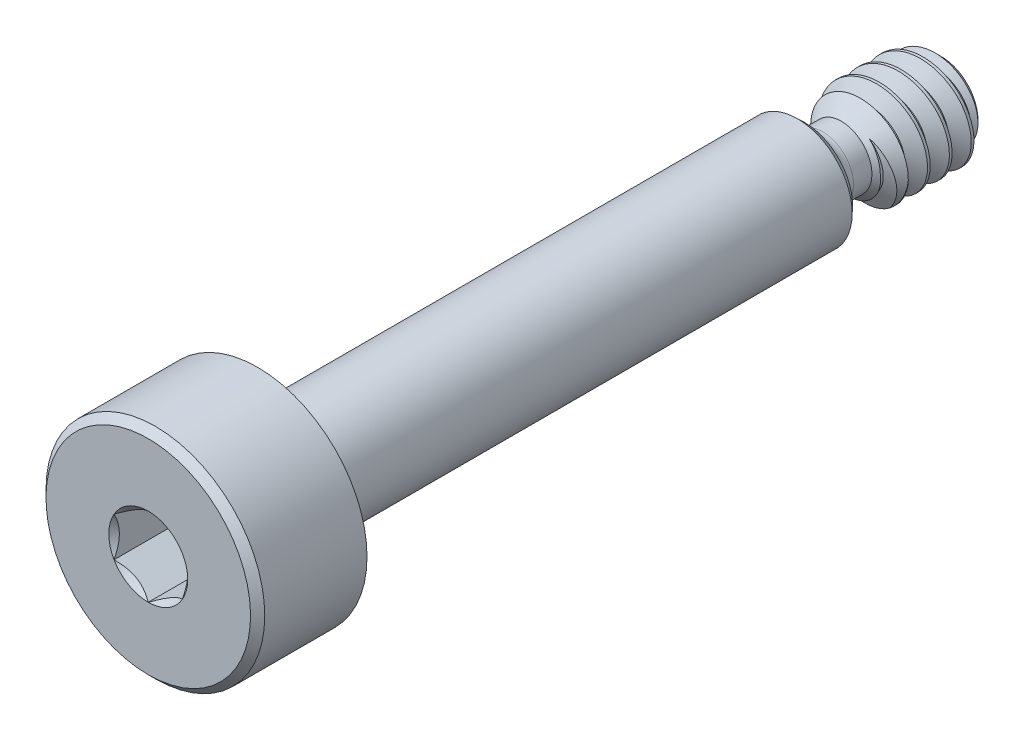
ISO-10303-21;
HEADER;
FILE_DESCRIPTION(('STEP AP214'),'2;1');
FILE_NAME('part.step','',(''),(''),'','','');
FILE_SCHEMA(('AUTOMOTIVE_DESIGN { 1 0 10303 214 1 1 1 1 }'));
ENDSEC;
DATA;
#1=APPLICATION_CONTEXT('core data for automotive mechanical design processes');
#2=APPLICATION_PROTOCOL_DEFINITION('international standard','automotive_design',2000,#1);
#3=PRODUCT_CONTEXT('',#1,'mechanical');
#4=PRODUCT('Part','Part','',(#3));
#5=PRODUCT_RELATED_PRODUCT_CATEGORY('part','',(#4));
#6=PRODUCT_DEFINITION_FORMATION('','',#4);
#7=PRODUCT_DEFINITION_CONTEXT('part definition',#1,'design');
#8=PRODUCT_DEFINITION('design','',#6,#7);
#9=PRODUCT_DEFINITION_SHAPE('','',#8);
#10=(LENGTH_UNIT() NAMED_UNIT(*) SI_UNIT(.MILLI.,.METRE.));
#11=(NAMED_UNIT(*) PLANE_ANGLE_UNIT() SI_UNIT($,.RADIAN.));
#12=(NAMED_UNIT(*) SI_UNIT($,.STERADIAN.) SOLID_ANGLE_UNIT());
#13=UNCERTAINTY_MEASURE_WITH_UNIT(LENGTH_MEASURE(1.E-05),#10,'distance_accuracy_value','');
#14=(GEOMETRIC_REPRESENTATION_CONTEXT(3) GLOBAL_UNCERTAINTY_ASSIGNED_CONTEXT((#13)) GLOBAL_UNIT_ASSIGNED_CONTEXT((#10,
#11,#12)) REPRESENTATION_CONTEXT('',''));
#15=CARTESIAN_POINT('',(0.,0.,0.));
#16=DIRECTION('',(0.,0.,1.));
#17=DIRECTION('',(1.,0.,0.));
#18=AXIS2_PLACEMENT_3D('',#15,#16,#17);
#19=CARTESIAN_POINT('',(0.,0.,-20.1168));
#20=DIRECTION('',(0.,0.,-1.));
#21=DIRECTION('',(0.,1.,0.));
#22=AXIS2_PLACEMENT_3D('',#19,#20,#21);
#23=CONICAL_SURFACE('',#22,0.888999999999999,0.785398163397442);
#24=CARTESIAN_POINT('',(0.,0.,-20.1168));
#25=DIRECTION('',(0.,0.,-1.));
#26=DIRECTION('',(0.,1.,0.));
#27=AXIS2_PLACEMENT_3D('',#24,#25,#26);
#28=CIRCLE('',#27,0.888999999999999);
#29=CARTESIAN_POINT('',(0.,0.888999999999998,-20.1168));
#30=VERTEX_POINT('',#29);
#31=EDGE_CURVE('E395',#30,#30,#28,.T.);
#32=ORIENTED_EDGE('',*,*,#31,.T.);
#33=EDGE_LOOP('',(#32));
#34=FACE_BOUND('',#33,.T.);
#35=CARTESIAN_POINT('',(0.865303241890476,-1.12892517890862,-20.6502));
#36=CARTESIAN_POINT('',(0.892899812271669,-1.0989524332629,-20.643196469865));
#37=CARTESIAN_POINT('',(0.919208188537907,-1.06779994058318,-20.6361776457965));
#38=CARTESIAN_POINT('',(0.96908060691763,-1.00336827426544,-20.6221660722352));
#39=CARTESIAN_POINT('',(0.992644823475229,-0.970089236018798,-20.6151733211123));
#40=CARTESIAN_POINT('',(1.03702407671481,-0.901386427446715,-20.6012194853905));
#41=CARTESIAN_POINT('',(1.05781804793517,-0.865948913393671,-20.5942589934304));
#42=CARTESIAN_POINT('',(1.09629562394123,-0.793395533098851,-20.5804639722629));
#43=CARTESIAN_POINT('',(1.11397852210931,-0.756279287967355,-20.5736294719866));
#44=CARTESIAN_POINT('',(1.14626060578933,-0.680419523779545,-20.5601759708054));
#45=CARTESIAN_POINT('',(1.16084176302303,-0.641667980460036,-20.5535584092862));
#46=CARTESIAN_POINT('',(1.18584315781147,-0.562930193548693,-20.5398412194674));
#47=CARTESIAN_POINT('',(1.19626517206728,-0.522944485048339,-20.5327417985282));
#48=CARTESIAN_POINT('',(1.21290721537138,-0.442351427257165,-20.5182209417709));
#49=CARTESIAN_POINT('',(1.21914455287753,-0.401747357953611,-20.510800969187));
#50=CARTESIAN_POINT('',(1.22740024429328,-0.320161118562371,-20.4956289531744));
#51=CARTESIAN_POINT('',(1.22941769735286,-0.279178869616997,-20.4878768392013));
#52=CARTESIAN_POINT('',(1.22923218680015,-0.203528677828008,-20.4733025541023));
#53=CARTESIAN_POINT('',(1.22762599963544,-0.168851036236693,-20.4665188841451));
#54=CARTESIAN_POINT('',(1.22139120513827,-0.0998220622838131,-20.452791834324));
#55=CARTESIAN_POINT('',(1.21676338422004,-0.0654706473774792,-20.4458484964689));
#56=CARTESIAN_POINT('',(1.198346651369,0.036893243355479,-20.4247939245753));
#57=CARTESIAN_POINT('',(1.18002472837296,0.104129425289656,-20.4104746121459));
#58=CARTESIAN_POINT('',(1.14423492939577,0.200925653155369,-20.3890657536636));
#59=CARTESIAN_POINT('',(1.1311101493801,0.232189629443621,-20.382018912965));
#60=CARTESIAN_POINT('',(1.10220948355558,0.293486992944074,-20.3679333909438));
#61=CARTESIAN_POINT('',(1.08643344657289,0.323520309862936,-20.3608947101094));
#62=CARTESIAN_POINT('',(1.05239595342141,0.382049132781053,-20.346908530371));
#63=CARTESIAN_POINT('',(1.03414125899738,0.410548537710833,-20.3399608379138));
#64=CARTESIAN_POINT('',(0.995225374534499,0.465886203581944,-20.3261745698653));
#65=CARTESIAN_POINT('',(0.974564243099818,0.492724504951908,-20.3193359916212));
#66=CARTESIAN_POINT('',(0.943481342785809,0.529780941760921,-20.3097533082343));
#67=CARTESIAN_POINT('',(0.933955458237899,0.54073230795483,-20.3069026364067));
#68=CARTESIAN_POINT('',(0.914429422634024,0.562181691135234,-20.3011252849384));
#69=CARTESIAN_POINT('',(0.904429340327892,0.572679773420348,-20.2981986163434));
#70=CARTESIAN_POINT('',(0.873755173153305,0.6034445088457,-20.2893039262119));
#71=CARTESIAN_POINT('',(0.852392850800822,0.622998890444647,-20.2832169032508));
#72=CARTESIAN_POINT('',(0.807929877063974,0.660115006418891,-20.2707283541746));
#73=CARTESIAN_POINT('',(0.784822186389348,0.677667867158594,-20.2643255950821));
#74=CARTESIAN_POINT('',(0.737097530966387,0.710576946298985,-20.251241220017));
#75=CARTESIAN_POINT('',(0.712477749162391,0.725928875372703,-20.2445590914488));
#76=CARTESIAN_POINT('',(0.687221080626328,0.740092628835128,-20.2377554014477));
#77=B_SPLINE_CURVE_WITH_KNOTS('',3,(#35,#36,#37,#38,#39,#40,#41,#42,#43,#44,#45,#46,#47,#48,#49,
#50,#51,#52,#53,#54,#55,#56,#57,#58,#59,#60,#61,#62,#63,#64,#65,#66,#67,#68,#69,#70,#71,#72,#73,
#74,#75,#76),.UNSPECIFIED.,.F.,.F.,(4,2,2,2,2,2,2,2,2,2,2,2,2,2,2,2,2,2,2,2,4),(0.,
0.12397980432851,0.247951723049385,0.372818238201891,0.497713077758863,0.623315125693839,
0.748863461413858,0.873889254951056,0.99894173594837,1.10492089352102,1.21087247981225,
1.42303487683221,1.52683839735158,1.6306478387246,1.73417957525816,1.83770879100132,
1.88207491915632,1.92643463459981,2.01508585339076,2.10411596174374,2.19331728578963),.UNSPECIFIED.);
#78=CARTESIAN_POINT('',(0.86530324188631,-1.12892517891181,-20.6502000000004));
#79=VERTEX_POINT('',#78);
#80=CARTESIAN_POINT('',(0.687221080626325,0.740092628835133,-20.2377554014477));
#81=VERTEX_POINT('',#80);
#82=EDGE_CURVE('E294',#79,#81,#77,.T.);
#83=ORIENTED_EDGE('',*,*,#82,.F.);
#84=CARTESIAN_POINT('',(0.,0.,-20.6502));
#85=DIRECTION('',(0.,0.,-1.));
#86=DIRECTION('',(0.,1.,0.));
#87=AXIS2_PLACEMENT_3D('',#84,#85,#86);
#88=CIRCLE('',#87,1.42240000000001);
#89=CARTESIAN_POINT('',(1.41212158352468,-0.170687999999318,-20.6501999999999));
#90=VERTEX_POINT('',#89);
#91=EDGE_CURVE('E140',#79,#90,#88,.F.);
#92=ORIENTED_EDGE('',*,*,#91,.T.);
#93=CARTESIAN_POINT('',(1.0095840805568,0.0273842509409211,-20.2377554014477));
#94=CARTESIAN_POINT('',(1.01224263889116,-0.00098878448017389,-20.2396433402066));
#95=CARTESIAN_POINT('',(1.01369810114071,-0.0294625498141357,-20.2415279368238));
#96=CARTESIAN_POINT('',(1.01419872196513,-0.0864267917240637,-20.2452775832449));
#97=CARTESIAN_POINT('',(1.01324436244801,-0.114917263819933,-20.2471426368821));
#98=CARTESIAN_POINT('',(1.00677721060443,-0.199944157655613,-20.2526766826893));
#99=CARTESIAN_POINT('',(0.997679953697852,-0.256248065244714,-20.2562986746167));
#100=CARTESIAN_POINT('',(0.97014592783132,-0.366595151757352,-20.2633440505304));
#101=CARTESIAN_POINT('',(0.951701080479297,-0.42063633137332,-20.2667672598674));
#102=CARTESIAN_POINT('',(0.917404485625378,-0.498752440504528,-20.2716271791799));
#103=CARTESIAN_POINT('',(0.904857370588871,-0.524315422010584,-20.2732022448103));
#104=CARTESIAN_POINT('',(0.877774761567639,-0.574369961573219,-20.2764099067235));
#105=CARTESIAN_POINT('',(0.863238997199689,-0.598861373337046,-20.2780425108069));
#106=CARTESIAN_POINT('',(0.831971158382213,-0.647086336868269,-20.2813927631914));
#107=CARTESIAN_POINT('',(0.815201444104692,-0.670795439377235,-20.283111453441));
#108=CARTESIAN_POINT('',(0.779811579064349,-0.716774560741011,-20.2865881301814));
#109=CARTESIAN_POINT('',(0.761191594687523,-0.739044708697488,-20.2883461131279));
#110=CARTESIAN_POINT('',(0.702718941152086,-0.803488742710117,-20.2936621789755));
#111=CARTESIAN_POINT('',(0.660235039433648,-0.843324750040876,-20.2972643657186));
#112=CARTESIAN_POINT('',(0.567355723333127,-0.917264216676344,-20.3046453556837));
#113=CARTESIAN_POINT('',(0.516688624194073,-0.951025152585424,-20.308424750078));
#114=CARTESIAN_POINT('',(0.410410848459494,-1.00954091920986,-20.3158920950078));
#115=CARTESIAN_POINT('',(0.354801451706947,-1.03429807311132,-20.3195800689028));
#116=CARTESIAN_POINT('',(0.240178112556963,-1.07411260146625,-20.3267723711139));
#117=CARTESIAN_POINT('',(0.18116458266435,-1.08917114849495,-20.3302767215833));
#118=CARTESIAN_POINT('',(0.0914166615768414,-1.10415994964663,-20.3353218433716));
#119=CARTESIAN_POINT('',(0.0612783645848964,-1.10788966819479,-20.3369692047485));
#120=CARTESIAN_POINT('',(0.000789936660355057,-1.11280626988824,-20.3401939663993));
#121=CARTESIAN_POINT('',(-0.0295602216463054,-1.11399281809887,-20.3417713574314));
#122=CARTESIAN_POINT('',(-0.121049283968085,-1.11394569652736,-20.3466417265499));
#123=CARTESIAN_POINT('',(-0.182219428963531,-1.10904064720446,-20.3500532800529));
#124=CARTESIAN_POINT('',(-0.30296117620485,-1.08951676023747,-20.3570028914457));
#125=CARTESIAN_POINT('',(-0.362532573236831,-1.07489668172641,-20.3605409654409));
#126=CARTESIAN_POINT('',(-0.481709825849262,-1.03529417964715,-20.3678635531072));
#127=CARTESIAN_POINT('',(-0.541145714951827,-1.00979741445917,-20.3716510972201));
#128=CARTESIAN_POINT('',(-0.654869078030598,-0.949181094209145,-20.3791718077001));
#129=CARTESIAN_POINT('',(-0.709157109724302,-0.914062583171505,-20.3829049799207));
#130=CARTESIAN_POINT('',(-0.811081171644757,-0.835161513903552,-20.3902172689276));
#131=CARTESIAN_POINT('',(-0.858717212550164,-0.791378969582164,-20.3937963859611));
#132=CARTESIAN_POINT('',(-0.924122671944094,-0.720223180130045,-20.3989889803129));
#133=CARTESIAN_POINT('',(-0.944925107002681,-0.69557748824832,-20.4006912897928));
#134=CARTESIAN_POINT('',(-0.984372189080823,-0.644599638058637,-20.4040070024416));
#135=CARTESIAN_POINT('',(-1.00301676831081,-0.618267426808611,-20.4056204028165));
#136=CARTESIAN_POINT('',(-1.03803677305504,-0.564224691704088,-20.4088325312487));
#137=CARTESIAN_POINT('',(-1.05441730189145,-0.53651746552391,-20.4104312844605));
#138=CARTESIAN_POINT('',(-1.08493910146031,-0.479908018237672,-20.4137055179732));
#139=CARTESIAN_POINT('',(-1.09908033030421,-0.451005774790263,-20.4153809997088));
#140=CARTESIAN_POINT('',(-1.13797882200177,-0.362738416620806,-20.4204691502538));
#141=CARTESIAN_POINT('',(-1.15922892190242,-0.301784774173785,-20.4239451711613));
#142=CARTESIAN_POINT('',(-1.19276042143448,-0.17356108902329,-20.4311948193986));
#143=CARTESIAN_POINT('',(-1.20442658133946,-0.106131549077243,-20.4349737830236));
#144=CARTESIAN_POINT('',(-1.21625814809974,0.0297320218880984,-20.4425162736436));
#145=CARTESIAN_POINT('',(-1.21642451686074,0.0981659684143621,-20.4462798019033));
#146=CARTESIAN_POINT('',(-1.205251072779,0.234105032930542,-20.4536844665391));
#147=CARTESIAN_POINT('',(-1.19390744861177,0.301609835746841,-20.4573255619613));
#148=CARTESIAN_POINT('',(-1.16002854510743,0.433801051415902,-20.4644138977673));
#149=CARTESIAN_POINT('',(-1.13749376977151,0.498487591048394,-20.4678611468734));
#150=CARTESIAN_POINT('',(-1.09579751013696,0.591857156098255,-20.4727516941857));
#151=CARTESIAN_POINT('',(-1.08059096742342,0.62235848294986,-20.4743345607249));
#152=CARTESIAN_POINT('',(-1.0477829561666,0.682051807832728,-20.4775550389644));
#153=CARTESIAN_POINT('',(-1.03018124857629,0.71124367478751,-20.4791926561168));
#154=CARTESIAN_POINT('',(-0.992700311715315,0.768138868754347,-20.4825243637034));
#155=CARTESIAN_POINT('',(-0.97282028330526,0.795841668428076,-20.4842184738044));
#156=CARTESIAN_POINT('',(-0.930921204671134,0.849563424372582,-20.4876465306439));
#157=CARTESIAN_POINT('',(-0.908902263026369,0.875582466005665,-20.4893804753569));
#158=CARTESIAN_POINT('',(-0.837696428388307,0.953193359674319,-20.4947882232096));
#159=CARTESIAN_POINT('',(-0.785079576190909,1.00171286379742,-20.4985143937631));
#160=CARTESIAN_POINT('',(-0.672533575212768,1.0892795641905,-20.5059844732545));
#161=CARTESIAN_POINT('',(-0.612605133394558,1.12832767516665,-20.5097283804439));
#162=CARTESIAN_POINT('',(-0.486464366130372,1.19624124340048,-20.5171697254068));
#163=CARTESIAN_POINT('',(-0.420196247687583,1.22500323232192,-20.5208663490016));
#164=CARTESIAN_POINT('',(-0.283732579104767,1.27097973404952,-20.5280802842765));
#165=CARTESIAN_POINT('',(-0.213537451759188,1.28819548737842,-20.5315976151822));
#166=CARTESIAN_POINT('',(-0.106927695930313,1.30498102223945,-20.5366597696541));
#167=CARTESIAN_POINT('',(-0.0711768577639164,1.30906991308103,-20.5383112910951));
#168=CARTESIAN_POINT('',(0.000546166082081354,1.31423740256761,-20.5415466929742));
#169=CARTESIAN_POINT('',(0.0365183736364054,1.31531569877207,-20.5431305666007));
#170=CARTESIAN_POINT('',(0.144396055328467,1.31424219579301,-20.548000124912));
#171=CARTESIAN_POINT('',(0.216297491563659,1.30778723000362,-20.5514051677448));
#172=CARTESIAN_POINT('',(0.360559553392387,1.28304191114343,-20.5584656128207));
#173=CARTESIAN_POINT('',(0.43285079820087,1.26435182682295,-20.562125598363));
#174=CARTESIAN_POINT('',(0.573344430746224,1.21530712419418,-20.5695045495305));
#175=CARTESIAN_POINT('',(0.641547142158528,1.18495343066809,-20.5732235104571));
#176=CARTESIAN_POINT('',(0.773221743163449,1.11271486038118,-20.5806813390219));
#177=CARTESIAN_POINT('',(0.836585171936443,1.07063050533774,-20.5844193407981));
#178=CARTESIAN_POINT('',(0.925581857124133,1.00003915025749,-20.5899098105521));
#179=CARTESIAN_POINT('',(0.954243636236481,0.975259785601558,-20.5917208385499));
#180=CARTESIAN_POINT('',(1.00940708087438,0.923345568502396,-20.5952938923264));
#181=CARTESIAN_POINT('',(1.03590708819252,0.896208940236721,-20.5970558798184));
#182=CARTESIAN_POINT('',(1.08649566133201,0.839836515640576,-20.6005228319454));
#183=CARTESIAN_POINT('',(1.1105872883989,0.810603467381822,-20.6022278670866));
#184=CARTESIAN_POINT('',(1.1562171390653,0.750182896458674,-20.6055451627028));
#185=CARTESIAN_POINT('',(1.17775420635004,0.718994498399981,-20.6071573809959));
#186=CARTESIAN_POINT('',(1.21820215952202,0.654949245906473,-20.6103854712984));
#187=CARTESIAN_POINT('',(1.23711221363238,0.622091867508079,-20.612001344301));
#188=CARTESIAN_POINT('',(1.2722405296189,0.554989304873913,-20.6153077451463));
#189=CARTESIAN_POINT('',(1.28845978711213,0.520744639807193,-20.6169982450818));
#190=CARTESIAN_POINT('',(1.31846811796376,0.450174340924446,-20.6204637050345));
#191=CARTESIAN_POINT('',(1.33218506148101,0.413817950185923,-20.6222397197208));
#192=CARTESIAN_POINT('',(1.35656782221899,0.340151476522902,-20.6258254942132));
#193=CARTESIAN_POINT('',(1.36723654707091,0.302842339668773,-20.6276352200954));
#194=CARTESIAN_POINT('',(1.39455648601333,0.189831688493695,-20.6330946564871));
#195=CARTESIAN_POINT('',(1.40657145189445,0.112929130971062,-20.6367804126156));
#196=CARTESIAN_POINT('',(1.41470988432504,0.00129639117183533,-20.6420889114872));
#197=CARTESIAN_POINT('',(1.4159524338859,-0.033147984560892,-20.6437211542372));
#198=CARTESIAN_POINT('',(1.41591841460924,-0.101981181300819,-20.6469718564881));
#199=CARTESIAN_POINT('',(1.41464585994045,-0.136370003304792,-20.6485903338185));
#200=CARTESIAN_POINT('',(1.41212158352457,-0.170688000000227,-20.6502));
#201=B_SPLINE_CURVE_WITH_KNOTS('',3,(#93,#94,#95,#96,#97,#98,#99,#100,#101,#102,#103,#104,#105,
#106,#107,#108,#109,#110,#111,#112,#113,#114,#115,#116,#117,#118,#119,#120,#121,#122,#123,#124,
#125,#126,#127,#128,#129,#130,#131,#132,#133,#134,#135,#136,#137,#138,#139,#140,#141,#142,#143,
#144,#145,#146,#147,#148,#149,#150,#151,#152,#153,#154,#155,#156,#157,#158,#159,#160,#161,#162,
#163,#164,#165,#166,#167,#168,#169,#170,#171,#172,#173,#174,#175,#176,#177,#178,#179,#180,#181,
#182,#183,#184,#185,#186,#187,#188,#189,#190,#191,#192,#193,#194,#195,#196,#197,#198,#199,#200),
.UNSPECIFIED.,.F.,.F.,(4,2,2,2,2,2,2,2,2,2,2,2,2,2,2,2,2,2,2,2,2,2,2,2,2,2,2,2,2,2,2,2,2,2,2,2,
2,2,2,2,2,2,2,2,2,2,2,2,2,2,2,2,2,4),(0.,0.0856297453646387,0.17124236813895,0.341835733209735,
0.512576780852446,0.598055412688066,0.683545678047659,0.770720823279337,0.857888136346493,
1.03212170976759,1.21426841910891,1.39636809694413,1.57844575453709,1.66958967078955,
1.76074558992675,1.94428212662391,2.12784211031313,2.32126017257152,2.51465725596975,
2.70805402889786,2.80484739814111,2.9016438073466,2.99821834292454,3.09479468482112,
3.28784871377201,3.49249633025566,3.69712682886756,3.90182510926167,4.10651417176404,
4.20877442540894,4.31104489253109,4.4133513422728,4.51565260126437,4.72957211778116,
4.94347096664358,5.15946462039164,5.37543506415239,5.48338911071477,5.59135400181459,
5.80717903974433,6.03043286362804,6.25366898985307,6.48096084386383,6.59464485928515,
6.70841527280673,6.82203918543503,6.93571433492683,7.04942539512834,7.16309428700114,
7.27964824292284,7.39609064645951,7.62859551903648,7.73204100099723,7.83532151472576),.UNSPECIFIED.);
#202=CARTESIAN_POINT('',(1.0095840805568,0.0273842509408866,-20.2377554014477));
#203=VERTEX_POINT('',#202);
#204=EDGE_CURVE('E285',#203,#90,#201,.T.);
#205=ORIENTED_EDGE('',*,*,#204,.F.);
#206=CARTESIAN_POINT('',(0.687221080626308,0.740092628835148,-20.2377554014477));
#207=CARTESIAN_POINT('',(0.706683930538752,0.722019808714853,-20.2377554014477));
#208=CARTESIAN_POINT('',(0.725425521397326,0.703186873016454,-20.2377554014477));
#209=CARTESIAN_POINT('',(0.761389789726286,0.664080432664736,-20.2377554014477));
#210=CARTESIAN_POINT('',(0.778610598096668,0.643805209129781,-20.2377554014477));
#211=CARTESIAN_POINT('',(0.828167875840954,0.580545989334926,-20.2377554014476));
#212=CARTESIAN_POINT('',(0.857967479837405,0.535529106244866,-20.2377554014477));
#213=CARTESIAN_POINT('',(0.910045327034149,0.441287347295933,-20.2377554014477));
#214=CARTESIAN_POINT('',(0.932313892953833,0.392057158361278,-20.2377554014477));
#215=CARTESIAN_POINT('',(0.968587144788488,0.291035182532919,-20.2377554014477));
#216=CARTESIAN_POINT('',(0.982649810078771,0.239264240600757,-20.2377554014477));
#217=CARTESIAN_POINT('',(1.00244211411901,0.134165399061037,-20.2377554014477));
#218=CARTESIAN_POINT('',(1.00817336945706,0.0808378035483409,-20.2377554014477));
#219=CARTESIAN_POINT('',(1.0095840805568,0.0273842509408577,-20.2377554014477));
#220=B_SPLINE_CURVE_WITH_KNOTS('',3,(#206,#207,#208,#209,#210,#211,#212,#213,#214,#215,#216,
#217,#218,#219),.UNSPECIFIED.,.F.,.F.,(4,2,2,2,2,2,4),(0.,0.0796365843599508,0.159369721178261,
0.320583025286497,0.482002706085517,0.642267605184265,0.802501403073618),.UNSPECIFIED.);
#221=EDGE_CURVE('E300',#81,#203,#220,.T.);
#222=ORIENTED_EDGE('',*,*,#221,.F.);
#223=EDGE_LOOP('',(#83,#92,#205,#222));
#224=FACE_BOUND('',#223,.T.);
#225=ADVANCED_FACE('F44',(#34,#224),#23,.T.);
#226=CARTESIAN_POINT('',(0.,-1.42240000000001,-23.01875));
#227=DIRECTION('',(0.,0.,-1.));
#228=DIRECTION('',(0.,1.,0.));
#229=AXIS2_PLACEMENT_3D('',#226,#227,#228);
#230=PLANE('',#229);
#231=CARTESIAN_POINT('',(0.,0.,-23.01875));
#232=DIRECTION('',(0.,0.,-1.));
#233=DIRECTION('',(0.,1.,0.));
#234=AXIS2_PLACEMENT_3D('',#231,#232,#233);
#235=CIRCLE('',#234,1.06680000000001);
#236=CARTESIAN_POINT('',(-0.958037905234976,-0.469282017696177,-23.01875));
#237=VERTEX_POINT('',#236);
#238=CARTESIAN_POINT('',(0.348253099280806,-1.00835609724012,-23.01875));
#239=VERTEX_POINT('',#238);
#240=EDGE_CURVE('E156',#237,#239,#235,.T.);
#241=ORIENTED_EDGE('',*,*,#240,.T.);
#242=CARTESIAN_POINT('',(1.0796016,-0.53258310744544,-23.01875));
#243=CARTESIAN_POINT('',(1.07056275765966,-0.54592091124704,-23.01875));
#244=CARTESIAN_POINT('',(1.0613032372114,-0.559111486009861,-23.01875));
#245=CARTESIAN_POINT('',(1.0422854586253,-0.58513054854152,-23.01875));
#246=CARTESIAN_POINT('',(1.03252712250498,-0.597958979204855,-23.01875));
#247=CARTESIAN_POINT('',(1.00242363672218,-0.635791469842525,-23.01875));
#248=CARTESIAN_POINT('',(0.981248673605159,-0.660144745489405,-23.01875));
#249=CARTESIAN_POINT('',(0.936847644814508,-0.706876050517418,-23.01875));
#250=CARTESIAN_POINT('',(0.913622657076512,-0.729255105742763,-23.01875));
#251=CARTESIAN_POINT('',(0.865302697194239,-0.771875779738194,-23.01875));
#252=CARTESIAN_POINT('',(0.840207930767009,-0.792117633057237,-23.01875));
#253=CARTESIAN_POINT('',(0.76301250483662,-0.84892793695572,-23.01875));
#254=CARTESIAN_POINT('',(0.708417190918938,-0.882193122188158,-23.01875));
#255=CARTESIAN_POINT('',(0.594291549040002,-0.938663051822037,-23.01875));
#256=CARTESIAN_POINT('',(0.534762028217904,-0.961869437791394,-23.01875));
#257=CARTESIAN_POINT('',(0.414819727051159,-0.996868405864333,-23.01875));
#258=CARTESIAN_POINT('',(0.354519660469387,-1.00904883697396,-23.01875));
#259=CARTESIAN_POINT('',(0.232772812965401,-1.02305696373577,-23.01875));
#260=CARTESIAN_POINT('',(0.171327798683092,-1.0248994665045,-23.01875));
#261=CARTESIAN_POINT('',(0.0917692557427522,-1.02058354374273,-23.01875));
#262=CARTESIAN_POINT('',(0.0733240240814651,-1.01910920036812,-23.01875));
#263=CARTESIAN_POINT('',(0.0365642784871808,-1.01522806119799,-23.01875));
#264=CARTESIAN_POINT('',(0.0182495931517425,-1.01282288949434,-23.01875));
#265=CARTESIAN_POINT('',(0.,-1.00995540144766,-23.01875));
#266=B_SPLINE_CURVE_WITH_KNOTS('',3,(#242,#243,#244,#245,#246,#247,#248,#249,#250,#251,#252,
#253,#254,#255,#256,#257,#258,#259,#260,#261,#262,#263,#264,#265),.UNSPECIFIED.,.F.,.F.,(4,2,2,
2,2,2,2,2,2,2,2,4),(0.,0.0483359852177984,0.0966795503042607,0.193359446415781,0.28998880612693,
0.386607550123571,0.577343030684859,0.768047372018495,0.951748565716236,1.13518657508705,
1.19068252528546,1.24608208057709),.UNSPECIFIED.);
#267=CARTESIAN_POINT('',(0.,-1.00995540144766,-23.01875));
#268=VERTEX_POINT('',#267);
#269=EDGE_CURVE('E149',#239,#268,#266,.T.);
#270=ORIENTED_EDGE('',*,*,#269,.T.);
#271=CARTESIAN_POINT('',(0.,-1.00995540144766,-23.01875));
#272=CARTESIAN_POINT('',(-0.0265587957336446,-1.00995518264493,-23.01875));
#273=CARTESIAN_POINT('',(-0.0531063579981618,-1.00890717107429,-23.01875));
#274=CARTESIAN_POINT('',(-0.106070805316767,-1.00472196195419,-23.01875));
#275=CARTESIAN_POINT('',(-0.132487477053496,-1.00158206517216,-23.01875));
#276=CARTESIAN_POINT('',(-0.211851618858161,-0.988946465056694,-23.01875));
#277=CARTESIAN_POINT('',(-0.264323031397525,-0.976234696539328,-23.01875));
#278=CARTESIAN_POINT('',(-0.366612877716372,-0.942608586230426,-23.01875));
#279=CARTESIAN_POINT('',(-0.41642817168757,-0.921684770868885,-23.01875));
#280=CARTESIAN_POINT('',(-0.508912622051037,-0.873808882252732,-23.01875));
#281=CARTESIAN_POINT('',(-0.551836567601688,-0.847348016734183,-23.01875));
#282=CARTESIAN_POINT('',(-0.63326034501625,-0.78837351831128,-23.01875));
#283=CARTESIAN_POINT('',(-0.671762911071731,-0.755863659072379,-23.01875));
#284=CARTESIAN_POINT('',(-0.707604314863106,-0.720628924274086,-23.01875));
#285=B_SPLINE_CURVE_WITH_KNOTS('',3,(#271,#272,#273,#274,#275,#276,#277,#278,#279,#280,#281,
#282,#283,#284),.UNSPECIFIED.,.F.,.F.,(4,2,2,2,2,2,4),(0.,0.0796333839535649,0.159369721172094,
0.320592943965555,0.482002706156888,0.632719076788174,0.783341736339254),.UNSPECIFIED.);
#286=CARTESIAN_POINT('',(-0.707604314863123,-0.720628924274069,-23.01875));
#287=VERTEX_POINT('',#286);
#288=EDGE_CURVE('E12',#268,#287,#285,.T.);
#289=ORIENTED_EDGE('',*,*,#288,.T.);
#290=CARTESIAN_POINT('',(-0.707604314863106,-0.720628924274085,-23.01875));
#291=CARTESIAN_POINT('',(-0.726310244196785,-0.707769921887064,-23.01875));
#292=CARTESIAN_POINT('',(-0.744555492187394,-0.694241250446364,-23.01875));
#293=CARTESIAN_POINT('',(-0.780028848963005,-0.665929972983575,-23.01875));
#294=CARTESIAN_POINT('',(-0.797257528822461,-0.651148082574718,-23.01875));
#295=CARTESIAN_POINT('',(-0.830316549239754,-0.620683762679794,-23.01875));
#296=CARTESIAN_POINT('',(-0.84616678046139,-0.605022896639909,-23.01875));
#297=CARTESIAN_POINT('',(-0.876743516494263,-0.572632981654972,-23.01875));
#298=CARTESIAN_POINT('',(-0.891469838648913,-0.555903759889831,-23.01875));
#299=CARTESIAN_POINT('',(-0.914561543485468,-0.527775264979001,-23.01875));
#300=CARTESIAN_POINT('',(-0.923282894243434,-0.516665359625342,-23.01875));
#301=CARTESIAN_POINT('',(-0.940319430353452,-0.494137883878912,-23.01875));
#302=CARTESIAN_POINT('',(-0.948634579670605,-0.48272028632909,-23.01875));
#303=CARTESIAN_POINT('',(-0.972934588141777,-0.448004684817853,-23.01875));
#304=CARTESIAN_POINT('',(-0.98827102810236,-0.424247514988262,-23.01875));
#305=CARTESIAN_POINT('',(-1.01748059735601,-0.375066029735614,-23.01875));
#306=CARTESIAN_POINT('',(-1.03130895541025,-0.349615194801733,-23.01875));
#307=CARTESIAN_POINT('',(-1.05696825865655,-0.297753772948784,-23.01875));
#308=CARTESIAN_POINT('',(-1.06880094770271,-0.271344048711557,-23.01875));
#309=CARTESIAN_POINT('',(-1.0796016,-0.244516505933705,-23.01875));
#310=B_SPLINE_CURVE_WITH_KNOTS('',3,(#290,#291,#292,#293,#294,#295,#296,#297,#298,#299,#300,
#301,#302,#303,#304,#305,#306,#307,#308,#309),.UNSPECIFIED.,.F.,.F.,(4,2,2,2,2,2,2,2,2,4),(0.,
0.0680837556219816,0.136128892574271,0.202922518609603,0.269726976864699,0.31208922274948,
0.354455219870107,0.439201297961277,0.526012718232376,0.612747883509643),.UNSPECIFIED.);
#311=EDGE_CURVE('E337',#287,#237,#310,.T.);
#312=ORIENTED_EDGE('',*,*,#311,.T.);
#313=EDGE_LOOP('',(#241,#270,#289,#312));
#314=FACE_BOUND('',#313,.T.);
#315=ADVANCED_FACE('F268',(#314),#230,.T.);
#316=CARTESIAN_POINT('',(0.,0.,-23.01875));
#317=DIRECTION('',(0.,0.,-1.));
#318=DIRECTION('',(0.,1.,0.));
#319=AXIS2_PLACEMENT_3D('',#316,#317,#318);
#320=CYLINDRICAL_SURFACE('',#319,1.42240000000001);
#321=CARTESIAN_POINT('',(0.,1.42240000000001,-23.01875));
#322=CARTESIAN_POINT('',(-0.821223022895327,1.42240000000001,-22.9658333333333));
#323=CARTESIAN_POINT('',(-1.23183453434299,0.711200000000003,-22.9129166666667));
#324=CARTESIAN_POINT('',(-1.64244604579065,0.,-22.86));
#325=CARTESIAN_POINT('',(-1.23183453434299,-0.711200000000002,-22.8070833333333));
#326=CARTESIAN_POINT('',(-0.821223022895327,-1.42240000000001,-22.7541666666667));
#327=CARTESIAN_POINT('',(0.,-1.42240000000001,-22.70125));
#328=CARTESIAN_POINT('',(0.821223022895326,-1.42240000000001,-22.6483333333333));
#329=CARTESIAN_POINT('',(1.23183453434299,-0.711200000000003,-22.5954166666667));
#330=CARTESIAN_POINT('',(1.64244604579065,0.,-22.5425));
#331=CARTESIAN_POINT('',(1.23183453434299,0.711200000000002,-22.4895833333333));
#332=CARTESIAN_POINT('',(0.821223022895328,1.4224,-22.4366666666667));
#333=CARTESIAN_POINT('',(0.,1.42240000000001,-22.38375));
#334=CARTESIAN_POINT('',(-0.821223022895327,1.42240000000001,-22.3308333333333));
#335=CARTESIAN_POINT('',(-1.23183453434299,0.711200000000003,-22.2779166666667));
#336=CARTESIAN_POINT('',(-1.64244604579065,0.,-22.225));
#337=CARTESIAN_POINT('',(-1.23183453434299,-0.711200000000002,-22.1720833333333));
#338=CARTESIAN_POINT('',(-0.821223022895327,-1.42240000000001,-22.1191666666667));
#339=CARTESIAN_POINT('',(0.,-1.42240000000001,-22.06625));
#340=CARTESIAN_POINT('',(0.821223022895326,-1.42240000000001,-22.0133333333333));
#341=CARTESIAN_POINT('',(1.23183453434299,-0.711200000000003,-21.9604166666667));
#342=CARTESIAN_POINT('',(1.64244604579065,0.,-21.9075));
#343=CARTESIAN_POINT('',(1.23183453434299,0.711200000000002,-21.8545833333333));
#344=CARTESIAN_POINT('',(0.821223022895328,1.4224,-21.8016666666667));
#345=CARTESIAN_POINT('',(0.,1.42240000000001,-21.74875));
#346=CARTESIAN_POINT('',(-0.821223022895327,1.42240000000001,-21.6958333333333));
#347=CARTESIAN_POINT('',(-1.23183453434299,0.711200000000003,-21.6429166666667));
#348=CARTESIAN_POINT('',(-1.64244604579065,0.,-21.59));
#349=CARTESIAN_POINT('',(-1.23183453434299,-0.711200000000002,-21.5370833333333));
#350=CARTESIAN_POINT('',(-0.821223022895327,-1.42240000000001,-21.4841666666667));
#351=CARTESIAN_POINT('',(0.,-1.42240000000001,-21.43125));
#352=CARTESIAN_POINT('',(0.821223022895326,-1.42240000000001,-21.3783333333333));
#353=CARTESIAN_POINT('',(1.23183453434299,-0.711200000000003,-21.3254166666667));
#354=CARTESIAN_POINT('',(1.64244604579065,0.,-21.2725));
#355=CARTESIAN_POINT('',(1.23183453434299,0.711200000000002,-21.2195833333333));
#356=CARTESIAN_POINT('',(0.821223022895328,1.4224,-21.1666666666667));
#357=CARTESIAN_POINT('',(0.,1.42240000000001,-21.11375));
#358=CARTESIAN_POINT('',(-0.821223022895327,1.42240000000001,-21.0608333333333));
#359=CARTESIAN_POINT('',(-1.23183453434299,0.711200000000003,-21.0079166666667));
#360=CARTESIAN_POINT('',(-1.64244604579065,0.,-20.955));
#361=CARTESIAN_POINT('',(-1.23183453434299,-0.711200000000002,-20.9020833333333));
#362=CARTESIAN_POINT('',(-0.821223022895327,-1.42240000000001,-20.8491666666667));
#363=CARTESIAN_POINT('',(0.,-1.42240000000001,-20.79625));
#364=CARTESIAN_POINT('',(0.821223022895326,-1.42240000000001,-20.7433333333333));
#365=CARTESIAN_POINT('',(1.23183453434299,-0.711200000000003,-20.6904166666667));
#366=CARTESIAN_POINT('',(1.64244604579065,0.,-20.6375));
#367=CARTESIAN_POINT('',(1.23183453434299,0.711200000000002,-20.5845833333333));
#368=CARTESIAN_POINT('',(0.821223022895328,1.4224,-20.5316666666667));
#369=CARTESIAN_POINT('',(0.,1.42240000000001,-20.47875));
#370=CARTESIAN_POINT('',(-0.821223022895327,1.42240000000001,-20.4258333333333));
#371=CARTESIAN_POINT('',(-1.23183453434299,0.711200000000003,-20.3729166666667));
#372=CARTESIAN_POINT('',(-1.64244604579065,0.,-20.32));
#373=CARTESIAN_POINT('',(-1.23183453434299,-0.711200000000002,-20.2670833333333));
#374=CARTESIAN_POINT('',(-0.821223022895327,-1.42240000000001,-20.2141666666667));
#375=CARTESIAN_POINT('',(0.,-1.42240000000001,-20.16125));
#376=CARTESIAN_POINT('',(0.821223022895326,-1.42240000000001,-20.1083333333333));
#377=CARTESIAN_POINT('',(1.23183453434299,-0.711200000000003,-20.0554166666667));
#378=CARTESIAN_POINT('',(1.64244604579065,0.,-20.0025));
#379=CARTESIAN_POINT('',(1.23183453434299,0.711200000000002,-19.9495833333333));
#380=CARTESIAN_POINT('',(0.821223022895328,1.4224,-19.8966666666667));
#381=CARTESIAN_POINT('',(0.,1.42240000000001,-19.84375));
#382=CARTESIAN_POINT('',(-0.821223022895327,1.42240000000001,-19.7908333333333));
#383=CARTESIAN_POINT('',(-1.23183453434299,0.711200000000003,-19.7379166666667));
#384=CARTESIAN_POINT('',(-1.64244604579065,0.,-19.685));
#385=CARTESIAN_POINT('',(-1.23183453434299,-0.711200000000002,-19.6320833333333));
#386=CARTESIAN_POINT('',(-0.821223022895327,-1.42240000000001,-19.5791666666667));
#387=CARTESIAN_POINT('',(0.,-1.42240000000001,-19.52625));
#388=CARTESIAN_POINT('',(0.821223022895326,-1.42240000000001,-19.4733333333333));
#389=CARTESIAN_POINT('',(1.23183453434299,-0.711200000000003,-19.4204166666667));
#390=CARTESIAN_POINT('',(1.64244604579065,0.,-19.3675));
#391=CARTESIAN_POINT('',(1.23183453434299,0.711200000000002,-19.3145833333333));
#392=CARTESIAN_POINT('',(0.821223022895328,1.4224,-19.2616666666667));
#393=CARTESIAN_POINT('',(0.,1.42240000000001,-19.20875));
#394=CARTESIAN_POINT('',(-0.821223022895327,1.42240000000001,-19.1558333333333));
#395=CARTESIAN_POINT('',(-1.23183453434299,0.711200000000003,-19.1029166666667));
#396=CARTESIAN_POINT('',(-1.64244604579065,0.,-19.05));
#397=CARTESIAN_POINT('',(-1.23183453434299,-0.711200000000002,-18.9970833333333));
#398=CARTESIAN_POINT('',(-0.821223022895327,-1.42240000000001,-18.9441666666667));
#399=CARTESIAN_POINT('',(0.,-1.42240000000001,-18.89125));
#400=CARTESIAN_POINT('',(0.821223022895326,-1.42240000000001,-18.8383333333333));
#401=CARTESIAN_POINT('',(1.23183453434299,-0.711200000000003,-18.7854166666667));
#402=CARTESIAN_POINT('',(1.64244604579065,0.,-18.7325));
#403=CARTESIAN_POINT('',(1.23183453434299,0.711200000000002,-18.6795833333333));
#404=CARTESIAN_POINT('',(0.821223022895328,1.4224,-18.6266666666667));
#405=CARTESIAN_POINT('',(0.,1.42240000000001,-18.57375));
#406=CARTESIAN_POINT('',(-0.821223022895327,1.42240000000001,-18.5208333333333));
#407=CARTESIAN_POINT('',(-1.23183453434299,0.711200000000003,-18.4679166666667));
#408=CARTESIAN_POINT('',(-1.42240000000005,0.381130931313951,-18.443357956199));
#409=CARTESIAN_POINT('',(-1.42240000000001,-1.70413809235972E-13,-18.415));
#410=(BOUNDED_CURVE() B_SPLINE_CURVE(2,(#321,#322,#323,#324,#325,#326,#327,#328,#329,#330,#331,
#332,#333,#334,#335,#336,#337,#338,#339,#340,#341,#342,#343,#344,#345,#346,#347,#348,#349,#350,
#351,#352,#353,#354,#355,#356,#357,#358,#359,#360,#361,#362,#363,#364,#365,#366,#367,#368,#369,
#370,#371,#372,#373,#374,#375,#376,#377,#378,#379,#380,#381,#382,#383,#384,#385,#386,#387,#388,
#389,#390,#391,#392,#393,#394,#395,#396,#397,#398,#399,#400,#401,#402,#403,#404,#405,#406,#407,
#408,#409),.UNSPECIFIED.,.F.,.F.) B_SPLINE_CURVE_WITH_KNOTS((3,2,2,2,2,2,2,2,2,2,2,2,2,2,2,2,2,
2,2,2,2,2,2,2,2,2,2,2,2,2,2,2,2,2,2,2,2,2,2,2,2,2,2,2,3),(0.,0.0208333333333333,
0.0416666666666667,0.0625,0.0833333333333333,0.104166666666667,0.125,0.145833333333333,
0.166666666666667,0.1875,0.208333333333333,0.229166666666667,0.25,0.270833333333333,
0.291666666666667,0.3125,0.333333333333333,0.354166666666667,0.375,0.395833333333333,
0.416666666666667,0.4375,0.458333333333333,0.479166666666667,0.5,0.520833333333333,
0.541666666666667,0.5625,0.583333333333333,0.604166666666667,0.625,0.645833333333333,
0.666666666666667,0.6875,0.708333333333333,0.729166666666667,0.75,0.770833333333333,
0.791666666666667,0.8125,0.833333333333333,0.854166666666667,0.875,0.895833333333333,
0.906250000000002),
.UNSPECIFIED.) CURVE() GEOMETRIC_REPRESENTATION_ITEM() RATIONAL_B_SPLINE_CURVE((1.,
0.866025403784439,1.,0.866025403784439,1.,0.866025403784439,1.,0.866025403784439,1.,
0.866025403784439,1.,0.866025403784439,1.,0.866025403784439,1.,0.866025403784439,1.,
0.866025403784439,1.,0.866025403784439,1.,0.866025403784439,1.,0.866025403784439,1.,
0.866025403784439,1.,0.866025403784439,1.,0.866025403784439,1.,0.866025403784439,1.,
0.866025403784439,1.,0.866025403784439,1.,0.866025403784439,1.,0.866025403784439,1.,
0.866025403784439,1.,0.866025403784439,1.,0.866025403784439,1.,0.866025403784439,1.,
0.866025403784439,1.,0.866025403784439,1.,0.866025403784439,1.,0.866025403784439,1.,
0.866025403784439,1.,0.866025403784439,1.,0.866025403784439,1.,0.866025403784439,1.,
0.866025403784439,1.,0.866025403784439,1.,0.866025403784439,1.,0.866025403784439,1.,
0.866025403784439,1.,0.866025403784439,1.,0.866025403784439,1.,0.866025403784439,1.,
0.866025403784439,1.,0.866025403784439,1.,0.866025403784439,1.,0.933012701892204,0.933012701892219)) REPRESENTATION_ITEM(''));
#411=CARTESIAN_POINT('',(0.531738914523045,-1.31927081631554,-22.66315));
#412=VERTEX_POINT('',#411);
#413=EDGE_CURVE('E65',#412,#90,#410,.T.);
#414=ORIENTED_EDGE('',*,*,#413,.T.);
#415=ORIENTED_EDGE('',*,*,#91,.F.);
#416=CARTESIAN_POINT('',(0.,1.42240000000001,-23.574375));
#417=CARTESIAN_POINT('',(-0.821223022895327,1.42240000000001,-23.5214583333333));
#418=CARTESIAN_POINT('',(-1.23183453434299,0.711200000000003,-23.4685416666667));
#419=CARTESIAN_POINT('',(-1.64244604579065,0.,-23.415625));
#420=CARTESIAN_POINT('',(-1.23183453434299,-0.711200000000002,-23.3627083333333));
#421=CARTESIAN_POINT('',(-0.821223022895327,-1.42240000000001,-23.3097916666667));
#422=CARTESIAN_POINT('',(0.,-1.42240000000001,-23.256875));
#423=CARTESIAN_POINT('',(0.821223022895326,-1.42240000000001,-23.2039583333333));
#424=CARTESIAN_POINT('',(1.23183453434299,-0.711200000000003,-23.1510416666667));
#425=CARTESIAN_POINT('',(1.64244604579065,0.,-23.098125));
#426=CARTESIAN_POINT('',(1.23183453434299,0.711200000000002,-23.0452083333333));
#427=CARTESIAN_POINT('',(0.821223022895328,1.4224,-22.9922916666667));
#428=CARTESIAN_POINT('',(0.,1.42240000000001,-22.939375));
#429=CARTESIAN_POINT('',(-0.821223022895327,1.42240000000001,-22.8864583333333));
#430=CARTESIAN_POINT('',(-1.23183453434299,0.711200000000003,-22.8335416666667));
#431=CARTESIAN_POINT('',(-1.64244604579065,0.,-22.780625));
#432=CARTESIAN_POINT('',(-1.23183453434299,-0.711200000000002,-22.7277083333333));
#433=CARTESIAN_POINT('',(-0.821223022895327,-1.42240000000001,-22.6747916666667));
#434=CARTESIAN_POINT('',(0.,-1.42240000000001,-22.621875));
#435=CARTESIAN_POINT('',(0.821223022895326,-1.42240000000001,-22.5689583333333));
#436=CARTESIAN_POINT('',(1.23183453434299,-0.711200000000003,-22.5160416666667));
#437=CARTESIAN_POINT('',(1.64244604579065,0.,-22.463125));
#438=CARTESIAN_POINT('',(1.23183453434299,0.711200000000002,-22.4102083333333));
#439=CARTESIAN_POINT('',(0.821223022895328,1.4224,-22.3572916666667));
#440=CARTESIAN_POINT('',(0.,1.42240000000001,-22.304375));
#441=CARTESIAN_POINT('',(-0.821223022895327,1.42240000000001,-22.2514583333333));
#442=CARTESIAN_POINT('',(-1.23183453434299,0.711200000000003,-22.1985416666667));
#443=CARTESIAN_POINT('',(-1.64244604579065,0.,-22.145625));
#444=CARTESIAN_POINT('',(-1.23183453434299,-0.711200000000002,-22.0927083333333));
#445=CARTESIAN_POINT('',(-0.821223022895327,-1.42240000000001,-22.0397916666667));
#446=CARTESIAN_POINT('',(0.,-1.42240000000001,-21.986875));
#447=CARTESIAN_POINT('',(0.821223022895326,-1.42240000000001,-21.9339583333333));
#448=CARTESIAN_POINT('',(1.23183453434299,-0.711200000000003,-21.8810416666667));
#449=CARTESIAN_POINT('',(1.64244604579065,0.,-21.828125));
#450=CARTESIAN_POINT('',(1.23183453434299,0.711200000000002,-21.7752083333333));
#451=CARTESIAN_POINT('',(0.821223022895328,1.4224,-21.7222916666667));
#452=CARTESIAN_POINT('',(0.,1.42240000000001,-21.669375));
#453=CARTESIAN_POINT('',(-0.821223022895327,1.42240000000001,-21.6164583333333));
#454=CARTESIAN_POINT('',(-1.23183453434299,0.711200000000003,-21.5635416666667));
#455=CARTESIAN_POINT('',(-1.64244604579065,0.,-21.510625));
#456=CARTESIAN_POINT('',(-1.23183453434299,-0.711200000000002,-21.4577083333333));
#457=CARTESIAN_POINT('',(-0.821223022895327,-1.42240000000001,-21.4047916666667));
#458=CARTESIAN_POINT('',(0.,-1.42240000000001,-21.351875));
#459=CARTESIAN_POINT('',(0.821223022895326,-1.42240000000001,-21.2989583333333));
#460=CARTESIAN_POINT('',(1.23183453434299,-0.711200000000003,-21.2460416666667));
#461=CARTESIAN_POINT('',(1.64244604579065,0.,-21.193125));
#462=CARTESIAN_POINT('',(1.23183453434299,0.711200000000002,-21.1402083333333));
#463=CARTESIAN_POINT('',(0.821223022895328,1.4224,-21.0872916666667));
#464=CARTESIAN_POINT('',(0.,1.42240000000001,-21.034375));
#465=CARTESIAN_POINT('',(-0.821223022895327,1.42240000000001,-20.9814583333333));
#466=CARTESIAN_POINT('',(-1.23183453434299,0.711200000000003,-20.9285416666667));
#467=CARTESIAN_POINT('',(-1.64244604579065,0.,-20.875625));
#468=CARTESIAN_POINT('',(-1.23183453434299,-0.711200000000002,-20.8227083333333));
#469=CARTESIAN_POINT('',(-0.821223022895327,-1.42240000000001,-20.7697916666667));
#470=CARTESIAN_POINT('',(0.,-1.42240000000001,-20.716875));
#471=CARTESIAN_POINT('',(0.821223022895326,-1.42240000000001,-20.6639583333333));
#472=CARTESIAN_POINT('',(1.23183453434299,-0.711200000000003,-20.6110416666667));
#473=CARTESIAN_POINT('',(1.64244604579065,0.,-20.558125));
#474=CARTESIAN_POINT('',(1.23183453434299,0.711200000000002,-20.5052083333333));
#475=CARTESIAN_POINT('',(0.821223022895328,1.4224,-20.4522916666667));
#476=CARTESIAN_POINT('',(0.,1.42240000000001,-20.399375));
#477=CARTESIAN_POINT('',(-0.821223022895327,1.42240000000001,-20.3464583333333));
#478=CARTESIAN_POINT('',(-1.23183453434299,0.711200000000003,-20.2935416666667));
#479=CARTESIAN_POINT('',(-1.64244604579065,0.,-20.240625));
#480=CARTESIAN_POINT('',(-1.23183453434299,-0.711200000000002,-20.1877083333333));
#481=CARTESIAN_POINT('',(-0.821223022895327,-1.42240000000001,-20.1347916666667));
#482=CARTESIAN_POINT('',(0.,-1.42240000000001,-20.081875));
#483=CARTESIAN_POINT('',(0.821223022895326,-1.42240000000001,-20.0289583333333));
#484=CARTESIAN_POINT('',(1.23183453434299,-0.711200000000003,-19.9760416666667));
#485=CARTESIAN_POINT('',(1.64244604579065,0.,-19.923125));
#486=CARTESIAN_POINT('',(1.23183453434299,0.711200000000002,-19.8702083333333));
#487=CARTESIAN_POINT('',(0.821223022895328,1.4224,-19.8172916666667));
#488=CARTESIAN_POINT('',(0.,1.42240000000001,-19.764375));
#489=CARTESIAN_POINT('',(-0.821223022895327,1.42240000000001,-19.7114583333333));
#490=CARTESIAN_POINT('',(-1.23183453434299,0.711200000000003,-19.6585416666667));
#491=CARTESIAN_POINT('',(-1.64244604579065,0.,-19.605625));
#492=CARTESIAN_POINT('',(-1.23183453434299,-0.711200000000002,-19.5527083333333));
#493=CARTESIAN_POINT('',(-0.821223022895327,-1.42240000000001,-19.4997916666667));
#494=CARTESIAN_POINT('',(0.,-1.42240000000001,-19.446875));
#495=CARTESIAN_POINT('',(0.821223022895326,-1.42240000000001,-19.3939583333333));
#496=CARTESIAN_POINT('',(1.23183453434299,-0.711200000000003,-19.3410416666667));
#497=CARTESIAN_POINT('',(1.64244604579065,0.,-19.288125));
#498=CARTESIAN_POINT('',(1.23183453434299,0.711200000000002,-19.2352083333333));
#499=CARTESIAN_POINT('',(0.821223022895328,1.4224,-19.1822916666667));
#500=CARTESIAN_POINT('',(0.,1.42240000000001,-19.129375));
#501=CARTESIAN_POINT('',(-0.821223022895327,1.42240000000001,-19.0764583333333));
#502=CARTESIAN_POINT('',(-1.23183453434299,0.711200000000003,-19.0235416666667));
#503=CARTESIAN_POINT('',(-1.42240000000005,0.381130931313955,-18.998982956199));
#504=CARTESIAN_POINT('',(-1.42240000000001,-1.62279498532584E-13,-18.970625));
#505=(BOUNDED_CURVE() B_SPLINE_CURVE(2,(#416,#417,#418,#419,#420,#421,#422,#423,#424,#425,#426,
#427,#428,#429,#430,#431,#432,#433,#434,#435,#436,#437,#438,#439,#440,#441,#442,#443,#444,#445,
#446,#447,#448,#449,#450,#451,#452,#453,#454,#455,#456,#457,#458,#459,#460,#461,#462,#463,#464,
#465,#466,#467,#468,#469,#470,#471,#472,#473,#474,#475,#476,#477,#478,#479,#480,#481,#482,#483,
#484,#485,#486,#487,#488,#489,#490,#491,#492,#493,#494,#495,#496,#497,#498,#499,#500,#501,#502,
#503,#504),.UNSPECIFIED.,.F.,.F.) B_SPLINE_CURVE_WITH_KNOTS((3,2,2,2,2,2,2,2,2,2,2,2,2,2,2,2,2,
2,2,2,2,2,2,2,2,2,2,2,2,2,2,2,2,2,2,2,2,2,2,2,2,2,2,2,3),(0.,0.0208333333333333,
0.0416666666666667,0.0625,0.0833333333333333,0.104166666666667,0.125,0.145833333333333,
0.166666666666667,0.1875,0.208333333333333,0.229166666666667,0.25,0.270833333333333,
0.291666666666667,0.3125,0.333333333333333,0.354166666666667,0.375,0.395833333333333,
0.416666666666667,0.4375,0.458333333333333,0.479166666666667,0.5,0.520833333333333,
0.541666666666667,0.5625,0.583333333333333,0.604166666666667,0.625,0.645833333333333,
0.666666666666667,0.6875,0.708333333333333,0.729166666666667,0.75,0.770833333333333,
0.791666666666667,0.8125,0.833333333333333,0.854166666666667,0.875,0.895833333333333,
0.906250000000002),
.UNSPECIFIED.) CURVE() GEOMETRIC_REPRESENTATION_ITEM() RATIONAL_B_SPLINE_CURVE((1.,
0.866025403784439,1.,0.866025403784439,1.,0.866025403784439,1.,0.866025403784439,1.,
0.866025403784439,1.,0.866025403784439,1.,0.866025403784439,1.,0.866025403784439,1.,
0.866025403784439,1.,0.866025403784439,1.,0.866025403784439,1.,0.866025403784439,1.,
0.866025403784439,1.,0.866025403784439,1.,0.866025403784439,1.,0.866025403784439,1.,
0.866025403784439,1.,0.866025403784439,1.,0.866025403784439,1.,0.866025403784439,1.,
0.866025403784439,1.,0.866025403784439,1.,0.866025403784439,1.,0.866025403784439,1.,
0.866025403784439,1.,0.866025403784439,1.,0.866025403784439,1.,0.866025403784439,1.,
0.866025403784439,1.,0.866025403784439,1.,0.866025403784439,1.,0.866025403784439,1.,
0.866025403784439,1.,0.866025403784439,1.,0.866025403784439,1.,0.866025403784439,1.,
0.866025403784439,1.,0.866025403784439,1.,0.866025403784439,1.,0.866025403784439,1.,
0.866025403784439,1.,0.866025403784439,1.,0.866025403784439,1.,0.933012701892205,0.933012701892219)) REPRESENTATION_ITEM(''));
#506=CARTESIAN_POINT('',(-0.571382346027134,-1.30259125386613,-22.66315));
#507=VERTEX_POINT('',#506);
#508=EDGE_CURVE('E134',#507,#79,#505,.T.);
#509=ORIENTED_EDGE('',*,*,#508,.F.);
#510=CARTESIAN_POINT('',(0.,0.,-22.66315));
#511=DIRECTION('',(0.,0.,-1.));
#512=DIRECTION('',(0.,1.,0.));
#513=AXIS2_PLACEMENT_3D('',#510,#511,#512);
#514=CIRCLE('',#513,1.42240000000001);
#515=EDGE_CURVE('E138',#507,#412,#514,.F.);
#516=ORIENTED_EDGE('',*,*,#515,.T.);
#517=EDGE_LOOP('',(#414,#415,#509,#516));
#518=FACE_BOUND('',#517,.T.);
#519=ADVANCED_FACE('F136',(#518),#320,.T.);
#520=CARTESIAN_POINT('',(0.,0.,-23.01875));
#521=DIRECTION('',(0.,0.,1.));
#522=DIRECTION('',(0.,-1.,0.));
#523=AXIS2_PLACEMENT_3D('',#520,#521,#522);
#524=CONICAL_SURFACE('',#523,1.06680000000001,0.785398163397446);
#525=ORIENTED_EDGE('',*,*,#515,.F.);
#526=CARTESIAN_POINT('',(-0.57138234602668,-1.30259125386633,-22.66315));
#527=CARTESIAN_POINT('',(-0.607031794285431,-1.28491622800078,-22.6650134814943));
#528=CARTESIAN_POINT('',(-0.641912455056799,-1.26575026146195,-22.6668880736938));
#529=CARTESIAN_POINT('',(-0.70993514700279,-1.22454848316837,-22.6706488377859));
#530=CARTESIAN_POINT('',(-0.743077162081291,-1.20251264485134,-22.6725350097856));
#531=CARTESIAN_POINT('',(-0.839565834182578,-1.13228845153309,-22.6781933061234));
#532=CARTESIAN_POINT('',(-0.900005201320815,-1.07996848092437,-22.6819667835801));
#533=CARTESIAN_POINT('',(-0.983342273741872,-0.994523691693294,-22.6875339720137));
#534=CARTESIAN_POINT('',(-1.00991128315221,-0.964866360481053,-22.6893750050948));
#535=CARTESIAN_POINT('',(-1.06046906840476,-0.903403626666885,-22.6930142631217));
#536=CARTESIAN_POINT('',(-1.08445761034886,-0.871598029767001,-22.6948124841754));
#537=CARTESIAN_POINT('',(-1.12965222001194,-0.806090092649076,-22.6983530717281));
#538=CARTESIAN_POINT('',(-1.15085963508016,-0.772388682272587,-22.7000954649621));
#539=CARTESIAN_POINT('',(-1.19036445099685,-0.703330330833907,-22.7035008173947));
#540=CARTESIAN_POINT('',(-1.20866216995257,-0.667973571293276,-22.7051637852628));
#541=CARTESIAN_POINT('',(-1.25857046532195,-0.560004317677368,-22.7102815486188));
#542=CARTESIAN_POINT('',(-1.28544578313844,-0.485135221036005,-22.7138815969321));
#543=CARTESIAN_POINT('',(-1.32563007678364,-0.331902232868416,-22.7212967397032));
#544=CARTESIAN_POINT('',(-1.3389402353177,-0.253538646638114,-22.7251118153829));
#545=CARTESIAN_POINT('',(-1.35133809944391,-0.099081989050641,-22.732700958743));
#546=CARTESIAN_POINT('',(-1.35100915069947,-0.0230349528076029,-22.7364698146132));
#547=CARTESIAN_POINT('',(-1.33755778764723,0.127972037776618,-22.7440161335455));
#548=CARTESIAN_POINT('',(-1.32443345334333,0.202931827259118,-22.7477935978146));
#549=CARTESIAN_POINT('',(-1.29547050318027,0.312844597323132,-22.7533803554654));
#550=CARTESIAN_POINT('',(-1.28426308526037,0.349076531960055,-22.7552301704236));
#551=CARTESIAN_POINT('',(-1.25883098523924,0.420482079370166,-22.7588888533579));
#552=CARTESIAN_POINT('',(-1.2446060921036,0.455655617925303,-22.7606977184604));
#553=CARTESIAN_POINT('',(-1.21323658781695,0.52466635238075,-22.7642689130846));
#554=CARTESIAN_POINT('',(-1.19609249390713,0.558503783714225,-22.7660312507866));
#555=CARTESIAN_POINT('',(-1.15903495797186,0.624630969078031,-22.7694600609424));
#556=CARTESIAN_POINT('',(-1.1391217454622,0.656920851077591,-22.7711265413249));
#557=CARTESIAN_POINT('',(-1.09655381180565,0.7195558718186,-22.7745338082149));
#558=CARTESIAN_POINT('',(-1.07390427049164,0.749904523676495,-22.776274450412));
#559=CARTESIAN_POINT('',(-1.02601806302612,0.80846693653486,-22.7798312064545));
#560=CARTESIAN_POINT('',(-1.00078131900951,0.836680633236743,-22.7816473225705));
#561=CARTESIAN_POINT('',(-0.921484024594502,0.917769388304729,-22.7871859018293));
#562=CARTESIAN_POINT('',(-0.863782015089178,0.967171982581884,-22.7910029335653));
#563=CARTESIAN_POINT('',(-0.743561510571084,1.05289262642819,-22.7985853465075));
#564=CARTESIAN_POINT('',(-0.681402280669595,1.08972096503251,-22.8023445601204));
#565=CARTESIAN_POINT('',(-0.551715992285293,1.15242692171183,-22.8098869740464));
#566=CARTESIAN_POINT('',(-0.484187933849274,1.17830249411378,-22.8136701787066));
#567=CARTESIAN_POINT('',(-0.380433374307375,1.20831505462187,-22.8192739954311));
#568=CARTESIAN_POINT('',(-0.345422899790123,1.2168541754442,-22.8211308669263));
#569=CARTESIAN_POINT('',(-0.274794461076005,1.23095343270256,-22.8248094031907));
#570=CARTESIAN_POINT('',(-0.23917646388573,1.23651340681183,-22.8266310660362));
#571=CARTESIAN_POINT('',(-0.167598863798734,1.24460926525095,-22.8302223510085));
#572=CARTESIAN_POINT('',(-0.131639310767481,1.24714558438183,-22.831991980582));
#573=CARTESIAN_POINT('',(-0.0776430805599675,1.24866559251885,-22.8346021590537));
#574=CARTESIAN_POINT('',(-0.0596333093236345,1.24879142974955,-22.8354649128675));
#575=CARTESIAN_POINT('',(-0.0236230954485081,1.24829156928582,-22.8371645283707));
#576=CARTESIAN_POINT('',(-0.00562265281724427,1.24766587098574,-22.8380013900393));
#577=CARTESIAN_POINT('',(0.0483447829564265,1.2445912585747,-22.840540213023));
#578=CARTESIAN_POINT('',(0.0842517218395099,1.24094399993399,-22.8422692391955));
#579=CARTESIAN_POINT('',(0.155577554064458,1.23046886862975,-22.8458084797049));
#580=CARTESIAN_POINT('',(0.19099644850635,1.22364100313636,-22.8476186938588));
#581=CARTESIAN_POINT('',(0.296092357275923,1.19846289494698,-22.853144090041));
#582=CARTESIAN_POINT('',(0.364705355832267,1.17541253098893,-22.8569585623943));
#583=CARTESIAN_POINT('',(0.493210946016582,1.11905577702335,-22.8645308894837));
#584=CARTESIAN_POINT('',(0.553372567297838,1.08635408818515,-22.8682811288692));
#585=CARTESIAN_POINT('',(0.667360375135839,1.01130040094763,-22.8758159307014));
#586=CARTESIAN_POINT('',(0.721185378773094,0.968946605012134,-22.879600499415));
#587=CARTESIAN_POINT('',(0.820963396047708,0.875759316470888,-22.8870946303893));
#588=CARTESIAN_POINT('',(0.86691683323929,0.824926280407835,-22.8908041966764));
#589=CARTESIAN_POINT('',(0.928912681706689,0.743489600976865,-22.896227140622));
#590=CARTESIAN_POINT('',(0.948428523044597,0.715467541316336,-22.8980118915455));
#591=CARTESIAN_POINT('',(0.985044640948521,0.657865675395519,-22.9015142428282));
#592=CARTESIAN_POINT('',(1.00214481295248,0.628285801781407,-22.9032318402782));
#593=CARTESIAN_POINT('',(1.02587882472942,0.582871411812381,-22.9057729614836));
#594=CARTESIAN_POINT('',(1.03348044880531,0.567536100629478,-22.906615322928));
#595=CARTESIAN_POINT('',(1.04798148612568,0.536538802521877,-22.9083299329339));
#596=CARTESIAN_POINT('',(1.05488092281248,0.520876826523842,-22.9092021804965));
#597=CARTESIAN_POINT('',(1.07451352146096,0.473463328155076,-22.9118463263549));
#598=CARTESIAN_POINT('',(1.08618924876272,0.441268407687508,-22.913646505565));
#599=CARTESIAN_POINT('',(1.10660110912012,0.375994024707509,-22.9173151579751));
#600=CARTESIAN_POINT('',(1.11533956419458,0.342915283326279,-22.9191835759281));
#601=CARTESIAN_POINT('',(1.12983288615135,0.276085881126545,-22.9229763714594));
#602=CARTESIAN_POINT('',(1.13558464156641,0.242334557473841,-22.924900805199));
#603=CARTESIAN_POINT('',(1.14778496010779,0.144337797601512,-22.9305168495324));
#604=CARTESIAN_POINT('',(1.15033738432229,0.0795643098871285,-22.9342637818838));
#605=CARTESIAN_POINT('',(1.14450037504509,-0.0494334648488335,-22.9418006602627));
#606=CARTESIAN_POINT('',(1.13611259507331,-0.113657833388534,-22.9455905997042));
#607=CARTESIAN_POINT('',(1.10864259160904,-0.239747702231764,-22.9531051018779));
#608=CARTESIAN_POINT('',(1.08957278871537,-0.301615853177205,-22.9568297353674));
#609=CARTESIAN_POINT('',(1.05340506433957,-0.391288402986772,-22.9622832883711));
#610=CARTESIAN_POINT('',(1.04008338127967,-0.420666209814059,-22.9640794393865));
#611=CARTESIAN_POINT('',(1.01100760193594,-0.478213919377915,-22.9676099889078));
#612=CARTESIAN_POINT('',(0.99525291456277,-0.506383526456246,-22.9693443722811));
#613=CARTESIAN_POINT('',(0.961366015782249,-0.561349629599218,-22.9727621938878));
#614=CARTESIAN_POINT('',(0.943228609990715,-0.58814294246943,-22.9744455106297));
#615=CARTESIAN_POINT('',(0.904613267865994,-0.63996346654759,-22.977924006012));
#616=CARTESIAN_POINT('',(0.884135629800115,-0.664990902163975,-22.9797191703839));
#617=CARTESIAN_POINT('',(0.819454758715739,-0.73715808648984,-22.9852042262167));
#618=CARTESIAN_POINT('',(0.771973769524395,-0.781431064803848,-22.9889966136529));
#619=CARTESIAN_POINT('',(0.672734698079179,-0.858533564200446,-22.9965473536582));
#620=CARTESIAN_POINT('',(0.621357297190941,-0.891859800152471,-23.0002960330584));
#621=CARTESIAN_POINT('',(0.513776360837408,-0.94929780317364,-23.0078454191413));
#622=CARTESIAN_POINT('',(0.457583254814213,-0.973428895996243,-23.0116459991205));
#623=CARTESIAN_POINT('',(0.382765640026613,-0.998307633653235,-23.0165310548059));
#624=CARTESIAN_POINT('',(0.365565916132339,-1.00355163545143,-23.0176425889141));
#625=CARTESIAN_POINT('',(0.348253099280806,-1.00835609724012,-23.01875));
#626=B_SPLINE_CURVE_WITH_KNOTS('',3,(#526,#527,#528,#529,#530,#531,#532,#533,#534,#535,#536,
#537,#538,#539,#540,#541,#542,#543,#544,#545,#546,#547,#548,#549,#550,#551,#552,#553,#554,#555,
#556,#557,#558,#559,#560,#561,#562,#563,#564,#565,#566,#567,#568,#569,#570,#571,#572,#573,#574,
#575,#576,#577,#578,#579,#580,#581,#582,#583,#584,#585,#586,#587,#588,#589,#590,#591,#592,#593,
#594,#595,#596,#597,#598,#599,#600,#601,#602,#603,#604,#605,#606,#607,#608,#609,#610,#611,#612,
#613,#614,#615,#616,#617,#618,#619,#620,#621,#622,#623,#624,#625),.UNSPECIFIED.,.F.,.F.,(4,2,2,
2,2,2,2,2,2,2,2,2,2,2,2,2,2,2,2,2,2,2,2,2,2,2,2,2,2,2,2,2,2,2,2,2,2,2,2,2,2,2,2,2,2,2,2,2,2,4),
(0.,0.11941527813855,0.238831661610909,0.477564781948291,0.59703901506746,0.716524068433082,
0.835951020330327,0.955364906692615,1.19290152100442,1.43041742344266,1.65778567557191,
1.88518805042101,1.998990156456,2.11280022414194,2.22659014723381,2.34037064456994,
2.4539390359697,2.56751084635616,2.79436826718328,3.01044353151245,3.22655913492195,
3.33470774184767,3.4428622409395,3.5510011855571,3.60507991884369,3.6591586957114,
3.76739458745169,3.87563023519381,4.09181449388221,4.2966025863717,4.50142884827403,
4.70624408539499,4.80873192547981,4.9112242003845,4.96262016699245,5.01401441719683,
5.11674946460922,5.21940310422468,5.32216347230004,5.51595226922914,5.70971178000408,
5.90324646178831,6.00007349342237,6.09692408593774,6.19398943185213,6.29104242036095,
6.48498019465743,6.66821445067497,6.851061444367,6.90508356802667),.UNSPECIFIED.);
#627=EDGE_CURVE('E58',#507,#239,#626,.T.);
#628=ORIENTED_EDGE('',*,*,#627,.T.);
#629=ORIENTED_EDGE('',*,*,#240,.F.);
#630=CARTESIAN_POINT('',(-0.958037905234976,-0.469282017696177,-23.01875));
#631=CARTESIAN_POINT('',(-0.95608423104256,-0.47699779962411,-23.0171102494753));
#632=CARTESIAN_POINT('',(-0.95403665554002,-0.484691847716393,-23.0154792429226));
#633=CARTESIAN_POINT('',(-0.949749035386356,-0.500029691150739,-23.0122410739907));
#634=CARTESIAN_POINT('',(-0.947509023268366,-0.507673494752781,-23.0106339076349));
#635=CARTESIAN_POINT('',(-0.940493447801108,-0.530519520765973,-23.0058576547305));
#636=CARTESIAN_POINT('',(-0.935421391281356,-0.545640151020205,-23.002733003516));
#637=CARTESIAN_POINT('',(-0.924687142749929,-0.575652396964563,-22.9964322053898));
#638=CARTESIAN_POINT('',(-0.919025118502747,-0.5905440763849,-22.993256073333));
#639=CARTESIAN_POINT('',(-0.90710666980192,-0.620081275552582,-22.9868690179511));
#640=CARTESIAN_POINT('',(-0.900850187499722,-0.634726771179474,-22.9836580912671));
#641=CARTESIAN_POINT('',(-0.881220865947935,-0.678226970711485,-22.9739868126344));
#642=CARTESIAN_POINT('',(-0.866974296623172,-0.706684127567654,-22.9674798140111));
#643=CARTESIAN_POINT('',(-0.836247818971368,-0.762338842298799,-22.9543994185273));
#644=CARTESIAN_POINT('',(-0.819767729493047,-0.789536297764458,-22.9478260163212));
#645=CARTESIAN_POINT('',(-0.766472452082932,-0.869959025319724,-22.9278319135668));
#646=CARTESIAN_POINT('',(-0.726265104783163,-0.920986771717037,-22.914366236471));
#647=CARTESIAN_POINT('',(-0.638023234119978,-1.01579571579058,-22.887681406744));
#648=CARTESIAN_POINT('',(-0.589985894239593,-1.05957429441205,-22.8744623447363));
#649=CARTESIAN_POINT('',(-0.484829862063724,-1.14066613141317,-22.8479076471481));
#650=CARTESIAN_POINT('',(-0.427387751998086,-1.17757248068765,-22.8345964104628));
#651=CARTESIAN_POINT('',(-0.337124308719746,-1.22519680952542,-22.8152590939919));
#652=CARTESIAN_POINT('',(-0.30634765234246,-1.23978416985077,-22.8089172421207));
#653=CARTESIAN_POINT('',(-0.24362362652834,-1.26629915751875,-22.7964621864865));
#654=CARTESIAN_POINT('',(-0.211676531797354,-1.27822740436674,-22.7903489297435));
#655=CARTESIAN_POINT('',(-0.146906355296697,-1.29930771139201,-22.7783927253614));
#656=CARTESIAN_POINT('',(-0.114085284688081,-1.30846563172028,-22.7725492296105));
#657=CARTESIAN_POINT('',(-0.0643333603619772,-1.32010780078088,-22.7639823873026));
#658=CARTESIAN_POINT('',(-0.0476590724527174,-1.32363993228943,-22.7611592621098));
#659=CARTESIAN_POINT('',(-0.0141584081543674,-1.32998024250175,-22.7556006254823));
#660=CARTESIAN_POINT('',(0.00266797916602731,-1.33278836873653,-22.7528651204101));
#661=CARTESIAN_POINT('',(0.0533060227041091,-1.3403202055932,-22.7445936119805));
#662=CARTESIAN_POINT('',(0.087244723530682,-1.34414430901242,-22.7389977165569));
#663=CARTESIAN_POINT('',(0.155282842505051,-1.3493715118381,-22.7276897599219));
#664=CARTESIAN_POINT('',(0.189382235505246,-1.35077497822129,-22.7219777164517));
#665=CARTESIAN_POINT('',(0.249423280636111,-1.35111049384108,-22.7118479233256));
#666=CARTESIAN_POINT('',(0.275366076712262,-1.35055321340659,-22.7074472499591));
#667=CARTESIAN_POINT('',(0.327174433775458,-1.34803605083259,-22.6986140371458));
#668=CARTESIAN_POINT('',(0.3530400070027,-1.34607640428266,-22.6941815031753));
#669=CARTESIAN_POINT('',(0.404507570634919,-1.3407719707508,-22.6853181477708));
#670=CARTESIAN_POINT('',(0.430110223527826,-1.33743346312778,-22.6808874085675));
#671=CARTESIAN_POINT('',(0.481103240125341,-1.32938122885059,-22.6720198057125));
#672=CARTESIAN_POINT('',(0.50649355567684,-1.32466719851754,-22.667582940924));
#673=CARTESIAN_POINT('',(0.531738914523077,-1.31927081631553,-22.66315));
#674=B_SPLINE_CURVE_WITH_KNOTS('',3,(#630,#631,#632,#633,#634,#635,#636,#637,#638,#639,#640,
#641,#642,#643,#644,#645,#646,#647,#648,#649,#650,#651,#652,#653,#654,#655,#656,#657,#658,#659,
#660,#661,#662,#663,#664,#665,#666,#667,#668,#669,#670,#671,#672,#673),.UNSPECIFIED.,.F.,.F.,(4,
2,2,2,2,2,2,2,2,2,2,2,2,2,2,2,2,2,2,2,2,4),(0.,0.024378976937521,0.0487538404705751,
0.0974916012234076,0.146215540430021,0.194944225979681,0.292276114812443,0.389615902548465,
0.587707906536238,0.785871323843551,0.993466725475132,1.09729898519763,1.20110702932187,
1.30469392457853,1.35650936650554,1.40832856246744,1.51206574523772,1.61578719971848,
1.69470948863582,1.77361852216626,1.85217209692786,1.93074302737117),.UNSPECIFIED.);
#675=EDGE_CURVE('E153',#237,#412,#674,.T.);
#676=ORIENTED_EDGE('',*,*,#675,.T.);
#677=EDGE_LOOP('',(#525,#628,#629,#676));
#678=FACE_BOUND('',#677,.T.);
#679=ADVANCED_FACE('F154',(#678),#524,.T.);
#680=CARTESIAN_POINT('',(0.,0.,0.));
#681=DIRECTION('',(0.,0.,1.));
#682=DIRECTION('',(0.,-1.,0.));
#683=AXIS2_PLACEMENT_3D('',#680,#681,#682);
#684=PLANE('',#683);
#685=CARTESIAN_POINT('',(0.,0.,0.));
#686=DIRECTION('',(0.,0.,1.));
#687=DIRECTION('',(1.,0.,0.));
#688=AXIS2_PLACEMENT_3D('',#685,#686,#687);
#689=CIRCLE('',#688,1.14567944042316);
#690=CARTESIAN_POINT('',(0.,-1.14567944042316,0.));
#691=VERTEX_POINT('',#690);
#692=CARTESIAN_POINT('',(0.9921875,-0.572839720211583,0.));
#693=VERTEX_POINT('',#692);
#694=EDGE_CURVE('E72',#691,#693,#689,.T.);
#695=ORIENTED_EDGE('',*,*,#694,.F.);
#696=CARTESIAN_POINT('',(-0.9921875,-0.572839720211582,0.));
#697=VERTEX_POINT('',#696);
#698=EDGE_CURVE('E457',#697,#691,#689,.T.);
#699=ORIENTED_EDGE('',*,*,#698,.F.);
#700=CARTESIAN_POINT('',(-0.992187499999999,0.572839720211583,0.));
#701=VERTEX_POINT('',#700);
#702=EDGE_CURVE('E456',#701,#697,#689,.T.);
#703=ORIENTED_EDGE('',*,*,#702,.F.);
#704=CARTESIAN_POINT('',(0.,1.14567944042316,0.));
#705=VERTEX_POINT('',#704);
#706=EDGE_CURVE('E453',#705,#701,#689,.T.);
#707=ORIENTED_EDGE('',*,*,#706,.F.);
#708=CARTESIAN_POINT('',(0.9921875,0.572839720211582,0.));
#709=VERTEX_POINT('',#708);
#710=EDGE_CURVE('E310',#709,#705,#689,.T.);
#711=ORIENTED_EDGE('',*,*,#710,.F.);
#712=EDGE_CURVE('E309',#693,#709,#689,.T.);
#713=ORIENTED_EDGE('',*,*,#712,.F.);
#714=EDGE_LOOP('',(#695,#699,#703,#707,#711,#713));
#715=FACE_BOUND('',#714,.T.);
#716=CARTESIAN_POINT('',(0.,0.,0.));
#717=DIRECTION('',(0.,0.,1.));
#718=DIRECTION('',(0.,-1.,0.));
#719=AXIS2_PLACEMENT_3D('',#716,#717,#718);
#720=CIRCLE('',#719,2.96862499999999);
#721=CARTESIAN_POINT('',(0.,-2.96862499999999,0.));
#722=VERTEX_POINT('',#721);
#723=EDGE_CURVE('E170',#722,#722,#720,.T.);
#724=ORIENTED_EDGE('',*,*,#723,.T.);
#725=EDGE_LOOP('',(#724));
#726=FACE_BOUND('',#725,.T.);
#727=ADVANCED_FACE('F365',(#715,#726),#684,.T.);
#728=CARTESIAN_POINT('',(0.,0.,-23.01875));
#729=DIRECTION('',(0.,0.,-1.));
#730=DIRECTION('',(0.,1.,0.));
#731=AXIS2_PLACEMENT_3D('',#728,#729,#730);
#732=CYLINDRICAL_SURFACE('',#731,3.17499999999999);
#733=CARTESIAN_POINT('',(0.,0.,-0.206375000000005));
#734=DIRECTION('',(0.,0.,1.));
#735=DIRECTION('',(0.,-1.,0.));
#736=AXIS2_PLACEMENT_3D('',#733,#734,#735);
#737=CIRCLE('',#736,3.17499999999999);
#738=CARTESIAN_POINT('',(0.,-3.17499999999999,-0.206375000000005));
#739=VERTEX_POINT('',#738);
#740=EDGE_CURVE('E167',#739,#739,#737,.F.);
#741=ORIENTED_EDGE('',*,*,#740,.T.);
#742=EDGE_LOOP('',(#741));
#743=FACE_BOUND('',#742,.T.);
#744=CARTESIAN_POINT('',(0.,0.,-3.175));
#745=DIRECTION('',(0.,0.,-1.));
#746=DIRECTION('',(0.,1.,0.));
#747=AXIS2_PLACEMENT_3D('',#744,#745,#746);
#748=CIRCLE('',#747,3.17499999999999);
#749=CARTESIAN_POINT('',(0.,3.17499999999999,-3.175));
#750=VERTEX_POINT('',#749);
#751=EDGE_CURVE('E161',#750,#750,#748,.T.);
#752=ORIENTED_EDGE('',*,*,#751,.F.);
#753=EDGE_LOOP('',(#752));
#754=FACE_BOUND('',#753,.T.);
#755=ADVANCED_FACE('F361',(#743,#754),#732,.T.);
#756=CARTESIAN_POINT('',(0.,-3.17499999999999,-3.175));
#757=DIRECTION('',(0.,0.,-1.));
#758=DIRECTION('',(0.,1.,0.));
#759=AXIS2_PLACEMENT_3D('',#756,#757,#758);
#760=PLANE('',#759);
#761=ORIENTED_EDGE('',*,*,#751,.T.);
#762=EDGE_LOOP('',(#761));
#763=FACE_BOUND('',#762,.T.);
#764=CARTESIAN_POINT('',(0.,0.,-3.175));
#765=DIRECTION('',(0.,0.,-1.));
#766=DIRECTION('',(0.,1.,0.));
#767=AXIS2_PLACEMENT_3D('',#764,#765,#766);
#768=CIRCLE('',#767,1.5875);
#769=CARTESIAN_POINT('',(0.,1.5875,-3.175));
#770=VERTEX_POINT('',#769);
#771=EDGE_CURVE('E397',#770,#770,#768,.T.);
#772=ORIENTED_EDGE('',*,*,#771,.F.);
#773=EDGE_LOOP('',(#772));
#774=FACE_BOUND('',#773,.T.);
#775=ADVANCED_FACE('F357',(#763,#774),#760,.T.);
#776=CARTESIAN_POINT('',(0.,0.,-23.01875));
#777=DIRECTION('',(0.,0.,-1.));
#778=DIRECTION('',(0.,1.,0.));
#779=AXIS2_PLACEMENT_3D('',#776,#777,#778);
#780=CYLINDRICAL_SURFACE('',#779,1.5875);
#781=CARTESIAN_POINT('',(0.,0.,-18.8447773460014));
#782=DIRECTION('',(0.,0.,1.));
#783=DIRECTION('',(0.,-1.,0.));
#784=AXIS2_PLACEMENT_3D('',#781,#782,#783);
#785=CIRCLE('',#784,1.5875);
#786=CARTESIAN_POINT('',(0.,-1.5875,-18.8447773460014));
#787=VERTEX_POINT('',#786);
#788=EDGE_CURVE('E159',#787,#787,#785,.T.);
#789=ORIENTED_EDGE('',*,*,#788,.T.);
#790=EDGE_LOOP('',(#789));
#791=FACE_BOUND('',#790,.T.);
#792=ORIENTED_EDGE('',*,*,#771,.T.);
#793=EDGE_LOOP('',(#792));
#794=FACE_BOUND('',#793,.T.);
#795=ADVANCED_FACE('F354',(#791,#794),#780,.T.);
#796=CARTESIAN_POINT('',(0.,0.,-19.5834));
#797=DIRECTION('',(0.,0.,-1.));
#798=DIRECTION('',(0.,1.,0.));
#799=AXIS2_PLACEMENT_3D('',#796,#797,#798);
#800=TOROIDAL_SURFACE('',#799,1.42240000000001,0.533400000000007);
#801=CARTESIAN_POINT('',(0.,0.,-19.0508308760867));
#802=DIRECTION('',(0.,0.,-1.));
#803=DIRECTION('',(0.,1.,0.));
#804=AXIS2_PLACEMENT_3D('',#801,#802,#803);
#805=CIRCLE('',#804,1.39263948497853);
#806=CARTESIAN_POINT('',(0.,1.39263948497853,-19.0508308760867));
#807=VERTEX_POINT('',#806);
#808=EDGE_CURVE('E155',#807,#807,#805,.T.);
#809=ORIENTED_EDGE('',*,*,#808,.T.);
#810=EDGE_LOOP('',(#809));
#811=FACE_BOUND('',#810,.T.);
#812=CARTESIAN_POINT('',(0.,0.,-19.5834));
#813=DIRECTION('',(0.,0.,-1.));
#814=DIRECTION('',(0.,1.,0.));
#815=AXIS2_PLACEMENT_3D('',#812,#813,#814);
#816=CIRCLE('',#815,0.888999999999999);
#817=CARTESIAN_POINT('',(0.,0.888999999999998,-19.5834));
#818=VERTEX_POINT('',#817);
#819=EDGE_CURVE('E393',#818,#818,#816,.T.);
#820=ORIENTED_EDGE('',*,*,#819,.F.);
#821=EDGE_LOOP('',(#820));
#822=FACE_BOUND('',#821,.T.);
#823=ADVANCED_FACE('F349',(#811,#822),#800,.F.);
#824=CARTESIAN_POINT('',(0.,0.,-23.01875));
#825=DIRECTION('',(0.,0.,-1.));
#826=DIRECTION('',(0.,1.,0.));
#827=AXIS2_PLACEMENT_3D('',#824,#825,#826);
#828=CYLINDRICAL_SURFACE('',#827,0.888999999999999);
#829=ORIENTED_EDGE('',*,*,#31,.F.);
#830=EDGE_LOOP('',(#829));
#831=FACE_BOUND('',#830,.T.);
#832=ORIENTED_EDGE('',*,*,#819,.T.);
#833=EDGE_LOOP('',(#832));
#834=FACE_BOUND('',#833,.T.);
#835=ADVANCED_FACE('F280',(#831,#834),#828,.T.);
#836=CARTESIAN_POINT('',(0.,0.,-19.0508308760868));
#837=DIRECTION('',(0.,0.,1.));
#838=DIRECTION('',(0.,-1.,0.));
#839=AXIS2_PLACEMENT_3D('',#836,#837,#838);
#840=CONICAL_SURFACE('',#839,1.39263948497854,0.75748667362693);
#841=ORIENTED_EDGE('',*,*,#788,.F.);
#842=EDGE_LOOP('',(#841));
#843=FACE_BOUND('',#842,.T.);
#844=ORIENTED_EDGE('',*,*,#808,.F.);
#845=EDGE_LOOP('',(#844));
#846=FACE_BOUND('',#845,.T.);
#847=ADVANCED_FACE('F371',(#843,#846),#840,.T.);
#848=CARTESIAN_POINT('',(0.,0.,-0.206375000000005));
#849=DIRECTION('',(0.,0.,-1.));
#850=DIRECTION('',(0.,1.,0.));
#851=AXIS2_PLACEMENT_3D('',#848,#849,#850);
#852=CONICAL_SURFACE('',#851,3.17499999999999,0.785398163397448);
#853=ORIENTED_EDGE('',*,*,#723,.F.);
#854=EDGE_LOOP('',(#853));
#855=FACE_BOUND('',#854,.T.);
#856=ORIENTED_EDGE('',*,*,#740,.F.);
#857=EDGE_LOOP('',(#856));
#858=FACE_BOUND('',#857,.T.);
#859=ADVANCED_FACE('F46',(#855,#858),#852,.T.);
#860=CARTESIAN_POINT('',(0.,0.,0.));
#861=DIRECTION('',(0.,0.,1.));
#862=DIRECTION('',(1.,0.,0.));
#863=AXIS2_PLACEMENT_3D('',#860,#861,#862);
#864=CONICAL_SURFACE('',#863,1.14567944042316,0.78539816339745);
#865=ORIENTED_EDGE('',*,*,#710,.T.);
#866=CARTESIAN_POINT('',(0.9923875,0.572724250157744,0.000115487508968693));
#867=CARTESIAN_POINT('',(0.958273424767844,0.592420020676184,-0.0195671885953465));
#868=CARTESIAN_POINT('',(0.92358891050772,0.612445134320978,-0.0380943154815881));
#869=CARTESIAN_POINT('',(0.852862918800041,0.65327880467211,-0.0720176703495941));
#870=CARTESIAN_POINT('',(0.816814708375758,0.674091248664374,-0.0873950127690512));
#871=CARTESIAN_POINT('',(0.744124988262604,0.716058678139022,-0.113736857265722));
#872=CARTESIAN_POINT('',(0.707502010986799,0.737202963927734,-0.124767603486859));
#873=CARTESIAN_POINT('',(0.633449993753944,0.779956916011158,-0.141763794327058));
#874=CARTESIAN_POINT('',(0.596023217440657,0.801565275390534,-0.14774193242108));
#875=CARTESIAN_POINT('',(0.531522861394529,0.838804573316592,-0.153133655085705));
#876=CARTESIAN_POINT('',(0.504533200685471,0.854387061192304,-0.153931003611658));
#877=CARTESIAN_POINT('',(0.450606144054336,0.885521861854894,-0.152591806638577));
#878=CARTESIAN_POINT('',(0.42366876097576,0.901074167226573,-0.150454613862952));
#879=CARTESIAN_POINT('',(0.343241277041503,0.947508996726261,-0.139782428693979));
#880=CARTESIAN_POINT('',(0.290151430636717,0.9781604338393,-0.126985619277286));
#881=CARTESIAN_POINT('',(0.196972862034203,1.03195710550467,-0.0961025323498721));
#882=CARTESIAN_POINT('',(0.156447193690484,1.055354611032,-0.0796349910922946));
#883=CARTESIAN_POINT('',(0.076983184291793,1.10123317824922,-0.0425396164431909));
#884=CARTESIAN_POINT('',(0.0380401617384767,1.12371694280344,-0.0219253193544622));
#885=CARTESIAN_POINT('',(-0.000199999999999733,1.145794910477,0.00011548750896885));
#886=B_SPLINE_CURVE_WITH_KNOTS('',3,(#866,#867,#868,#869,#870,#871,#872,#873,#874,#875,#876,
#877,#878,#879,#880,#881,#882,#883,#884,#885),.UNSPECIFIED.,.F.,.F.,(4,2,2,2,2,2,2,2,2,4),(0.,
0.13219718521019,0.265165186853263,0.39602009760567,0.526545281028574,0.619935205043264,
0.713345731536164,0.900220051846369,1.04884529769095,1.1969930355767),.UNSPECIFIED.);
#887=EDGE_CURVE('E173',#709,#705,#886,.T.);
#888=ORIENTED_EDGE('',*,*,#887,.F.);
#889=EDGE_LOOP('',(#865,#888));
#890=FACE_BOUND('',#889,.T.);
#891=ADVANCED_FACE('F200',(#890),#864,.F.);
#892=ORIENTED_EDGE('',*,*,#706,.T.);
#893=CARTESIAN_POINT('',(0.000200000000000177,1.145794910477,0.00011548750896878));
#894=CARTESIAN_POINT('',(-0.0339140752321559,1.12609913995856,-0.0195671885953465));
#895=CARTESIAN_POINT('',(-0.0685985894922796,1.10607402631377,-0.0380943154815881));
#896=CARTESIAN_POINT('',(-0.139324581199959,1.06524035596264,-0.072017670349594));
#897=CARTESIAN_POINT('',(-0.175372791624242,1.04442791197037,-0.0873950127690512));
#898=CARTESIAN_POINT('',(-0.248062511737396,1.00246048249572,-0.113736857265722));
#899=CARTESIAN_POINT('',(-0.284685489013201,0.981316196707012,-0.124767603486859));
#900=CARTESIAN_POINT('',(-0.358737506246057,0.938562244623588,-0.141763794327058));
#901=CARTESIAN_POINT('',(-0.396164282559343,0.916953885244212,-0.14774193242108));
#902=CARTESIAN_POINT('',(-0.460664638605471,0.879714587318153,-0.153133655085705));
#903=CARTESIAN_POINT('',(-0.48765429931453,0.864132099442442,-0.153931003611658));
#904=CARTESIAN_POINT('',(-0.541581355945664,0.832997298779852,-0.152591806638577));
#905=CARTESIAN_POINT('',(-0.56851873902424,0.817444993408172,-0.150454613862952));
#906=CARTESIAN_POINT('',(-0.648946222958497,0.771010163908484,-0.139782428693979));
#907=CARTESIAN_POINT('',(-0.702036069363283,0.740358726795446,-0.126985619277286));
#908=CARTESIAN_POINT('',(-0.795214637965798,0.68656205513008,-0.096102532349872));
#909=CARTESIAN_POINT('',(-0.835740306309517,0.663164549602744,-0.0796349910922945));
#910=CARTESIAN_POINT('',(-0.915204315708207,0.617285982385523,-0.0425396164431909));
#911=CARTESIAN_POINT('',(-0.954147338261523,0.594802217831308,-0.0219253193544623));
#912=CARTESIAN_POINT('',(-0.9923875,0.572724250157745,0.000115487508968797));
#913=B_SPLINE_CURVE_WITH_KNOTS('',3,(#893,#894,#895,#896,#897,#898,#899,#900,#901,#902,#903,
#904,#905,#906,#907,#908,#909,#910,#911,#912),.UNSPECIFIED.,.F.,.F.,(4,2,2,2,2,2,2,2,2,4),(0.,
0.13219718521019,0.265165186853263,0.39602009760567,0.526545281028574,0.619935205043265,
0.713345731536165,0.90022005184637,1.04884529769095,1.1969930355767),.UNSPECIFIED.);
#914=EDGE_CURVE('E211',#705,#701,#913,.T.);
#915=ORIENTED_EDGE('',*,*,#914,.F.);
#916=EDGE_LOOP('',(#892,#915));
#917=FACE_BOUND('',#916,.T.);
#918=ADVANCED_FACE('F619',(#917),#864,.F.);
#919=ORIENTED_EDGE('',*,*,#702,.T.);
#920=CARTESIAN_POINT('',(-0.9921875,-1.14247621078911,0.367492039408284));
#921=CARTESIAN_POINT('',(-0.9921875,-1.11465764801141,0.346491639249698));
#922=CARTESIAN_POINT('',(-0.9921875,-1.08668408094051,0.325697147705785));
#923=CARTESIAN_POINT('',(-0.9921875,-1.03036405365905,0.284605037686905));
#924=CARTESIAN_POINT('',(-0.9921875,-1.00201750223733,0.264307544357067));
#925=CARTESIAN_POINT('',(-0.9921875,-0.915909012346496,0.203998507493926));
#926=CARTESIAN_POINT('',(-0.9921875,-0.857501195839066,0.164893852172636));
#927=CARTESIAN_POINT('',(-0.9921875,-0.735022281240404,0.0881267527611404));
#928=CARTESIAN_POINT('',(-0.9921875,-0.670818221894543,0.0506740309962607));
#929=CARTESIAN_POINT('',(-0.9921875,-0.539203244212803,-0.0178349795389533));
#930=CARTESIAN_POINT('',(-0.9921875,-0.471804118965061,-0.0489128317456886));
#931=CARTESIAN_POINT('',(-0.9921875,-0.370637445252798,-0.0869337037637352));
#932=CARTESIAN_POINT('',(-0.9921875,-0.338367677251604,-0.0978459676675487));
#933=CARTESIAN_POINT('',(-0.9921875,-0.273049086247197,-0.117079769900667));
#934=CARTESIAN_POINT('',(-0.9921875,-0.240000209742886,-0.125401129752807));
#935=CARTESIAN_POINT('',(-0.9921875,-0.173878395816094,-0.138881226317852));
#936=CARTESIAN_POINT('',(-0.9921875,-0.14081677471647,-0.144094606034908));
#937=CARTESIAN_POINT('',(-0.9921875,-0.0743291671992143,-0.151260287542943));
#938=CARTESIAN_POINT('',(-0.9921875,-0.0409031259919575,-0.153212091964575));
#939=CARTESIAN_POINT('',(-0.9921875,0.0247631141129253,-0.153706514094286));
#940=CARTESIAN_POINT('',(-0.9921875,0.0570024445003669,-0.152369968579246));
#941=CARTESIAN_POINT('',(-0.9921875,0.121194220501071,-0.146628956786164));
#942=CARTESIAN_POINT('',(-0.9921875,0.153146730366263,-0.142225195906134));
#943=CARTESIAN_POINT('',(-0.9921875,0.217090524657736,-0.130515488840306));
#944=CARTESIAN_POINT('',(-0.9921875,0.249072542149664,-0.123159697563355));
#945=CARTESIAN_POINT('',(-0.9921875,0.312337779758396,-0.105936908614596));
#946=CARTESIAN_POINT('',(-0.9921875,0.343621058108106,-0.09607012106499));
#947=CARTESIAN_POINT('',(-0.9921875,0.442112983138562,-0.06129388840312));
#948=CARTESIAN_POINT('',(-0.9921875,0.507919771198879,-0.0324238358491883));
#949=CARTESIAN_POINT('',(-0.9921875,0.636441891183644,0.031765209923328));
#950=CARTESIAN_POINT('',(-0.9921875,0.699145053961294,0.0671073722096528));
#951=CARTESIAN_POINT('',(-0.9921875,0.818979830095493,0.140021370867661));
#952=CARTESIAN_POINT('',(-0.9921875,0.876233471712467,0.177395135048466));
#953=CARTESIAN_POINT('',(-0.9921875,0.960585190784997,0.235171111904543));
#954=CARTESIAN_POINT('',(-0.9921875,0.988338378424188,0.254633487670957));
#955=CARTESIAN_POINT('',(-0.9921875,1.04346551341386,0.294072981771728));
#956=CARTESIAN_POINT('',(-0.9921875,1.07083956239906,0.314049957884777));
#957=CARTESIAN_POINT('',(-0.9921875,1.09805574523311,0.334240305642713));
#958=B_SPLINE_CURVE_WITH_KNOTS('',3,(#920,#921,#922,#923,#924,#925,#926,#927,#928,#929,#930,
#931,#932,#933,#934,#935,#936,#937,#938,#939,#940,#941,#942,#943,#944,#945,#946,#947,#948,#949,
#950,#951,#952,#953,#954,#955,#956,#957),.UNSPECIFIED.,.F.,.F.,(4,2,2,2,2,2,2,2,2,2,2,2,2,2,2,2,
2,2,4),(0.,0.104563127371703,0.209152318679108,0.419927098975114,0.642732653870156,
0.864771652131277,0.966879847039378,1.06899507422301,1.16925752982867,1.26953527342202,
1.36618351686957,1.46280954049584,1.56114078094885,1.65946379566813,1.87441437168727,
2.09015003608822,2.29516517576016,2.39685303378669,2.49851308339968),.UNSPECIFIED.);
#959=EDGE_CURVE('E219',#701,#697,#958,.F.);
#960=ORIENTED_EDGE('',*,*,#959,.F.);
#961=EDGE_LOOP('',(#919,#960));
#962=FACE_BOUND('',#961,.T.);
#963=ADVANCED_FACE('F464',(#962),#864,.F.);
#964=ORIENTED_EDGE('',*,*,#698,.T.);
#965=CARTESIAN_POINT('',(-0.9923875,-0.572724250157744,0.000115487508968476));
#966=CARTESIAN_POINT('',(-0.958273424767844,-0.592420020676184,-0.0195671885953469));
#967=CARTESIAN_POINT('',(-0.92358891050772,-0.612445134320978,-0.0380943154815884));
#968=CARTESIAN_POINT('',(-0.85286291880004,-0.65327880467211,-0.0720176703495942));
#969=CARTESIAN_POINT('',(-0.816814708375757,-0.674091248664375,-0.0873950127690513));
#970=CARTESIAN_POINT('',(-0.744124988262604,-0.716058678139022,-0.113736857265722));
#971=CARTESIAN_POINT('',(-0.707502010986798,-0.737202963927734,-0.124767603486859));
#972=CARTESIAN_POINT('',(-0.633449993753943,-0.779956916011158,-0.141763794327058));
#973=CARTESIAN_POINT('',(-0.596023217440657,-0.801565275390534,-0.147741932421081));
#974=CARTESIAN_POINT('',(-0.531522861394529,-0.838804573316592,-0.153133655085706));
#975=CARTESIAN_POINT('',(-0.50453320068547,-0.854387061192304,-0.153931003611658));
#976=CARTESIAN_POINT('',(-0.450606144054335,-0.885521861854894,-0.152591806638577));
#977=CARTESIAN_POINT('',(-0.42366876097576,-0.901074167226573,-0.150454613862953));
#978=CARTESIAN_POINT('',(-0.343241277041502,-0.947508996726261,-0.139782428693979));
#979=CARTESIAN_POINT('',(-0.290151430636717,-0.9781604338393,-0.126985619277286));
#980=CARTESIAN_POINT('',(-0.196972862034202,-1.03195710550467,-0.0961025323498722));
#981=CARTESIAN_POINT('',(-0.156447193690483,-1.055354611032,-0.0796349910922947));
#982=CARTESIAN_POINT('',(-0.0769831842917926,-1.10123317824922,-0.0425396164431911));
#983=CARTESIAN_POINT('',(-0.0380401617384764,-1.12371694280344,-0.0219253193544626));
#984=CARTESIAN_POINT('',(0.000199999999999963,-1.145794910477,0.000115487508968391));
#985=B_SPLINE_CURVE_WITH_KNOTS('',3,(#965,#966,#967,#968,#969,#970,#971,#972,#973,#974,#975,
#976,#977,#978,#979,#980,#981,#982,#983,#984),.UNSPECIFIED.,.F.,.F.,(4,2,2,2,2,2,2,2,2,4),(0.,
0.13219718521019,0.265165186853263,0.39602009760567,0.526545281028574,0.619935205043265,
0.713345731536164,0.900220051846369,1.04884529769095,1.1969930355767),.UNSPECIFIED.);
#986=EDGE_CURVE('E226',#697,#691,#985,.T.);
#987=ORIENTED_EDGE('',*,*,#986,.F.);
#988=EDGE_LOOP('',(#964,#987));
#989=FACE_BOUND('',#988,.T.);
#990=ADVANCED_FACE('F629',(#989),#864,.F.);
#991=ORIENTED_EDGE('',*,*,#694,.T.);
#992=CARTESIAN_POINT('',(-0.000199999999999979,-1.145794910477,0.000115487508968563));
#993=CARTESIAN_POINT('',(0.033914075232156,-1.12609913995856,-0.0195671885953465));
#994=CARTESIAN_POINT('',(0.0685985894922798,-1.10607402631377,-0.0380943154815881));
#995=CARTESIAN_POINT('',(0.13932458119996,-1.06524035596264,-0.0720176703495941));
#996=CARTESIAN_POINT('',(0.175372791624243,-1.04442791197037,-0.0873950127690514));
#997=CARTESIAN_POINT('',(0.248062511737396,-1.00246048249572,-0.113736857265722));
#998=CARTESIAN_POINT('',(0.284685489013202,-0.981316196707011,-0.124767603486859));
#999=CARTESIAN_POINT('',(0.358737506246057,-0.938562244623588,-0.141763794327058));
#1000=CARTESIAN_POINT('',(0.396164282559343,-0.916953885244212,-0.14774193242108));
#1001=CARTESIAN_POINT('',(0.460664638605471,-0.879714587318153,-0.153133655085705));
#1002=CARTESIAN_POINT('',(0.48765429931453,-0.864132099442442,-0.153931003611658));
#1003=CARTESIAN_POINT('',(0.541581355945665,-0.832997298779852,-0.152591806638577));
#1004=CARTESIAN_POINT('',(0.56851873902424,-0.817444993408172,-0.150454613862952));
#1005=CARTESIAN_POINT('',(0.648946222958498,-0.771010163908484,-0.139782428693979));
#1006=CARTESIAN_POINT('',(0.702036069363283,-0.740358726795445,-0.126985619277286));
#1007=CARTESIAN_POINT('',(0.795214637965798,-0.68656205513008,-0.096102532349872));
#1008=CARTESIAN_POINT('',(0.835740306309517,-0.663164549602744,-0.0796349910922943));
#1009=CARTESIAN_POINT('',(0.915204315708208,-0.617285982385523,-0.0425396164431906));
#1010=CARTESIAN_POINT('',(0.954147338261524,-0.594802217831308,-0.021925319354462));
#1011=CARTESIAN_POINT('',(0.9923875,-0.572724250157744,0.000115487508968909));
#1012=B_SPLINE_CURVE_WITH_KNOTS('',3,(#992,#993,#994,#995,#996,#997,#998,#999,#1000,#1001,#1002,
#1003,#1004,#1005,#1006,#1007,#1008,#1009,#1010,#1011),.UNSPECIFIED.,.F.,.F.,(4,2,2,2,2,2,2,2,2,
4),(0.,0.13219718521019,0.265165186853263,0.39602009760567,0.526545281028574,0.619935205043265,
0.713345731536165,0.90022005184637,1.04884529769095,1.1969930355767),.UNSPECIFIED.);
#1013=EDGE_CURVE('E233',#691,#693,#1012,.T.);
#1014=ORIENTED_EDGE('',*,*,#1013,.F.);
#1015=EDGE_LOOP('',(#991,#1014));
#1016=FACE_BOUND('',#1015,.T.);
#1017=ADVANCED_FACE('F198',(#1016),#864,.F.);
#1018=ORIENTED_EDGE('',*,*,#712,.T.);
#1019=CARTESIAN_POINT('',(0.9921875,-1.14247621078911,0.367492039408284));
#1020=CARTESIAN_POINT('',(0.9921875,-1.11465764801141,0.346491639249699));
#1021=CARTESIAN_POINT('',(0.9921875,-1.08668408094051,0.325697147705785));
#1022=CARTESIAN_POINT('',(0.9921875,-1.03036405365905,0.284605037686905));
#1023=CARTESIAN_POINT('',(0.9921875,-1.00201750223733,0.264307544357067));
#1024=CARTESIAN_POINT('',(0.9921875,-0.915909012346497,0.203998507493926));
#1025=CARTESIAN_POINT('',(0.9921875,-0.857501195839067,0.164893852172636));
#1026=CARTESIAN_POINT('',(0.9921875,-0.735022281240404,0.0881267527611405));
#1027=CARTESIAN_POINT('',(0.9921875,-0.670818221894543,0.050674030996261));
#1028=CARTESIAN_POINT('',(0.9921875,-0.539203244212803,-0.0178349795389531));
#1029=CARTESIAN_POINT('',(0.9921875,-0.471804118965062,-0.0489128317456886));
#1030=CARTESIAN_POINT('',(0.9921875,-0.370637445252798,-0.0869337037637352));
#1031=CARTESIAN_POINT('',(0.9921875,-0.338367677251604,-0.0978459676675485));
#1032=CARTESIAN_POINT('',(0.9921875,-0.273049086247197,-0.117079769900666));
#1033=CARTESIAN_POINT('',(0.9921875,-0.240000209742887,-0.125401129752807));
#1034=CARTESIAN_POINT('',(0.9921875,-0.173878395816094,-0.138881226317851));
#1035=CARTESIAN_POINT('',(0.9921875,-0.140816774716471,-0.144094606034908));
#1036=CARTESIAN_POINT('',(0.9921875,-0.0743291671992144,-0.151260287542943));
#1037=CARTESIAN_POINT('',(0.9921875,-0.0409031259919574,-0.153212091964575));
#1038=CARTESIAN_POINT('',(0.9921875,0.0247631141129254,-0.153706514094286));
#1039=CARTESIAN_POINT('',(0.9921875,0.057002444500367,-0.152369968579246));
#1040=CARTESIAN_POINT('',(0.9921875,0.121194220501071,-0.146628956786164));
#1041=CARTESIAN_POINT('',(0.9921875,0.153146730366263,-0.142225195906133));
#1042=CARTESIAN_POINT('',(0.9921875,0.217090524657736,-0.130515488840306));
#1043=CARTESIAN_POINT('',(0.9921875,0.249072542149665,-0.123159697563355));
#1044=CARTESIAN_POINT('',(0.9921875,0.312337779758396,-0.105936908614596));
#1045=CARTESIAN_POINT('',(0.9921875,0.343621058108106,-0.0960701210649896));
#1046=CARTESIAN_POINT('',(0.9921875,0.442112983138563,-0.0612938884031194));
#1047=CARTESIAN_POINT('',(0.9921875,0.50791977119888,-0.0324238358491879));
#1048=CARTESIAN_POINT('',(0.9921875,0.636441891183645,0.0317652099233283));
#1049=CARTESIAN_POINT('',(0.9921875,0.699145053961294,0.0671073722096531));
#1050=CARTESIAN_POINT('',(0.9921875,0.818979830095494,0.140021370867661));
#1051=CARTESIAN_POINT('',(0.9921875,0.876233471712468,0.177395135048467));
#1052=CARTESIAN_POINT('',(0.9921875,0.960585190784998,0.235171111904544));
#1053=CARTESIAN_POINT('',(0.9921875,0.988338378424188,0.254633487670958));
#1054=CARTESIAN_POINT('',(0.9921875,1.04346551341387,0.294072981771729));
#1055=CARTESIAN_POINT('',(0.9921875,1.07083956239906,0.314049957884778));
#1056=CARTESIAN_POINT('',(0.9921875,1.09805574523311,0.334240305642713));
#1057=B_SPLINE_CURVE_WITH_KNOTS('',3,(#1019,#1020,#1021,#1022,#1023,#1024,#1025,#1026,#1027,
#1028,#1029,#1030,#1031,#1032,#1033,#1034,#1035,#1036,#1037,#1038,#1039,#1040,#1041,#1042,#1043,
#1044,#1045,#1046,#1047,#1048,#1049,#1050,#1051,#1052,#1053,#1054,#1055,#1056),.UNSPECIFIED.,
.F.,.F.,(4,2,2,2,2,2,2,2,2,2,2,2,2,2,2,2,2,2,4),(0.,0.104563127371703,0.209152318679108,
0.419927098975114,0.642732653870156,0.864771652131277,0.966879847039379,1.06899507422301,
1.16925752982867,1.26953527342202,1.36618351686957,1.46280954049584,1.56114078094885,
1.65946379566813,1.87441437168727,2.09015003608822,2.29516517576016,2.39685303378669,
2.49851308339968),.UNSPECIFIED.);
#1058=EDGE_CURVE('E239',#693,#709,#1057,.T.);
#1059=ORIENTED_EDGE('',*,*,#1058,.F.);
#1060=EDGE_LOOP('',(#1018,#1059));
#1061=FACE_BOUND('',#1060,.T.);
#1062=ADVANCED_FACE('F192',(#1061),#864,.F.);
#1063=CARTESIAN_POINT('',(0.,0.,-1.5875));
#1064=DIRECTION('',(0.,0.,1.));
#1065=DIRECTION('',(1.,0.,0.));
#1066=AXIS2_PLACEMENT_3D('',#1063,#1064,#1065);
#1067=PLANE('',#1066);
#1068=DIRECTION('',(0.,1.,0.));
#1069=VECTOR('',#1068,1.);
#1070=CARTESIAN_POINT('',(0.9921875,-0.572839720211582,-1.5875));
#1071=LINE('',#1070,#1069);
#1072=CARTESIAN_POINT('',(0.9921875,-0.572839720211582,-1.5875));
#1073=VERTEX_POINT('',#1072);
#1074=CARTESIAN_POINT('',(0.9921875,0.572839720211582,-1.5875));
#1075=VERTEX_POINT('',#1074);
#1076=EDGE_CURVE('E439',#1073,#1075,#1071,.T.);
#1077=ORIENTED_EDGE('',*,*,#1076,.T.);
#1078=DIRECTION('',(-0.866025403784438,0.5,0.));
#1079=VECTOR('',#1078,1.);
#1080=CARTESIAN_POINT('',(0.9921875,0.572839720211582,-1.5875));
#1081=LINE('',#1080,#1079);
#1082=CARTESIAN_POINT('',(0.,1.14567944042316,-1.5875));
#1083=VERTEX_POINT('',#1082);
#1084=EDGE_CURVE('E437',#1075,#1083,#1081,.T.);
#1085=ORIENTED_EDGE('',*,*,#1084,.T.);
#1086=DIRECTION('',(-0.866025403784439,-0.5,0.));
#1087=VECTOR('',#1086,1.);
#1088=CARTESIAN_POINT('',(0.,1.14567944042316,-1.5875));
#1089=LINE('',#1088,#1087);
#1090=CARTESIAN_POINT('',(-0.9921875,0.572839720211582,-1.5875));
#1091=VERTEX_POINT('',#1090);
#1092=EDGE_CURVE('E434',#1083,#1091,#1089,.T.);
#1093=ORIENTED_EDGE('',*,*,#1092,.T.);
#1094=DIRECTION('',(0.,-1.,0.));
#1095=VECTOR('',#1094,1.);
#1096=CARTESIAN_POINT('',(-0.9921875,0.572839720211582,-1.5875));
#1097=LINE('',#1096,#1095);
#1098=CARTESIAN_POINT('',(-0.9921875,-0.572839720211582,-1.5875));
#1099=VERTEX_POINT('',#1098);
#1100=EDGE_CURVE('E431',#1091,#1099,#1097,.T.);
#1101=ORIENTED_EDGE('',*,*,#1100,.T.);
#1102=DIRECTION('',(0.866025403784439,-0.5,0.));
#1103=VECTOR('',#1102,1.);
#1104=CARTESIAN_POINT('',(-0.9921875,-0.572839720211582,-1.5875));
#1105=LINE('',#1104,#1103);
#1106=CARTESIAN_POINT('',(0.,-1.14567944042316,-1.5875));
#1107=VERTEX_POINT('',#1106);
#1108=EDGE_CURVE('E428',#1099,#1107,#1105,.T.);
#1109=ORIENTED_EDGE('',*,*,#1108,.T.);
#1110=DIRECTION('',(0.866025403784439,0.5,0.));
#1111=VECTOR('',#1110,1.);
#1112=CARTESIAN_POINT('',(0.,-1.14567944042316,-1.5875));
#1113=LINE('',#1112,#1111);
#1114=EDGE_CURVE('E414',#1107,#1073,#1113,.T.);
#1115=ORIENTED_EDGE('',*,*,#1114,.T.);
#1116=EDGE_LOOP('',(#1077,#1085,#1093,#1101,#1109,#1115));
#1117=FACE_BOUND('',#1116,.T.);
#1118=ADVANCED_FACE('F197',(#1117),#1067,.T.);
#1119=CARTESIAN_POINT('',(0.9921875,0.572839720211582,-1.5875));
#1120=DIRECTION('',(0.5,0.866025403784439,0.));
#1121=DIRECTION('',(-0.866025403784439,0.5,0.));
#1122=AXIS2_PLACEMENT_3D('',#1119,#1120,#1121);
#1123=PLANE('',#1122);
#1124=DIRECTION('',(0.,0.,1.));
#1125=VECTOR('',#1124,1.);
#1126=CARTESIAN_POINT('',(0.9921875,0.572839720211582,-1.5875));
#1127=LINE('',#1126,#1125);
#1128=EDGE_CURVE('E410',#1075,#709,#1127,.T.);
#1129=ORIENTED_EDGE('',*,*,#1128,.T.);
#1130=ORIENTED_EDGE('',*,*,#887,.T.);
#1131=DIRECTION('',(0.,0.,1.));
#1132=VECTOR('',#1131,1.);
#1133=CARTESIAN_POINT('',(0.,1.14567944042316,-1.5875));
#1134=LINE('',#1133,#1132);
#1135=EDGE_CURVE('E413',#1083,#705,#1134,.T.);
#1136=ORIENTED_EDGE('',*,*,#1135,.F.);
#1137=ORIENTED_EDGE('',*,*,#1084,.F.);
#1138=EDGE_LOOP('',(#1129,#1130,#1136,#1137));
#1139=FACE_BOUND('',#1138,.T.);
#1140=ADVANCED_FACE('F188',(#1139),#1123,.F.);
#1141=CARTESIAN_POINT('',(0.,1.14567944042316,-1.5875));
#1142=DIRECTION('',(-0.5,0.866025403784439,0.));
#1143=DIRECTION('',(-0.866025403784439,-0.5,0.));
#1144=AXIS2_PLACEMENT_3D('',#1141,#1142,#1143);
#1145=PLANE('',#1144);
#1146=ORIENTED_EDGE('',*,*,#1135,.T.);
#1147=ORIENTED_EDGE('',*,*,#914,.T.);
#1148=DIRECTION('',(0.,0.,1.));
#1149=VECTOR('',#1148,1.);
#1150=CARTESIAN_POINT('',(-0.9921875,0.572839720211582,-1.5875));
#1151=LINE('',#1150,#1149);
#1152=EDGE_CURVE('E416',#1091,#701,#1151,.T.);
#1153=ORIENTED_EDGE('',*,*,#1152,.F.);
#1154=ORIENTED_EDGE('',*,*,#1092,.F.);
#1155=EDGE_LOOP('',(#1146,#1147,#1153,#1154));
#1156=FACE_BOUND('',#1155,.T.);
#1157=ADVANCED_FACE('F257',(#1156),#1145,.F.);
#1158=CARTESIAN_POINT('',(-0.9921875,0.572839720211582,-1.5875));
#1159=DIRECTION('',(-1.,0.,0.));
#1160=DIRECTION('',(0.,0.,1.));
#1161=AXIS2_PLACEMENT_3D('',#1158,#1159,#1160);
#1162=PLANE('',#1161);
#1163=ORIENTED_EDGE('',*,*,#1152,.T.);
#1164=ORIENTED_EDGE('',*,*,#959,.T.);
#1165=DIRECTION('',(0.,0.,1.));
#1166=VECTOR('',#1165,1.);
#1167=CARTESIAN_POINT('',(-0.9921875,-0.572839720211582,-1.5875));
#1168=LINE('',#1167,#1166);
#1169=EDGE_CURVE('E419',#1099,#697,#1168,.T.);
#1170=ORIENTED_EDGE('',*,*,#1169,.F.);
#1171=ORIENTED_EDGE('',*,*,#1100,.F.);
#1172=EDGE_LOOP('',(#1163,#1164,#1170,#1171));
#1173=FACE_BOUND('',#1172,.T.);
#1174=ADVANCED_FACE('F253',(#1173),#1162,.F.);
#1175=CARTESIAN_POINT('',(-0.9921875,-0.572839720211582,-1.5875));
#1176=DIRECTION('',(-0.5,-0.866025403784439,0.));
#1177=DIRECTION('',(0.866025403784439,-0.5,0.));
#1178=AXIS2_PLACEMENT_3D('',#1175,#1176,#1177);
#1179=PLANE('',#1178);
#1180=ORIENTED_EDGE('',*,*,#1169,.T.);
#1181=ORIENTED_EDGE('',*,*,#986,.T.);
#1182=DIRECTION('',(0.,0.,1.));
#1183=VECTOR('',#1182,1.);
#1184=CARTESIAN_POINT('',(0.,-1.14567944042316,-1.5875));
#1185=LINE('',#1184,#1183);
#1186=EDGE_CURVE('E421',#1107,#691,#1185,.T.);
#1187=ORIENTED_EDGE('',*,*,#1186,.F.);
#1188=ORIENTED_EDGE('',*,*,#1108,.F.);
#1189=EDGE_LOOP('',(#1180,#1181,#1187,#1188));
#1190=FACE_BOUND('',#1189,.T.);
#1191=ADVANCED_FACE('F249',(#1190),#1179,.F.);
#1192=CARTESIAN_POINT('',(0.,-1.14567944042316,-1.5875));
#1193=DIRECTION('',(0.5,-0.866025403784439,0.));
#1194=DIRECTION('',(0.866025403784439,0.5,0.));
#1195=AXIS2_PLACEMENT_3D('',#1192,#1193,#1194);
#1196=PLANE('',#1195);
#1197=ORIENTED_EDGE('',*,*,#1186,.T.);
#1198=ORIENTED_EDGE('',*,*,#1013,.T.);
#1199=DIRECTION('',(0.,0.,1.));
#1200=VECTOR('',#1199,1.);
#1201=CARTESIAN_POINT('',(0.9921875,-0.572839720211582,-1.5875));
#1202=LINE('',#1201,#1200);
#1203=EDGE_CURVE('E398',#1073,#693,#1202,.T.);
#1204=ORIENTED_EDGE('',*,*,#1203,.F.);
#1205=ORIENTED_EDGE('',*,*,#1114,.F.);
#1206=EDGE_LOOP('',(#1197,#1198,#1204,#1205));
#1207=FACE_BOUND('',#1206,.T.);
#1208=ADVANCED_FACE('F245',(#1207),#1196,.F.);
#1209=CARTESIAN_POINT('',(0.9921875,-0.572839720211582,-1.5875));
#1210=DIRECTION('',(1.,0.,0.));
#1211=DIRECTION('',(0.,0.,-1.));
#1212=AXIS2_PLACEMENT_3D('',#1209,#1210,#1211);
#1213=PLANE('',#1212);
#1214=ORIENTED_EDGE('',*,*,#1203,.T.);
#1215=ORIENTED_EDGE('',*,*,#1058,.T.);
#1216=ORIENTED_EDGE('',*,*,#1128,.F.);
#1217=ORIENTED_EDGE('',*,*,#1076,.F.);
#1218=EDGE_LOOP('',(#1214,#1215,#1216,#1217));
#1219=FACE_BOUND('',#1218,.T.);
#1220=ADVANCED_FACE('F248',(#1219),#1213,.F.);
#1221=CARTESIAN_POINT('',(0.,1.00995540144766,-23.256875));
#1222=CARTESIAN_POINT('',(-0.583098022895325,1.00995540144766,-23.2039583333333));
#1223=CARTESIAN_POINT('',(-0.874647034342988,0.504977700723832,-23.1510416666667));
#1224=CARTESIAN_POINT('',(-1.16619604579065,0.,-23.098125));
#1225=CARTESIAN_POINT('',(-0.874647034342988,-0.504977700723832,-23.0452083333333));
#1226=CARTESIAN_POINT('',(-0.583098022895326,-1.00995540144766,-22.9922916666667));
#1227=CARTESIAN_POINT('',(0.,-1.00995540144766,-22.939375));
#1228=CARTESIAN_POINT('',(0.583098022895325,-1.00995540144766,-22.8864583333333));
#1229=CARTESIAN_POINT('',(0.874647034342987,-0.504977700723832,-22.8335416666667));
#1230=CARTESIAN_POINT('',(1.16619604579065,0.,-22.780625));
#1231=CARTESIAN_POINT('',(0.874647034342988,0.504977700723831,-22.7277083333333));
#1232=CARTESIAN_POINT('',(0.583098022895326,1.00995540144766,-22.6747916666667));
#1233=CARTESIAN_POINT('',(0.,1.00995540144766,-22.621875));
#1234=CARTESIAN_POINT('',(-0.583098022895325,1.00995540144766,-22.5689583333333));
#1235=CARTESIAN_POINT('',(-0.874647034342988,0.504977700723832,-22.5160416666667));
#1236=CARTESIAN_POINT('',(-1.16619604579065,0.,-22.463125));
#1237=CARTESIAN_POINT('',(-0.874647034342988,-0.504977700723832,-22.4102083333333));
#1238=CARTESIAN_POINT('',(-0.583098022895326,-1.00995540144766,-22.3572916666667));
#1239=CARTESIAN_POINT('',(0.,-1.00995540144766,-22.304375));
#1240=CARTESIAN_POINT('',(0.583098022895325,-1.00995540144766,-22.2514583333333));
#1241=CARTESIAN_POINT('',(0.874647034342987,-0.504977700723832,-22.1985416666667));
#1242=CARTESIAN_POINT('',(1.16619604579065,0.,-22.145625));
#1243=CARTESIAN_POINT('',(0.874647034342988,0.504977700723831,-22.0927083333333));
#1244=CARTESIAN_POINT('',(0.583098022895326,1.00995540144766,-22.0397916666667));
#1245=CARTESIAN_POINT('',(0.,1.00995540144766,-21.986875));
#1246=CARTESIAN_POINT('',(-0.583098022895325,1.00995540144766,-21.9339583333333));
#1247=CARTESIAN_POINT('',(-0.874647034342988,0.504977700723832,-21.8810416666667));
#1248=CARTESIAN_POINT('',(-1.16619604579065,0.,-21.828125));
#1249=CARTESIAN_POINT('',(-0.874647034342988,-0.504977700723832,-21.7752083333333));
#1250=CARTESIAN_POINT('',(-0.583098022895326,-1.00995540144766,-21.7222916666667));
#1251=CARTESIAN_POINT('',(0.,-1.00995540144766,-21.669375));
#1252=CARTESIAN_POINT('',(0.583098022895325,-1.00995540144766,-21.6164583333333));
#1253=CARTESIAN_POINT('',(0.874647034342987,-0.504977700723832,-21.5635416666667));
#1254=CARTESIAN_POINT('',(1.16619604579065,0.,-21.510625));
#1255=CARTESIAN_POINT('',(0.874647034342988,0.504977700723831,-21.4577083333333));
#1256=CARTESIAN_POINT('',(0.583098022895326,1.00995540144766,-21.4047916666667));
#1257=CARTESIAN_POINT('',(0.,1.00995540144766,-21.351875));
#1258=CARTESIAN_POINT('',(-0.583098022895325,1.00995540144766,-21.2989583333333));
#1259=CARTESIAN_POINT('',(-0.874647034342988,0.504977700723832,-21.2460416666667));
#1260=CARTESIAN_POINT('',(-1.16619604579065,0.,-21.193125));
#1261=CARTESIAN_POINT('',(-0.874647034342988,-0.504977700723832,-21.1402083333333));
#1262=CARTESIAN_POINT('',(-0.583098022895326,-1.00995540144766,-21.0872916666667));
#1263=CARTESIAN_POINT('',(0.,-1.00995540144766,-21.034375));
#1264=CARTESIAN_POINT('',(0.583098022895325,-1.00995540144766,-20.9814583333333));
#1265=CARTESIAN_POINT('',(0.874647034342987,-0.504977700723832,-20.9285416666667));
#1266=CARTESIAN_POINT('',(1.16619604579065,0.,-20.875625));
#1267=CARTESIAN_POINT('',(0.874647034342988,0.504977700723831,-20.8227083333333));
#1268=CARTESIAN_POINT('',(0.583098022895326,1.00995540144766,-20.7697916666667));
#1269=CARTESIAN_POINT('',(0.,1.00995540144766,-20.716875));
#1270=CARTESIAN_POINT('',(-0.583098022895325,1.00995540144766,-20.6639583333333));
#1271=CARTESIAN_POINT('',(-0.874647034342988,0.504977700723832,-20.6110416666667));
#1272=CARTESIAN_POINT('',(-1.16619604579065,0.,-20.558125));
#1273=CARTESIAN_POINT('',(-0.874647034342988,-0.504977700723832,-20.5052083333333));
#1274=CARTESIAN_POINT('',(-0.583098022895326,-1.00995540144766,-20.4522916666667));
#1275=CARTESIAN_POINT('',(0.,-1.00995540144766,-20.399375));
#1276=CARTESIAN_POINT('',(0.583098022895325,-1.00995540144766,-20.3464583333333));
#1277=CARTESIAN_POINT('',(0.874647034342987,-0.504977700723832,-20.2935416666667));
#1278=CARTESIAN_POINT('',(1.16619604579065,0.,-20.240625));
#1279=CARTESIAN_POINT('',(0.874647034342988,0.504977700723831,-20.1877083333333));
#1280=CARTESIAN_POINT('',(0.583098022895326,1.00995540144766,-20.1347916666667));
#1281=CARTESIAN_POINT('',(0.,1.00995540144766,-20.081875));
#1282=CARTESIAN_POINT('',(-0.583098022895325,1.00995540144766,-20.0289583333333));
#1283=CARTESIAN_POINT('',(-0.874647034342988,0.504977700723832,-19.9760416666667));
#1284=CARTESIAN_POINT('',(-1.16619604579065,0.,-19.923125));
#1285=CARTESIAN_POINT('',(-0.874647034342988,-0.504977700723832,-19.8702083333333));
#1286=CARTESIAN_POINT('',(-0.583098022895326,-1.00995540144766,-19.8172916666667));
#1287=CARTESIAN_POINT('',(0.,-1.00995540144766,-19.764375));
#1288=CARTESIAN_POINT('',(0.583098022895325,-1.00995540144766,-19.7114583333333));
#1289=CARTESIAN_POINT('',(0.874647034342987,-0.504977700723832,-19.6585416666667));
#1290=CARTESIAN_POINT('',(1.16619604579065,0.,-19.605625));
#1291=CARTESIAN_POINT('',(0.874647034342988,0.504977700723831,-19.5527083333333));
#1292=CARTESIAN_POINT('',(0.583098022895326,1.00995540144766,-19.4997916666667));
#1293=CARTESIAN_POINT('',(0.,1.00995540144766,-19.446875));
#1294=CARTESIAN_POINT('',(-0.583098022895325,1.00995540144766,-19.3939583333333));
#1295=CARTESIAN_POINT('',(-0.874647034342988,0.504977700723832,-19.3410416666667));
#1296=CARTESIAN_POINT('',(-1.16619604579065,0.,-19.288125));
#1297=CARTESIAN_POINT('',(-0.874647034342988,-0.504977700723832,-19.2352083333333));
#1298=CARTESIAN_POINT('',(-0.583098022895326,-1.00995540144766,-19.1822916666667));
#1299=CARTESIAN_POINT('',(0.,-1.00995540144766,-19.129375));
#1300=CARTESIAN_POINT('',(0.583098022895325,-1.00995540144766,-19.0764583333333));
#1301=CARTESIAN_POINT('',(0.874647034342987,-0.504977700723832,-19.0235416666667));
#1302=CARTESIAN_POINT('',(1.16619604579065,0.,-18.970625));
#1303=CARTESIAN_POINT('',(0.874647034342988,0.504977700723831,-18.9177083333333));
#1304=CARTESIAN_POINT('',(0.583098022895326,1.00995540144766,-18.8647916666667));
#1305=CARTESIAN_POINT('',(0.,1.00995540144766,-18.811875));
#1306=CARTESIAN_POINT('',(-0.583098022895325,1.00995540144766,-18.7589583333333));
#1307=CARTESIAN_POINT('',(-0.874647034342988,0.504977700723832,-18.7060416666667));
#1308=CARTESIAN_POINT('',(-1.00995540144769,0.270616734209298,-18.681482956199));
#1309=CARTESIAN_POINT('',(-1.00995540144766,-1.1524575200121E-13,-18.653125));
#1310=CARTESIAN_POINT('',(0.,1.00995540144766,-23.33625));
#1311=CARTESIAN_POINT('',(-0.583098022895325,1.00995540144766,-23.2833333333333));
#1312=CARTESIAN_POINT('',(-0.874647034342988,0.504977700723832,-23.2304166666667));
#1313=CARTESIAN_POINT('',(-1.16619604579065,0.,-23.1775));
#1314=CARTESIAN_POINT('',(-0.874647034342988,-0.504977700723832,-23.1245833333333));
#1315=CARTESIAN_POINT('',(-0.583098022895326,-1.00995540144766,-23.0716666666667));
#1316=CARTESIAN_POINT('',(0.,-1.00995540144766,-23.01875));
#1317=CARTESIAN_POINT('',(0.583098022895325,-1.00995540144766,-22.9658333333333));
#1318=CARTESIAN_POINT('',(0.874647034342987,-0.504977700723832,-22.9129166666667));
#1319=CARTESIAN_POINT('',(1.16619604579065,0.,-22.86));
#1320=CARTESIAN_POINT('',(0.874647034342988,0.504977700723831,-22.8070833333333));
#1321=CARTESIAN_POINT('',(0.583098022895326,1.00995540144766,-22.7541666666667));
#1322=CARTESIAN_POINT('',(0.,1.00995540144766,-22.70125));
#1323=CARTESIAN_POINT('',(-0.583098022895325,1.00995540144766,-22.6483333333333));
#1324=CARTESIAN_POINT('',(-0.874647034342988,0.504977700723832,-22.5954166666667));
#1325=CARTESIAN_POINT('',(-1.16619604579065,0.,-22.5425));
#1326=CARTESIAN_POINT('',(-0.874647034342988,-0.504977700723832,-22.4895833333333));
#1327=CARTESIAN_POINT('',(-0.583098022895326,-1.00995540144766,-22.4366666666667));
#1328=CARTESIAN_POINT('',(0.,-1.00995540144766,-22.38375));
#1329=CARTESIAN_POINT('',(0.583098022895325,-1.00995540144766,-22.3308333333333));
#1330=CARTESIAN_POINT('',(0.874647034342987,-0.504977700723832,-22.2779166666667));
#1331=CARTESIAN_POINT('',(1.16619604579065,0.,-22.225));
#1332=CARTESIAN_POINT('',(0.874647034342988,0.504977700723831,-22.1720833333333));
#1333=CARTESIAN_POINT('',(0.583098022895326,1.00995540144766,-22.1191666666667));
#1334=CARTESIAN_POINT('',(0.,1.00995540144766,-22.06625));
#1335=CARTESIAN_POINT('',(-0.583098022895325,1.00995540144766,-22.0133333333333));
#1336=CARTESIAN_POINT('',(-0.874647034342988,0.504977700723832,-21.9604166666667));
#1337=CARTESIAN_POINT('',(-1.16619604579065,0.,-21.9075));
#1338=CARTESIAN_POINT('',(-0.874647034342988,-0.504977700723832,-21.8545833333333));
#1339=CARTESIAN_POINT('',(-0.583098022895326,-1.00995540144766,-21.8016666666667));
#1340=CARTESIAN_POINT('',(0.,-1.00995540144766,-21.74875));
#1341=CARTESIAN_POINT('',(0.583098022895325,-1.00995540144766,-21.6958333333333));
#1342=CARTESIAN_POINT('',(0.874647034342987,-0.504977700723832,-21.6429166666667));
#1343=CARTESIAN_POINT('',(1.16619604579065,0.,-21.59));
#1344=CARTESIAN_POINT('',(0.874647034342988,0.504977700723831,-21.5370833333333));
#1345=CARTESIAN_POINT('',(0.583098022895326,1.00995540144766,-21.4841666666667));
#1346=CARTESIAN_POINT('',(0.,1.00995540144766,-21.43125));
#1347=CARTESIAN_POINT('',(-0.583098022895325,1.00995540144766,-21.3783333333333));
#1348=CARTESIAN_POINT('',(-0.874647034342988,0.504977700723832,-21.3254166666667));
#1349=CARTESIAN_POINT('',(-1.16619604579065,0.,-21.2725));
#1350=CARTESIAN_POINT('',(-0.874647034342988,-0.504977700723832,-21.2195833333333));
#1351=CARTESIAN_POINT('',(-0.583098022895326,-1.00995540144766,-21.1666666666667));
#1352=CARTESIAN_POINT('',(0.,-1.00995540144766,-21.11375));
#1353=CARTESIAN_POINT('',(0.583098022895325,-1.00995540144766,-21.0608333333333));
#1354=CARTESIAN_POINT('',(0.874647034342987,-0.504977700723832,-21.0079166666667));
#1355=CARTESIAN_POINT('',(1.16619604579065,0.,-20.955));
#1356=CARTESIAN_POINT('',(0.874647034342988,0.504977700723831,-20.9020833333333));
#1357=CARTESIAN_POINT('',(0.583098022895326,1.00995540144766,-20.8491666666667));
#1358=CARTESIAN_POINT('',(0.,1.00995540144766,-20.79625));
#1359=CARTESIAN_POINT('',(-0.583098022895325,1.00995540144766,-20.7433333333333));
#1360=CARTESIAN_POINT('',(-0.874647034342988,0.504977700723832,-20.6904166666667));
#1361=CARTESIAN_POINT('',(-1.16619604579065,0.,-20.6375));
#1362=CARTESIAN_POINT('',(-0.874647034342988,-0.504977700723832,-20.5845833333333));
#1363=CARTESIAN_POINT('',(-0.583098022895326,-1.00995540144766,-20.5316666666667));
#1364=CARTESIAN_POINT('',(0.,-1.00995540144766,-20.47875));
#1365=CARTESIAN_POINT('',(0.583098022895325,-1.00995540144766,-20.4258333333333));
#1366=CARTESIAN_POINT('',(0.874647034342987,-0.504977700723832,-20.3729166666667));
#1367=CARTESIAN_POINT('',(1.16619604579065,0.,-20.32));
#1368=CARTESIAN_POINT('',(0.874647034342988,0.504977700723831,-20.2670833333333));
#1369=CARTESIAN_POINT('',(0.583098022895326,1.00995540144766,-20.2141666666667));
#1370=CARTESIAN_POINT('',(0.,1.00995540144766,-20.16125));
#1371=CARTESIAN_POINT('',(-0.583098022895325,1.00995540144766,-20.1083333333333));
#1372=CARTESIAN_POINT('',(-0.874647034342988,0.504977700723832,-20.0554166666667));
#1373=CARTESIAN_POINT('',(-1.16619604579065,0.,-20.0025));
#1374=CARTESIAN_POINT('',(-0.874647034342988,-0.504977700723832,-19.9495833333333));
#1375=CARTESIAN_POINT('',(-0.583098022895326,-1.00995540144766,-19.8966666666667));
#1376=CARTESIAN_POINT('',(0.,-1.00995540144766,-19.84375));
#1377=CARTESIAN_POINT('',(0.583098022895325,-1.00995540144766,-19.7908333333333));
#1378=CARTESIAN_POINT('',(0.874647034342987,-0.504977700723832,-19.7379166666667));
#1379=CARTESIAN_POINT('',(1.16619604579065,0.,-19.685));
#1380=CARTESIAN_POINT('',(0.874647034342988,0.504977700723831,-19.6320833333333));
#1381=CARTESIAN_POINT('',(0.583098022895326,1.00995540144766,-19.5791666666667));
#1382=CARTESIAN_POINT('',(0.,1.00995540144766,-19.52625));
#1383=CARTESIAN_POINT('',(-0.583098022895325,1.00995540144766,-19.4733333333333));
#1384=CARTESIAN_POINT('',(-0.874647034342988,0.504977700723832,-19.4204166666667));
#1385=CARTESIAN_POINT('',(-1.16619604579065,0.,-19.3675));
#1386=CARTESIAN_POINT('',(-0.874647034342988,-0.504977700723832,-19.3145833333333));
#1387=CARTESIAN_POINT('',(-0.583098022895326,-1.00995540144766,-19.2616666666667));
#1388=CARTESIAN_POINT('',(0.,-1.00995540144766,-19.20875));
#1389=CARTESIAN_POINT('',(0.583098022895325,-1.00995540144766,-19.1558333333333));
#1390=CARTESIAN_POINT('',(0.874647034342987,-0.504977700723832,-19.1029166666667));
#1391=CARTESIAN_POINT('',(1.16619604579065,0.,-19.05));
#1392=CARTESIAN_POINT('',(0.874647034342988,0.504977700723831,-18.9970833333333));
#1393=CARTESIAN_POINT('',(0.583098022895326,1.00995540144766,-18.9441666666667));
#1394=CARTESIAN_POINT('',(0.,1.00995540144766,-18.89125));
#1395=CARTESIAN_POINT('',(-0.583098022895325,1.00995540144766,-18.8383333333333));
#1396=CARTESIAN_POINT('',(-0.874647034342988,0.504977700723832,-18.7854166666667));
#1397=CARTESIAN_POINT('',(-1.00995540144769,0.270616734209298,-18.7608579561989));
#1398=CARTESIAN_POINT('',(-1.00995540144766,-1.1524575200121E-13,-18.7325));
#1399=(BOUNDED_SURFACE() B_SPLINE_SURFACE(1,2,((#1221,#1222,#1223,#1224,#1225,#1226,#1227,#1228,
#1229,#1230,#1231,#1232,#1233,#1234,#1235,#1236,#1237,#1238,#1239,#1240,#1241,#1242,#1243,#1244,
#1245,#1246,#1247,#1248,#1249,#1250,#1251,#1252,#1253,#1254,#1255,#1256,#1257,#1258,#1259,#1260,
#1261,#1262,#1263,#1264,#1265,#1266,#1267,#1268,#1269,#1270,#1271,#1272,#1273,#1274,#1275,#1276,
#1277,#1278,#1279,#1280,#1281,#1282,#1283,#1284,#1285,#1286,#1287,#1288,#1289,#1290,#1291,#1292,
#1293,#1294,#1295,#1296,#1297,#1298,#1299,#1300,#1301,#1302,#1303,#1304,#1305,#1306,#1307,#1308,
#1309),(#1310,#1311,#1312,#1313,#1314,#1315,#1316,#1317,#1318,#1319,#1320,#1321,#1322,#1323,
#1324,#1325,#1326,#1327,#1328,#1329,#1330,#1331,#1332,#1333,#1334,#1335,#1336,#1337,#1338,#1339,
#1340,#1341,#1342,#1343,#1344,#1345,#1346,#1347,#1348,#1349,#1350,#1351,#1352,#1353,#1354,#1355,
#1356,#1357,#1358,#1359,#1360,#1361,#1362,#1363,#1364,#1365,#1366,#1367,#1368,#1369,#1370,#1371,
#1372,#1373,#1374,#1375,#1376,#1377,#1378,#1379,#1380,#1381,#1382,#1383,#1384,#1385,#1386,#1387,
#1388,#1389,#1390,#1391,#1392,#1393,#1394,#1395,#1396,#1397,#1398)),.UNSPECIFIED.,.F.,.F.,
.F.) B_SPLINE_SURFACE_WITH_KNOTS((2,2),(3,2,2,2,2,2,2,2,2,2,2,2,2,2,2,2,2,2,2,2,2,2,2,2,2,2,2,2,
2,2,2,2,2,2,2,2,2,2,2,2,2,2,2,2,3),(0.,1.),(0.,0.0208333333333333,0.0416666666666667,0.0625,
0.0833333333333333,0.104166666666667,0.125,0.145833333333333,0.166666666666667,0.1875,
0.208333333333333,0.229166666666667,0.25,0.270833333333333,0.291666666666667,0.3125,
0.333333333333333,0.354166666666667,0.375,0.395833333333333,0.416666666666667,0.4375,
0.458333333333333,0.479166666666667,0.5,0.520833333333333,0.541666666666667,0.5625,
0.583333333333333,0.604166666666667,0.625,0.645833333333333,0.666666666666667,0.6875,
0.708333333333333,0.729166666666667,0.75,0.770833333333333,0.791666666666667,0.8125,
0.833333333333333,0.854166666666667,0.875,0.895833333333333,0.906250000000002),
.UNSPECIFIED.) GEOMETRIC_REPRESENTATION_ITEM() RATIONAL_B_SPLINE_SURFACE(((1.,0.866025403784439,
1.,0.866025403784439,1.,0.866025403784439,1.,0.866025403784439,1.,0.866025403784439,1.,
0.866025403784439,1.,0.866025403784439,1.,0.866025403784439,1.,0.866025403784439,1.,
0.866025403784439,1.,0.866025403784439,1.,0.866025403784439,1.,0.866025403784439,1.,
0.866025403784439,1.,0.866025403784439,1.,0.866025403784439,1.,0.866025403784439,1.,
0.866025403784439,1.,0.866025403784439,1.,0.866025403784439,1.,0.866025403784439,1.,
0.866025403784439,1.,0.866025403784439,1.,0.866025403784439,1.,0.866025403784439,1.,
0.866025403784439,1.,0.866025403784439,1.,0.866025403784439,1.,0.866025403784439,1.,
0.866025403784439,1.,0.866025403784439,1.,0.866025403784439,1.,0.866025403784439,1.,
0.866025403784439,1.,0.866025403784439,1.,0.866025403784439,1.,0.866025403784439,1.,
0.866025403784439,1.,0.866025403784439,1.,0.866025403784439,1.,0.866025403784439,1.,
0.866025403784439,1.,0.866025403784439,1.,0.933012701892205,0.933012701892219),(1.,
0.866025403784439,1.,0.866025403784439,1.,0.866025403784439,1.,0.866025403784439,1.,
0.866025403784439,1.,0.866025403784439,1.,0.866025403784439,1.,0.866025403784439,1.,
0.866025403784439,1.,0.866025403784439,1.,0.866025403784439,1.,0.866025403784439,1.,
0.866025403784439,1.,0.866025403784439,1.,0.866025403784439,1.,0.866025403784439,1.,
0.866025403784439,1.,0.866025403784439,1.,0.866025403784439,1.,0.866025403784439,1.,
0.866025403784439,1.,0.866025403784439,1.,0.866025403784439,1.,0.866025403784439,1.,
0.866025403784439,1.,0.866025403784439,1.,0.866025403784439,1.,0.866025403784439,1.,
0.866025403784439,1.,0.866025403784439,1.,0.866025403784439,1.,0.866025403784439,1.,
0.866025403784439,1.,0.866025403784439,1.,0.866025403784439,1.,0.866025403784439,1.,
0.866025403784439,1.,0.866025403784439,1.,0.866025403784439,1.,0.866025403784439,1.,
0.866025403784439,1.,0.866025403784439,1.,0.866025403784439,1.,0.933012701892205,0.933012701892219))) REPRESENTATION_ITEM('') SURFACE());
#1400=CARTESIAN_POINT('',(0.,1.00995540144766,-23.256875));
#1401=CARTESIAN_POINT('',(-0.583098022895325,1.00995540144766,-23.2039583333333));
#1402=CARTESIAN_POINT('',(-0.874647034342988,0.504977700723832,-23.1510416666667));
#1403=CARTESIAN_POINT('',(-1.16619604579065,0.,-23.098125));
#1404=CARTESIAN_POINT('',(-0.874647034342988,-0.504977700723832,-23.0452083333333));
#1405=CARTESIAN_POINT('',(-0.583098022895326,-1.00995540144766,-22.9922916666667));
#1406=CARTESIAN_POINT('',(0.,-1.00995540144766,-22.939375));
#1407=CARTESIAN_POINT('',(0.583098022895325,-1.00995540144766,-22.8864583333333));
#1408=CARTESIAN_POINT('',(0.874647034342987,-0.504977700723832,-22.8335416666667));
#1409=CARTESIAN_POINT('',(1.16619604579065,0.,-22.780625));
#1410=CARTESIAN_POINT('',(0.874647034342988,0.504977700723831,-22.7277083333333));
#1411=CARTESIAN_POINT('',(0.583098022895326,1.00995540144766,-22.6747916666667));
#1412=CARTESIAN_POINT('',(0.,1.00995540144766,-22.621875));
#1413=CARTESIAN_POINT('',(-0.583098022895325,1.00995540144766,-22.5689583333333));
#1414=CARTESIAN_POINT('',(-0.874647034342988,0.504977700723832,-22.5160416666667));
#1415=CARTESIAN_POINT('',(-1.16619604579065,0.,-22.463125));
#1416=CARTESIAN_POINT('',(-0.874647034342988,-0.504977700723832,-22.4102083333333));
#1417=CARTESIAN_POINT('',(-0.583098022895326,-1.00995540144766,-22.3572916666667));
#1418=CARTESIAN_POINT('',(0.,-1.00995540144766,-22.304375));
#1419=CARTESIAN_POINT('',(0.583098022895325,-1.00995540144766,-22.2514583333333));
#1420=CARTESIAN_POINT('',(0.874647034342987,-0.504977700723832,-22.1985416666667));
#1421=CARTESIAN_POINT('',(1.16619604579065,0.,-22.145625));
#1422=CARTESIAN_POINT('',(0.874647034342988,0.504977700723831,-22.0927083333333));
#1423=CARTESIAN_POINT('',(0.583098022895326,1.00995540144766,-22.0397916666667));
#1424=CARTESIAN_POINT('',(0.,1.00995540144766,-21.986875));
#1425=CARTESIAN_POINT('',(-0.583098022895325,1.00995540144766,-21.9339583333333));
#1426=CARTESIAN_POINT('',(-0.874647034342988,0.504977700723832,-21.8810416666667));
#1427=CARTESIAN_POINT('',(-1.16619604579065,0.,-21.828125));
#1428=CARTESIAN_POINT('',(-0.874647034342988,-0.504977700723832,-21.7752083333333));
#1429=CARTESIAN_POINT('',(-0.583098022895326,-1.00995540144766,-21.7222916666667));
#1430=CARTESIAN_POINT('',(0.,-1.00995540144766,-21.669375));
#1431=CARTESIAN_POINT('',(0.583098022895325,-1.00995540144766,-21.6164583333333));
#1432=CARTESIAN_POINT('',(0.874647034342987,-0.504977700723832,-21.5635416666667));
#1433=CARTESIAN_POINT('',(1.16619604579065,0.,-21.510625));
#1434=CARTESIAN_POINT('',(0.874647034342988,0.504977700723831,-21.4577083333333));
#1435=CARTESIAN_POINT('',(0.583098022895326,1.00995540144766,-21.4047916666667));
#1436=CARTESIAN_POINT('',(0.,1.00995540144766,-21.351875));
#1437=CARTESIAN_POINT('',(-0.583098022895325,1.00995540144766,-21.2989583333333));
#1438=CARTESIAN_POINT('',(-0.874647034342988,0.504977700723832,-21.2460416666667));
#1439=CARTESIAN_POINT('',(-1.16619604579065,0.,-21.193125));
#1440=CARTESIAN_POINT('',(-0.874647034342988,-0.504977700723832,-21.1402083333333));
#1441=CARTESIAN_POINT('',(-0.583098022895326,-1.00995540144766,-21.0872916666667));
#1442=CARTESIAN_POINT('',(0.,-1.00995540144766,-21.034375));
#1443=CARTESIAN_POINT('',(0.583098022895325,-1.00995540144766,-20.9814583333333));
#1444=CARTESIAN_POINT('',(0.874647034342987,-0.504977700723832,-20.9285416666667));
#1445=CARTESIAN_POINT('',(1.16619604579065,0.,-20.875625));
#1446=CARTESIAN_POINT('',(0.874647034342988,0.504977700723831,-20.8227083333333));
#1447=CARTESIAN_POINT('',(0.583098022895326,1.00995540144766,-20.7697916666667));
#1448=CARTESIAN_POINT('',(0.,1.00995540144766,-20.716875));
#1449=CARTESIAN_POINT('',(-0.583098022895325,1.00995540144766,-20.6639583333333));
#1450=CARTESIAN_POINT('',(-0.874647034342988,0.504977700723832,-20.6110416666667));
#1451=CARTESIAN_POINT('',(-1.16619604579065,0.,-20.558125));
#1452=CARTESIAN_POINT('',(-0.874647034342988,-0.504977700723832,-20.5052083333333));
#1453=CARTESIAN_POINT('',(-0.583098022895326,-1.00995540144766,-20.4522916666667));
#1454=CARTESIAN_POINT('',(0.,-1.00995540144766,-20.399375));
#1455=CARTESIAN_POINT('',(0.583098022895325,-1.00995540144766,-20.3464583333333));
#1456=CARTESIAN_POINT('',(0.874647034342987,-0.504977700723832,-20.2935416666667));
#1457=CARTESIAN_POINT('',(1.16619604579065,0.,-20.240625));
#1458=CARTESIAN_POINT('',(0.874647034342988,0.504977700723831,-20.1877083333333));
#1459=CARTESIAN_POINT('',(0.583098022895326,1.00995540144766,-20.1347916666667));
#1460=CARTESIAN_POINT('',(0.,1.00995540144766,-20.081875));
#1461=CARTESIAN_POINT('',(-0.583098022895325,1.00995540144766,-20.0289583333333));
#1462=CARTESIAN_POINT('',(-0.874647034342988,0.504977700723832,-19.9760416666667));
#1463=CARTESIAN_POINT('',(-1.16619604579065,0.,-19.923125));
#1464=CARTESIAN_POINT('',(-0.874647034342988,-0.504977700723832,-19.8702083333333));
#1465=CARTESIAN_POINT('',(-0.583098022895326,-1.00995540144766,-19.8172916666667));
#1466=CARTESIAN_POINT('',(0.,-1.00995540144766,-19.764375));
#1467=CARTESIAN_POINT('',(0.583098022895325,-1.00995540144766,-19.7114583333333));
#1468=CARTESIAN_POINT('',(0.874647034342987,-0.504977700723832,-19.6585416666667));
#1469=CARTESIAN_POINT('',(1.16619604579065,0.,-19.605625));
#1470=CARTESIAN_POINT('',(0.874647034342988,0.504977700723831,-19.5527083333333));
#1471=CARTESIAN_POINT('',(0.583098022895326,1.00995540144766,-19.4997916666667));
#1472=CARTESIAN_POINT('',(0.,1.00995540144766,-19.446875));
#1473=CARTESIAN_POINT('',(-0.583098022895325,1.00995540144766,-19.3939583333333));
#1474=CARTESIAN_POINT('',(-0.874647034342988,0.504977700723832,-19.3410416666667));
#1475=CARTESIAN_POINT('',(-1.16619604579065,0.,-19.288125));
#1476=CARTESIAN_POINT('',(-0.874647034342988,-0.504977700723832,-19.2352083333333));
#1477=CARTESIAN_POINT('',(-0.583098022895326,-1.00995540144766,-19.1822916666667));
#1478=CARTESIAN_POINT('',(0.,-1.00995540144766,-19.129375));
#1479=CARTESIAN_POINT('',(0.583098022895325,-1.00995540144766,-19.0764583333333));
#1480=CARTESIAN_POINT('',(0.874647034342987,-0.504977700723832,-19.0235416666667));
#1481=CARTESIAN_POINT('',(1.16619604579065,0.,-18.970625));
#1482=CARTESIAN_POINT('',(0.874647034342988,0.504977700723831,-18.9177083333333));
#1483=CARTESIAN_POINT('',(0.583098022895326,1.00995540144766,-18.8647916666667));
#1484=CARTESIAN_POINT('',(0.,1.00995540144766,-18.811875));
#1485=CARTESIAN_POINT('',(-0.583098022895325,1.00995540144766,-18.7589583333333));
#1486=CARTESIAN_POINT('',(-0.874647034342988,0.504977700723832,-18.7060416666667));
#1487=CARTESIAN_POINT('',(-1.0099554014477,0.270616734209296,-18.681482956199));
#1488=CARTESIAN_POINT('',(-1.00995540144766,-1.20939769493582E-13,-18.653125));
#1489=(BOUNDED_CURVE() B_SPLINE_CURVE(2,(#1400,#1401,#1402,#1403,#1404,#1405,#1406,#1407,#1408,
#1409,#1410,#1411,#1412,#1413,#1414,#1415,#1416,#1417,#1418,#1419,#1420,#1421,#1422,#1423,#1424,
#1425,#1426,#1427,#1428,#1429,#1430,#1431,#1432,#1433,#1434,#1435,#1436,#1437,#1438,#1439,#1440,
#1441,#1442,#1443,#1444,#1445,#1446,#1447,#1448,#1449,#1450,#1451,#1452,#1453,#1454,#1455,#1456,
#1457,#1458,#1459,#1460,#1461,#1462,#1463,#1464,#1465,#1466,#1467,#1468,#1469,#1470,#1471,#1472,
#1473,#1474,#1475,#1476,#1477,#1478,#1479,#1480,#1481,#1482,#1483,#1484,#1485,#1486,#1487,
#1488),.UNSPECIFIED.,.F.,.F.) B_SPLINE_CURVE_WITH_KNOTS((3,2,2,2,2,2,2,2,2,2,2,2,2,2,2,2,2,2,2,
2,2,2,2,2,2,2,2,2,2,2,2,2,2,2,2,2,2,2,2,2,2,2,2,2,3),(0.,0.0208333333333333,0.0416666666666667,
0.0625,0.0833333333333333,0.104166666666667,0.125,0.145833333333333,0.166666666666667,0.1875,
0.208333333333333,0.229166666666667,0.25,0.270833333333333,0.291666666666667,0.3125,
0.333333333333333,0.354166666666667,0.375,0.395833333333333,0.416666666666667,0.4375,
0.458333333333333,0.479166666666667,0.5,0.520833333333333,0.541666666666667,0.5625,
0.583333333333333,0.604166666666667,0.625,0.645833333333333,0.666666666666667,0.6875,
0.708333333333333,0.729166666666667,0.75,0.770833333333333,0.791666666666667,0.8125,
0.833333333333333,0.854166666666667,0.875,0.895833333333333,0.906250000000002),
.UNSPECIFIED.) CURVE() GEOMETRIC_REPRESENTATION_ITEM() RATIONAL_B_SPLINE_CURVE((1.,
0.866025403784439,1.,0.866025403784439,1.,0.866025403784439,1.,0.866025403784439,1.,
0.866025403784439,1.,0.866025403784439,1.,0.866025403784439,1.,0.866025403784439,1.,
0.866025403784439,1.,0.866025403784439,1.,0.866025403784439,1.,0.866025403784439,1.,
0.866025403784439,1.,0.866025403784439,1.,0.866025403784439,1.,0.866025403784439,1.,
0.866025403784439,1.,0.866025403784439,1.,0.866025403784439,1.,0.866025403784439,1.,
0.866025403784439,1.,0.866025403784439,1.,0.866025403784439,1.,0.866025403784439,1.,
0.866025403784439,1.,0.866025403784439,1.,0.866025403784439,1.,0.866025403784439,1.,
0.866025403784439,1.,0.866025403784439,1.,0.866025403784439,1.,0.866025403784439,1.,
0.866025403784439,1.,0.866025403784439,1.,0.866025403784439,1.,0.866025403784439,1.,
0.866025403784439,1.,0.866025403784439,1.,0.866025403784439,1.,0.866025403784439,1.,
0.866025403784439,1.,0.866025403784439,1.,0.866025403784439,1.,0.933012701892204,0.933012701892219)) REPRESENTATION_ITEM(''));
#1490=EDGE_CURVE('E143',#287,#203,#1489,.T.);
#1491=CARTESIAN_POINT('',(0.,1.00995540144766,-23.33625));
#1492=CARTESIAN_POINT('',(-0.583098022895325,1.00995540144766,-23.2833333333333));
#1493=CARTESIAN_POINT('',(-0.874647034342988,0.504977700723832,-23.2304166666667));
#1494=CARTESIAN_POINT('',(-1.16619604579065,0.,-23.1775));
#1495=CARTESIAN_POINT('',(-0.874647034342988,-0.504977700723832,-23.1245833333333));
#1496=CARTESIAN_POINT('',(-0.583098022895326,-1.00995540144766,-23.0716666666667));
#1497=CARTESIAN_POINT('',(0.,-1.00995540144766,-23.01875));
#1498=CARTESIAN_POINT('',(0.583098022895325,-1.00995540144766,-22.9658333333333));
#1499=CARTESIAN_POINT('',(0.874647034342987,-0.504977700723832,-22.9129166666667));
#1500=CARTESIAN_POINT('',(1.16619604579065,0.,-22.86));
#1501=CARTESIAN_POINT('',(0.874647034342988,0.504977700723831,-22.8070833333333));
#1502=CARTESIAN_POINT('',(0.583098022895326,1.00995540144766,-22.7541666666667));
#1503=CARTESIAN_POINT('',(0.,1.00995540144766,-22.70125));
#1504=CARTESIAN_POINT('',(-0.583098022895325,1.00995540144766,-22.6483333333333));
#1505=CARTESIAN_POINT('',(-0.874647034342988,0.504977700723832,-22.5954166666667));
#1506=CARTESIAN_POINT('',(-1.16619604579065,0.,-22.5425));
#1507=CARTESIAN_POINT('',(-0.874647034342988,-0.504977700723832,-22.4895833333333));
#1508=CARTESIAN_POINT('',(-0.583098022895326,-1.00995540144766,-22.4366666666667));
#1509=CARTESIAN_POINT('',(0.,-1.00995540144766,-22.38375));
#1510=CARTESIAN_POINT('',(0.583098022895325,-1.00995540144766,-22.3308333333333));
#1511=CARTESIAN_POINT('',(0.874647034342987,-0.504977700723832,-22.2779166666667));
#1512=CARTESIAN_POINT('',(1.16619604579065,0.,-22.225));
#1513=CARTESIAN_POINT('',(0.874647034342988,0.504977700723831,-22.1720833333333));
#1514=CARTESIAN_POINT('',(0.583098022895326,1.00995540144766,-22.1191666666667));
#1515=CARTESIAN_POINT('',(0.,1.00995540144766,-22.06625));
#1516=CARTESIAN_POINT('',(-0.583098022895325,1.00995540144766,-22.0133333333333));
#1517=CARTESIAN_POINT('',(-0.874647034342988,0.504977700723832,-21.9604166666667));
#1518=CARTESIAN_POINT('',(-1.16619604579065,0.,-21.9075));
#1519=CARTESIAN_POINT('',(-0.874647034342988,-0.504977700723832,-21.8545833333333));
#1520=CARTESIAN_POINT('',(-0.583098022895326,-1.00995540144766,-21.8016666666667));
#1521=CARTESIAN_POINT('',(0.,-1.00995540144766,-21.74875));
#1522=CARTESIAN_POINT('',(0.583098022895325,-1.00995540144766,-21.6958333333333));
#1523=CARTESIAN_POINT('',(0.874647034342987,-0.504977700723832,-21.6429166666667));
#1524=CARTESIAN_POINT('',(1.16619604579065,0.,-21.59));
#1525=CARTESIAN_POINT('',(0.874647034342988,0.504977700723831,-21.5370833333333));
#1526=CARTESIAN_POINT('',(0.583098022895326,1.00995540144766,-21.4841666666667));
#1527=CARTESIAN_POINT('',(0.,1.00995540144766,-21.43125));
#1528=CARTESIAN_POINT('',(-0.583098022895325,1.00995540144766,-21.3783333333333));
#1529=CARTESIAN_POINT('',(-0.874647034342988,0.504977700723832,-21.3254166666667));
#1530=CARTESIAN_POINT('',(-1.16619604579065,0.,-21.2725));
#1531=CARTESIAN_POINT('',(-0.874647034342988,-0.504977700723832,-21.2195833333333));
#1532=CARTESIAN_POINT('',(-0.583098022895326,-1.00995540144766,-21.1666666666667));
#1533=CARTESIAN_POINT('',(0.,-1.00995540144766,-21.11375));
#1534=CARTESIAN_POINT('',(0.583098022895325,-1.00995540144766,-21.0608333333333));
#1535=CARTESIAN_POINT('',(0.874647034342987,-0.504977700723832,-21.0079166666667));
#1536=CARTESIAN_POINT('',(1.16619604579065,0.,-20.955));
#1537=CARTESIAN_POINT('',(0.874647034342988,0.504977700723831,-20.9020833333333));
#1538=CARTESIAN_POINT('',(0.583098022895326,1.00995540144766,-20.8491666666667));
#1539=CARTESIAN_POINT('',(0.,1.00995540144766,-20.79625));
#1540=CARTESIAN_POINT('',(-0.583098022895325,1.00995540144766,-20.7433333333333));
#1541=CARTESIAN_POINT('',(-0.874647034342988,0.504977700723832,-20.6904166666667));
#1542=CARTESIAN_POINT('',(-1.16619604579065,0.,-20.6375));
#1543=CARTESIAN_POINT('',(-0.874647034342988,-0.504977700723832,-20.5845833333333));
#1544=CARTESIAN_POINT('',(-0.583098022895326,-1.00995540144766,-20.5316666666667));
#1545=CARTESIAN_POINT('',(0.,-1.00995540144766,-20.47875));
#1546=CARTESIAN_POINT('',(0.583098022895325,-1.00995540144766,-20.4258333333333));
#1547=CARTESIAN_POINT('',(0.874647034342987,-0.504977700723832,-20.3729166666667));
#1548=CARTESIAN_POINT('',(1.16619604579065,0.,-20.32));
#1549=CARTESIAN_POINT('',(0.874647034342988,0.504977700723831,-20.2670833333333));
#1550=CARTESIAN_POINT('',(0.583098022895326,1.00995540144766,-20.2141666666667));
#1551=CARTESIAN_POINT('',(0.,1.00995540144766,-20.16125));
#1552=CARTESIAN_POINT('',(-0.583098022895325,1.00995540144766,-20.1083333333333));
#1553=CARTESIAN_POINT('',(-0.874647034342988,0.504977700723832,-20.0554166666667));
#1554=CARTESIAN_POINT('',(-1.16619604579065,0.,-20.0025));
#1555=CARTESIAN_POINT('',(-0.874647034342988,-0.504977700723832,-19.9495833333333));
#1556=CARTESIAN_POINT('',(-0.583098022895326,-1.00995540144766,-19.8966666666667));
#1557=CARTESIAN_POINT('',(0.,-1.00995540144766,-19.84375));
#1558=CARTESIAN_POINT('',(0.583098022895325,-1.00995540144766,-19.7908333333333));
#1559=CARTESIAN_POINT('',(0.874647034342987,-0.504977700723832,-19.7379166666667));
#1560=CARTESIAN_POINT('',(1.16619604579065,0.,-19.685));
#1561=CARTESIAN_POINT('',(0.874647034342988,0.504977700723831,-19.6320833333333));
#1562=CARTESIAN_POINT('',(0.583098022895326,1.00995540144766,-19.5791666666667));
#1563=CARTESIAN_POINT('',(0.,1.00995540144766,-19.52625));
#1564=CARTESIAN_POINT('',(-0.583098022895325,1.00995540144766,-19.4733333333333));
#1565=CARTESIAN_POINT('',(-0.874647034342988,0.504977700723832,-19.4204166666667));
#1566=CARTESIAN_POINT('',(-1.16619604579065,0.,-19.3675));
#1567=CARTESIAN_POINT('',(-0.874647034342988,-0.504977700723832,-19.3145833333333));
#1568=CARTESIAN_POINT('',(-0.583098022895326,-1.00995540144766,-19.2616666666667));
#1569=CARTESIAN_POINT('',(0.,-1.00995540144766,-19.20875));
#1570=CARTESIAN_POINT('',(0.583098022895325,-1.00995540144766,-19.1558333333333));
#1571=CARTESIAN_POINT('',(0.874647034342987,-0.504977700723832,-19.1029166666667));
#1572=CARTESIAN_POINT('',(1.16619604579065,0.,-19.05));
#1573=CARTESIAN_POINT('',(0.874647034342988,0.504977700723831,-18.9970833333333));
#1574=CARTESIAN_POINT('',(0.583098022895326,1.00995540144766,-18.9441666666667));
#1575=CARTESIAN_POINT('',(0.,1.00995540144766,-18.89125));
#1576=CARTESIAN_POINT('',(-0.583098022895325,1.00995540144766,-18.8383333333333));
#1577=CARTESIAN_POINT('',(-0.874647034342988,0.504977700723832,-18.7854166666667));
#1578=CARTESIAN_POINT('',(-1.00995540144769,0.270616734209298,-18.7608579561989));
#1579=CARTESIAN_POINT('',(-1.00995540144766,-1.1524575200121E-13,-18.7325));
#1580=(BOUNDED_CURVE() B_SPLINE_CURVE(2,(#1491,#1492,#1493,#1494,#1495,#1496,#1497,#1498,#1499,
#1500,#1501,#1502,#1503,#1504,#1505,#1506,#1507,#1508,#1509,#1510,#1511,#1512,#1513,#1514,#1515,
#1516,#1517,#1518,#1519,#1520,#1521,#1522,#1523,#1524,#1525,#1526,#1527,#1528,#1529,#1530,#1531,
#1532,#1533,#1534,#1535,#1536,#1537,#1538,#1539,#1540,#1541,#1542,#1543,#1544,#1545,#1546,#1547,
#1548,#1549,#1550,#1551,#1552,#1553,#1554,#1555,#1556,#1557,#1558,#1559,#1560,#1561,#1562,#1563,
#1564,#1565,#1566,#1567,#1568,#1569,#1570,#1571,#1572,#1573,#1574,#1575,#1576,#1577,#1578,
#1579),.UNSPECIFIED.,.F.,.F.) B_SPLINE_CURVE_WITH_KNOTS((3,2,2,2,2,2,2,2,2,2,2,2,2,2,2,2,2,2,2,
2,2,2,2,2,2,2,2,2,2,2,2,2,2,2,2,2,2,2,2,2,2,2,2,2,3),(0.,0.0208333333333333,0.0416666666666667,
0.0625,0.0833333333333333,0.104166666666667,0.125,0.145833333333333,0.166666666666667,0.1875,
0.208333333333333,0.229166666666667,0.25,0.270833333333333,0.291666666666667,0.3125,
0.333333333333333,0.354166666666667,0.375,0.395833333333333,0.416666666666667,0.4375,
0.458333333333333,0.479166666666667,0.5,0.520833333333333,0.541666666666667,0.5625,
0.583333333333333,0.604166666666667,0.625,0.645833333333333,0.666666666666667,0.6875,
0.708333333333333,0.729166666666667,0.75,0.770833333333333,0.791666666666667,0.8125,
0.833333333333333,0.854166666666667,0.875,0.895833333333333,0.906250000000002),
.UNSPECIFIED.) CURVE() GEOMETRIC_REPRESENTATION_ITEM() RATIONAL_B_SPLINE_CURVE((1.,
0.866025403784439,1.,0.866025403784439,1.,0.866025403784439,1.,0.866025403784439,1.,
0.866025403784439,1.,0.866025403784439,1.,0.866025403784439,1.,0.866025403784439,1.,
0.866025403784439,1.,0.866025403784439,1.,0.866025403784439,1.,0.866025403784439,1.,
0.866025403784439,1.,0.866025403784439,1.,0.866025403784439,1.,0.866025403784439,1.,
0.866025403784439,1.,0.866025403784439,1.,0.866025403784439,1.,0.866025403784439,1.,
0.866025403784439,1.,0.866025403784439,1.,0.866025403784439,1.,0.866025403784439,1.,
0.866025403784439,1.,0.866025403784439,1.,0.866025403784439,1.,0.866025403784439,1.,
0.866025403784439,1.,0.866025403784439,1.,0.866025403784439,1.,0.866025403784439,1.,
0.866025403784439,1.,0.866025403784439,1.,0.866025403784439,1.,0.866025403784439,1.,
0.866025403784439,1.,0.866025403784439,1.,0.866025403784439,1.,0.866025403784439,1.,
0.866025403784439,1.,0.866025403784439,1.,0.866025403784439,1.,0.933012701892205,0.933012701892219)) REPRESENTATION_ITEM(''));
#1581=EDGE_CURVE('E344',#268,#81,#1580,.T.);
#1582=ORIENTED_EDGE('',*,*,#221,.T.);
#1583=ORIENTED_EDGE('',*,*,#1490,.F.);
#1584=ORIENTED_EDGE('',*,*,#288,.F.);
#1585=ORIENTED_EDGE('',*,*,#1581,.T.);
#1586=EDGE_LOOP('',(#1582,#1583,#1584,#1585));
#1587=FACE_BOUND('',#1586,.T.);
#1588=ADVANCED_FACE('F311',(#1587),#1399,.T.);
#1589=CARTESIAN_POINT('',(0.,1.00995540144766,-23.33625));
#1590=CARTESIAN_POINT('',(-0.583098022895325,1.00995540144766,-23.2833333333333));
#1591=CARTESIAN_POINT('',(-0.874647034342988,0.504977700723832,-23.2304166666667));
#1592=CARTESIAN_POINT('',(-1.16619604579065,0.,-23.1775));
#1593=CARTESIAN_POINT('',(-0.874647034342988,-0.504977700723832,-23.1245833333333));
#1594=CARTESIAN_POINT('',(-0.583098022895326,-1.00995540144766,-23.0716666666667));
#1595=CARTESIAN_POINT('',(0.,-1.00995540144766,-23.01875));
#1596=CARTESIAN_POINT('',(0.583098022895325,-1.00995540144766,-22.9658333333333));
#1597=CARTESIAN_POINT('',(0.874647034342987,-0.504977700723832,-22.9129166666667));
#1598=CARTESIAN_POINT('',(1.16619604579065,0.,-22.86));
#1599=CARTESIAN_POINT('',(0.874647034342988,0.504977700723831,-22.8070833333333));
#1600=CARTESIAN_POINT('',(0.583098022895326,1.00995540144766,-22.7541666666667));
#1601=CARTESIAN_POINT('',(0.,1.00995540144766,-22.70125));
#1602=CARTESIAN_POINT('',(-0.583098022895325,1.00995540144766,-22.6483333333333));
#1603=CARTESIAN_POINT('',(-0.874647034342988,0.504977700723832,-22.5954166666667));
#1604=CARTESIAN_POINT('',(-1.16619604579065,0.,-22.5425));
#1605=CARTESIAN_POINT('',(-0.874647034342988,-0.504977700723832,-22.4895833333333));
#1606=CARTESIAN_POINT('',(-0.583098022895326,-1.00995540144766,-22.4366666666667));
#1607=CARTESIAN_POINT('',(0.,-1.00995540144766,-22.38375));
#1608=CARTESIAN_POINT('',(0.583098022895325,-1.00995540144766,-22.3308333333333));
#1609=CARTESIAN_POINT('',(0.874647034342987,-0.504977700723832,-22.2779166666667));
#1610=CARTESIAN_POINT('',(1.16619604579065,0.,-22.225));
#1611=CARTESIAN_POINT('',(0.874647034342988,0.504977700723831,-22.1720833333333));
#1612=CARTESIAN_POINT('',(0.583098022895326,1.00995540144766,-22.1191666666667));
#1613=CARTESIAN_POINT('',(0.,1.00995540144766,-22.06625));
#1614=CARTESIAN_POINT('',(-0.583098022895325,1.00995540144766,-22.0133333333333));
#1615=CARTESIAN_POINT('',(-0.874647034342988,0.504977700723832,-21.9604166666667));
#1616=CARTESIAN_POINT('',(-1.16619604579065,0.,-21.9075));
#1617=CARTESIAN_POINT('',(-0.874647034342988,-0.504977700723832,-21.8545833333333));
#1618=CARTESIAN_POINT('',(-0.583098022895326,-1.00995540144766,-21.8016666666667));
#1619=CARTESIAN_POINT('',(0.,-1.00995540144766,-21.74875));
#1620=CARTESIAN_POINT('',(0.583098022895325,-1.00995540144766,-21.6958333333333));
#1621=CARTESIAN_POINT('',(0.874647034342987,-0.504977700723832,-21.6429166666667));
#1622=CARTESIAN_POINT('',(1.16619604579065,0.,-21.59));
#1623=CARTESIAN_POINT('',(0.874647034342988,0.504977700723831,-21.5370833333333));
#1624=CARTESIAN_POINT('',(0.583098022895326,1.00995540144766,-21.4841666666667));
#1625=CARTESIAN_POINT('',(0.,1.00995540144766,-21.43125));
#1626=CARTESIAN_POINT('',(-0.583098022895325,1.00995540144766,-21.3783333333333));
#1627=CARTESIAN_POINT('',(-0.874647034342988,0.504977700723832,-21.3254166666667));
#1628=CARTESIAN_POINT('',(-1.16619604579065,0.,-21.2725));
#1629=CARTESIAN_POINT('',(-0.874647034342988,-0.504977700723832,-21.2195833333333));
#1630=CARTESIAN_POINT('',(-0.583098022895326,-1.00995540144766,-21.1666666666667));
#1631=CARTESIAN_POINT('',(0.,-1.00995540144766,-21.11375));
#1632=CARTESIAN_POINT('',(0.583098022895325,-1.00995540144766,-21.0608333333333));
#1633=CARTESIAN_POINT('',(0.874647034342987,-0.504977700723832,-21.0079166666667));
#1634=CARTESIAN_POINT('',(1.16619604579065,0.,-20.955));
#1635=CARTESIAN_POINT('',(0.874647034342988,0.504977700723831,-20.9020833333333));
#1636=CARTESIAN_POINT('',(0.583098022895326,1.00995540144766,-20.8491666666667));
#1637=CARTESIAN_POINT('',(0.,1.00995540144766,-20.79625));
#1638=CARTESIAN_POINT('',(-0.583098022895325,1.00995540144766,-20.7433333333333));
#1639=CARTESIAN_POINT('',(-0.874647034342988,0.504977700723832,-20.6904166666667));
#1640=CARTESIAN_POINT('',(-1.16619604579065,0.,-20.6375));
#1641=CARTESIAN_POINT('',(-0.874647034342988,-0.504977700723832,-20.5845833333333));
#1642=CARTESIAN_POINT('',(-0.583098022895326,-1.00995540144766,-20.5316666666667));
#1643=CARTESIAN_POINT('',(0.,-1.00995540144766,-20.47875));
#1644=CARTESIAN_POINT('',(0.583098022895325,-1.00995540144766,-20.4258333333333));
#1645=CARTESIAN_POINT('',(0.874647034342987,-0.504977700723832,-20.3729166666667));
#1646=CARTESIAN_POINT('',(1.16619604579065,0.,-20.32));
#1647=CARTESIAN_POINT('',(0.874647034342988,0.504977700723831,-20.2670833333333));
#1648=CARTESIAN_POINT('',(0.583098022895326,1.00995540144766,-20.2141666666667));
#1649=CARTESIAN_POINT('',(0.,1.00995540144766,-20.16125));
#1650=CARTESIAN_POINT('',(-0.583098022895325,1.00995540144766,-20.1083333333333));
#1651=CARTESIAN_POINT('',(-0.874647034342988,0.504977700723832,-20.0554166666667));
#1652=CARTESIAN_POINT('',(-1.16619604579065,0.,-20.0025));
#1653=CARTESIAN_POINT('',(-0.874647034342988,-0.504977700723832,-19.9495833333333));
#1654=CARTESIAN_POINT('',(-0.583098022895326,-1.00995540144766,-19.8966666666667));
#1655=CARTESIAN_POINT('',(0.,-1.00995540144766,-19.84375));
#1656=CARTESIAN_POINT('',(0.583098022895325,-1.00995540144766,-19.7908333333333));
#1657=CARTESIAN_POINT('',(0.874647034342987,-0.504977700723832,-19.7379166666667));
#1658=CARTESIAN_POINT('',(1.16619604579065,0.,-19.685));
#1659=CARTESIAN_POINT('',(0.874647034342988,0.504977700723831,-19.6320833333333));
#1660=CARTESIAN_POINT('',(0.583098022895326,1.00995540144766,-19.5791666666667));
#1661=CARTESIAN_POINT('',(0.,1.00995540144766,-19.52625));
#1662=CARTESIAN_POINT('',(-0.583098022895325,1.00995540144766,-19.4733333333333));
#1663=CARTESIAN_POINT('',(-0.874647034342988,0.504977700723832,-19.4204166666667));
#1664=CARTESIAN_POINT('',(-1.16619604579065,0.,-19.3675));
#1665=CARTESIAN_POINT('',(-0.874647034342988,-0.504977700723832,-19.3145833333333));
#1666=CARTESIAN_POINT('',(-0.583098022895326,-1.00995540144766,-19.2616666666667));
#1667=CARTESIAN_POINT('',(0.,-1.00995540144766,-19.20875));
#1668=CARTESIAN_POINT('',(0.583098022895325,-1.00995540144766,-19.1558333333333));
#1669=CARTESIAN_POINT('',(0.874647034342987,-0.504977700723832,-19.1029166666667));
#1670=CARTESIAN_POINT('',(1.16619604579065,0.,-19.05));
#1671=CARTESIAN_POINT('',(0.874647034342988,0.504977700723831,-18.9970833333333));
#1672=CARTESIAN_POINT('',(0.583098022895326,1.00995540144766,-18.9441666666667));
#1673=CARTESIAN_POINT('',(0.,1.00995540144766,-18.89125));
#1674=CARTESIAN_POINT('',(-0.583098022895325,1.00995540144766,-18.8383333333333));
#1675=CARTESIAN_POINT('',(-0.874647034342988,0.504977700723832,-18.7854166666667));
#1676=CARTESIAN_POINT('',(-1.00995540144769,0.270616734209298,-18.7608579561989));
#1677=CARTESIAN_POINT('',(-1.00995540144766,-1.1524575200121E-13,-18.7325));
#1678=CARTESIAN_POINT('',(0.,1.42240000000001,-23.574375));
#1679=CARTESIAN_POINT('',(-0.821223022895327,1.42240000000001,-23.5214583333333));
#1680=CARTESIAN_POINT('',(-1.23183453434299,0.711200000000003,-23.4685416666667));
#1681=CARTESIAN_POINT('',(-1.64244604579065,0.,-23.415625));
#1682=CARTESIAN_POINT('',(-1.23183453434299,-0.711200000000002,-23.3627083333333));
#1683=CARTESIAN_POINT('',(-0.821223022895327,-1.42240000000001,-23.3097916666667));
#1684=CARTESIAN_POINT('',(0.,-1.42240000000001,-23.256875));
#1685=CARTESIAN_POINT('',(0.821223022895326,-1.42240000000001,-23.2039583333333));
#1686=CARTESIAN_POINT('',(1.23183453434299,-0.711200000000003,-23.1510416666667));
#1687=CARTESIAN_POINT('',(1.64244604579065,0.,-23.098125));
#1688=CARTESIAN_POINT('',(1.23183453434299,0.711200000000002,-23.0452083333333));
#1689=CARTESIAN_POINT('',(0.821223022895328,1.4224,-22.9922916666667));
#1690=CARTESIAN_POINT('',(0.,1.42240000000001,-22.939375));
#1691=CARTESIAN_POINT('',(-0.821223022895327,1.42240000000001,-22.8864583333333));
#1692=CARTESIAN_POINT('',(-1.23183453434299,0.711200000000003,-22.8335416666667));
#1693=CARTESIAN_POINT('',(-1.64244604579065,0.,-22.780625));
#1694=CARTESIAN_POINT('',(-1.23183453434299,-0.711200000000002,-22.7277083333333));
#1695=CARTESIAN_POINT('',(-0.821223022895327,-1.42240000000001,-22.6747916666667));
#1696=CARTESIAN_POINT('',(0.,-1.42240000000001,-22.621875));
#1697=CARTESIAN_POINT('',(0.821223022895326,-1.42240000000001,-22.5689583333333));
#1698=CARTESIAN_POINT('',(1.23183453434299,-0.711200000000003,-22.5160416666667));
#1699=CARTESIAN_POINT('',(1.64244604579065,0.,-22.463125));
#1700=CARTESIAN_POINT('',(1.23183453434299,0.711200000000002,-22.4102083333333));
#1701=CARTESIAN_POINT('',(0.821223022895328,1.4224,-22.3572916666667));
#1702=CARTESIAN_POINT('',(0.,1.42240000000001,-22.304375));
#1703=CARTESIAN_POINT('',(-0.821223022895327,1.42240000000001,-22.2514583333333));
#1704=CARTESIAN_POINT('',(-1.23183453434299,0.711200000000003,-22.1985416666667));
#1705=CARTESIAN_POINT('',(-1.64244604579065,0.,-22.145625));
#1706=CARTESIAN_POINT('',(-1.23183453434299,-0.711200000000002,-22.0927083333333));
#1707=CARTESIAN_POINT('',(-0.821223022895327,-1.42240000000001,-22.0397916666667));
#1708=CARTESIAN_POINT('',(0.,-1.42240000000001,-21.986875));
#1709=CARTESIAN_POINT('',(0.821223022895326,-1.42240000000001,-21.9339583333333));
#1710=CARTESIAN_POINT('',(1.23183453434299,-0.711200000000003,-21.8810416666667));
#1711=CARTESIAN_POINT('',(1.64244604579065,0.,-21.828125));
#1712=CARTESIAN_POINT('',(1.23183453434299,0.711200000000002,-21.7752083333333));
#1713=CARTESIAN_POINT('',(0.821223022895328,1.4224,-21.7222916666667));
#1714=CARTESIAN_POINT('',(0.,1.42240000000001,-21.669375));
#1715=CARTESIAN_POINT('',(-0.821223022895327,1.42240000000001,-21.6164583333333));
#1716=CARTESIAN_POINT('',(-1.23183453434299,0.711200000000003,-21.5635416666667));
#1717=CARTESIAN_POINT('',(-1.64244604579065,0.,-21.510625));
#1718=CARTESIAN_POINT('',(-1.23183453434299,-0.711200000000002,-21.4577083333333));
#1719=CARTESIAN_POINT('',(-0.821223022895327,-1.42240000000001,-21.4047916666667));
#1720=CARTESIAN_POINT('',(0.,-1.42240000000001,-21.351875));
#1721=CARTESIAN_POINT('',(0.821223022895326,-1.42240000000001,-21.2989583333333));
#1722=CARTESIAN_POINT('',(1.23183453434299,-0.711200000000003,-21.2460416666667));
#1723=CARTESIAN_POINT('',(1.64244604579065,0.,-21.193125));
#1724=CARTESIAN_POINT('',(1.23183453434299,0.711200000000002,-21.1402083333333));
#1725=CARTESIAN_POINT('',(0.821223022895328,1.4224,-21.0872916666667));
#1726=CARTESIAN_POINT('',(0.,1.42240000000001,-21.034375));
#1727=CARTESIAN_POINT('',(-0.821223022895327,1.42240000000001,-20.9814583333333));
#1728=CARTESIAN_POINT('',(-1.23183453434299,0.711200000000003,-20.9285416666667));
#1729=CARTESIAN_POINT('',(-1.64244604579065,0.,-20.875625));
#1730=CARTESIAN_POINT('',(-1.23183453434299,-0.711200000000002,-20.8227083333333));
#1731=CARTESIAN_POINT('',(-0.821223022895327,-1.42240000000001,-20.7697916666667));
#1732=CARTESIAN_POINT('',(0.,-1.42240000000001,-20.716875));
#1733=CARTESIAN_POINT('',(0.821223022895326,-1.42240000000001,-20.6639583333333));
#1734=CARTESIAN_POINT('',(1.23183453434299,-0.711200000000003,-20.6110416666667));
#1735=CARTESIAN_POINT('',(1.64244604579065,0.,-20.558125));
#1736=CARTESIAN_POINT('',(1.23183453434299,0.711200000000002,-20.5052083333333));
#1737=CARTESIAN_POINT('',(0.821223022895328,1.4224,-20.4522916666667));
#1738=CARTESIAN_POINT('',(0.,1.42240000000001,-20.399375));
#1739=CARTESIAN_POINT('',(-0.821223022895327,1.42240000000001,-20.3464583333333));
#1740=CARTESIAN_POINT('',(-1.23183453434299,0.711200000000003,-20.2935416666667));
#1741=CARTESIAN_POINT('',(-1.64244604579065,0.,-20.240625));
#1742=CARTESIAN_POINT('',(-1.23183453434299,-0.711200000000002,-20.1877083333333));
#1743=CARTESIAN_POINT('',(-0.821223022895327,-1.42240000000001,-20.1347916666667));
#1744=CARTESIAN_POINT('',(0.,-1.42240000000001,-20.081875));
#1745=CARTESIAN_POINT('',(0.821223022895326,-1.42240000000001,-20.0289583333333));
#1746=CARTESIAN_POINT('',(1.23183453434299,-0.711200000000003,-19.9760416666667));
#1747=CARTESIAN_POINT('',(1.64244604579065,0.,-19.923125));
#1748=CARTESIAN_POINT('',(1.23183453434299,0.711200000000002,-19.8702083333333));
#1749=CARTESIAN_POINT('',(0.821223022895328,1.4224,-19.8172916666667));
#1750=CARTESIAN_POINT('',(0.,1.42240000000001,-19.764375));
#1751=CARTESIAN_POINT('',(-0.821223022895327,1.42240000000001,-19.7114583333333));
#1752=CARTESIAN_POINT('',(-1.23183453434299,0.711200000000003,-19.6585416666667));
#1753=CARTESIAN_POINT('',(-1.64244604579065,0.,-19.605625));
#1754=CARTESIAN_POINT('',(-1.23183453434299,-0.711200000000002,-19.5527083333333));
#1755=CARTESIAN_POINT('',(-0.821223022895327,-1.42240000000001,-19.4997916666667));
#1756=CARTESIAN_POINT('',(0.,-1.42240000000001,-19.446875));
#1757=CARTESIAN_POINT('',(0.821223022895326,-1.42240000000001,-19.3939583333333));
#1758=CARTESIAN_POINT('',(1.23183453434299,-0.711200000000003,-19.3410416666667));
#1759=CARTESIAN_POINT('',(1.64244604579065,0.,-19.288125));
#1760=CARTESIAN_POINT('',(1.23183453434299,0.711200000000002,-19.2352083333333));
#1761=CARTESIAN_POINT('',(0.821223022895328,1.4224,-19.1822916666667));
#1762=CARTESIAN_POINT('',(0.,1.42240000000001,-19.129375));
#1763=CARTESIAN_POINT('',(-0.821223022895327,1.42240000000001,-19.0764583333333));
#1764=CARTESIAN_POINT('',(-1.23183453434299,0.711200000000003,-19.0235416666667));
#1765=CARTESIAN_POINT('',(-1.42240000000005,0.381130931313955,-18.998982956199));
#1766=CARTESIAN_POINT('',(-1.42240000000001,-1.62279498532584E-13,-18.970625));
#1767=(BOUNDED_SURFACE() B_SPLINE_SURFACE(1,2,((#1589,#1590,#1591,#1592,#1593,#1594,#1595,#1596,
#1597,#1598,#1599,#1600,#1601,#1602,#1603,#1604,#1605,#1606,#1607,#1608,#1609,#1610,#1611,#1612,
#1613,#1614,#1615,#1616,#1617,#1618,#1619,#1620,#1621,#1622,#1623,#1624,#1625,#1626,#1627,#1628,
#1629,#1630,#1631,#1632,#1633,#1634,#1635,#1636,#1637,#1638,#1639,#1640,#1641,#1642,#1643,#1644,
#1645,#1646,#1647,#1648,#1649,#1650,#1651,#1652,#1653,#1654,#1655,#1656,#1657,#1658,#1659,#1660,
#1661,#1662,#1663,#1664,#1665,#1666,#1667,#1668,#1669,#1670,#1671,#1672,#1673,#1674,#1675,#1676,
#1677),(#1678,#1679,#1680,#1681,#1682,#1683,#1684,#1685,#1686,#1687,#1688,#1689,#1690,#1691,
#1692,#1693,#1694,#1695,#1696,#1697,#1698,#1699,#1700,#1701,#1702,#1703,#1704,#1705,#1706,#1707,
#1708,#1709,#1710,#1711,#1712,#1713,#1714,#1715,#1716,#1717,#1718,#1719,#1720,#1721,#1722,#1723,
#1724,#1725,#1726,#1727,#1728,#1729,#1730,#1731,#1732,#1733,#1734,#1735,#1736,#1737,#1738,#1739,
#1740,#1741,#1742,#1743,#1744,#1745,#1746,#1747,#1748,#1749,#1750,#1751,#1752,#1753,#1754,#1755,
#1756,#1757,#1758,#1759,#1760,#1761,#1762,#1763,#1764,#1765,#1766)),.UNSPECIFIED.,.F.,.F.,
.F.) B_SPLINE_SURFACE_WITH_KNOTS((2,2),(3,2,2,2,2,2,2,2,2,2,2,2,2,2,2,2,2,2,2,2,2,2,2,2,2,2,2,2,
2,2,2,2,2,2,2,2,2,2,2,2,2,2,2,2,3),(0.,1.),(0.,0.0208333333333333,0.0416666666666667,0.0625,
0.0833333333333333,0.104166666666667,0.125,0.145833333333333,0.166666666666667,0.1875,
0.208333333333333,0.229166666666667,0.25,0.270833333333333,0.291666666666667,0.3125,
0.333333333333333,0.354166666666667,0.375,0.395833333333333,0.416666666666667,0.4375,
0.458333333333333,0.479166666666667,0.5,0.520833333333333,0.541666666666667,0.5625,
0.583333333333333,0.604166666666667,0.625,0.645833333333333,0.666666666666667,0.6875,
0.708333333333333,0.729166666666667,0.75,0.770833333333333,0.791666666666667,0.8125,
0.833333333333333,0.854166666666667,0.875,0.895833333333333,0.906250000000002),
.UNSPECIFIED.) GEOMETRIC_REPRESENTATION_ITEM() RATIONAL_B_SPLINE_SURFACE(((1.,0.866025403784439,
1.,0.866025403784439,1.,0.866025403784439,1.,0.866025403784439,1.,0.866025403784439,1.,
0.866025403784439,1.,0.866025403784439,1.,0.866025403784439,1.,0.866025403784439,1.,
0.866025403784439,1.,0.866025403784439,1.,0.866025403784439,1.,0.866025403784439,1.,
0.866025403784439,1.,0.866025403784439,1.,0.866025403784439,1.,0.866025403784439,1.,
0.866025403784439,1.,0.866025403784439,1.,0.866025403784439,1.,0.866025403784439,1.,
0.866025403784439,1.,0.866025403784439,1.,0.866025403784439,1.,0.866025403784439,1.,
0.866025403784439,1.,0.866025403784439,1.,0.866025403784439,1.,0.866025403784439,1.,
0.866025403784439,1.,0.866025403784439,1.,0.866025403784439,1.,0.866025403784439,1.,
0.866025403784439,1.,0.866025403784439,1.,0.866025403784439,1.,0.866025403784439,1.,
0.866025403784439,1.,0.866025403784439,1.,0.866025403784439,1.,0.866025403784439,1.,
0.866025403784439,1.,0.866025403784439,1.,0.933012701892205,0.933012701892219),(1.,
0.866025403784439,1.,0.866025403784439,1.,0.866025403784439,1.,0.866025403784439,1.,
0.866025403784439,1.,0.866025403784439,1.,0.866025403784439,1.,0.866025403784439,1.,
0.866025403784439,1.,0.866025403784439,1.,0.866025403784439,1.,0.866025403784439,1.,
0.866025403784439,1.,0.866025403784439,1.,0.866025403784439,1.,0.866025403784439,1.,
0.866025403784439,1.,0.866025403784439,1.,0.866025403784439,1.,0.866025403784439,1.,
0.866025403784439,1.,0.866025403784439,1.,0.866025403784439,1.,0.866025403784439,1.,
0.866025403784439,1.,0.866025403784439,1.,0.866025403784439,1.,0.866025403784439,1.,
0.866025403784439,1.,0.866025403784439,1.,0.866025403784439,1.,0.866025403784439,1.,
0.866025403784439,1.,0.866025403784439,1.,0.866025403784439,1.,0.866025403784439,1.,
0.866025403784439,1.,0.866025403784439,1.,0.866025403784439,1.,0.866025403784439,1.,
0.866025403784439,1.,0.866025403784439,1.,0.866025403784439,1.,0.933012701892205,0.933012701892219))) REPRESENTATION_ITEM('') SURFACE());
#1768=ORIENTED_EDGE('',*,*,#82,.T.);
#1769=ORIENTED_EDGE('',*,*,#1581,.F.);
#1770=ORIENTED_EDGE('',*,*,#269,.F.);
#1771=ORIENTED_EDGE('',*,*,#627,.F.);
#1772=ORIENTED_EDGE('',*,*,#508,.T.);
#1773=EDGE_LOOP('',(#1768,#1769,#1770,#1771,#1772));
#1774=FACE_BOUND('',#1773,.T.);
#1775=ADVANCED_FACE('F146',(#1774),#1767,.T.);
#1776=CARTESIAN_POINT('',(0.,1.42240000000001,-23.01875));
#1777=CARTESIAN_POINT('',(-0.821223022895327,1.42240000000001,-22.9658333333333));
#1778=CARTESIAN_POINT('',(-1.23183453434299,0.711200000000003,-22.9129166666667));
#1779=CARTESIAN_POINT('',(-1.64244604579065,0.,-22.86));
#1780=CARTESIAN_POINT('',(-1.23183453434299,-0.711200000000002,-22.8070833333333));
#1781=CARTESIAN_POINT('',(-0.821223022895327,-1.42240000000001,-22.7541666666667));
#1782=CARTESIAN_POINT('',(0.,-1.42240000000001,-22.70125));
#1783=CARTESIAN_POINT('',(0.821223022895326,-1.42240000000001,-22.6483333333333));
#1784=CARTESIAN_POINT('',(1.23183453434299,-0.711200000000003,-22.5954166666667));
#1785=CARTESIAN_POINT('',(1.64244604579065,0.,-22.5425));
#1786=CARTESIAN_POINT('',(1.23183453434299,0.711200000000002,-22.4895833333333));
#1787=CARTESIAN_POINT('',(0.821223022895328,1.4224,-22.4366666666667));
#1788=CARTESIAN_POINT('',(0.,1.42240000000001,-22.38375));
#1789=CARTESIAN_POINT('',(-0.821223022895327,1.42240000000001,-22.3308333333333));
#1790=CARTESIAN_POINT('',(-1.23183453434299,0.711200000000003,-22.2779166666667));
#1791=CARTESIAN_POINT('',(-1.64244604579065,0.,-22.225));
#1792=CARTESIAN_POINT('',(-1.23183453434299,-0.711200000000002,-22.1720833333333));
#1793=CARTESIAN_POINT('',(-0.821223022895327,-1.42240000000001,-22.1191666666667));
#1794=CARTESIAN_POINT('',(0.,-1.42240000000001,-22.06625));
#1795=CARTESIAN_POINT('',(0.821223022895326,-1.42240000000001,-22.0133333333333));
#1796=CARTESIAN_POINT('',(1.23183453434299,-0.711200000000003,-21.9604166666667));
#1797=CARTESIAN_POINT('',(1.64244604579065,0.,-21.9075));
#1798=CARTESIAN_POINT('',(1.23183453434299,0.711200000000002,-21.8545833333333));
#1799=CARTESIAN_POINT('',(0.821223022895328,1.4224,-21.8016666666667));
#1800=CARTESIAN_POINT('',(0.,1.42240000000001,-21.74875));
#1801=CARTESIAN_POINT('',(-0.821223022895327,1.42240000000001,-21.6958333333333));
#1802=CARTESIAN_POINT('',(-1.23183453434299,0.711200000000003,-21.6429166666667));
#1803=CARTESIAN_POINT('',(-1.64244604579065,0.,-21.59));
#1804=CARTESIAN_POINT('',(-1.23183453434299,-0.711200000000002,-21.5370833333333));
#1805=CARTESIAN_POINT('',(-0.821223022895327,-1.42240000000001,-21.4841666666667));
#1806=CARTESIAN_POINT('',(0.,-1.42240000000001,-21.43125));
#1807=CARTESIAN_POINT('',(0.821223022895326,-1.42240000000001,-21.3783333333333));
#1808=CARTESIAN_POINT('',(1.23183453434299,-0.711200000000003,-21.3254166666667));
#1809=CARTESIAN_POINT('',(1.64244604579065,0.,-21.2725));
#1810=CARTESIAN_POINT('',(1.23183453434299,0.711200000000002,-21.2195833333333));
#1811=CARTESIAN_POINT('',(0.821223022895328,1.4224,-21.1666666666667));
#1812=CARTESIAN_POINT('',(0.,1.42240000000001,-21.11375));
#1813=CARTESIAN_POINT('',(-0.821223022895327,1.42240000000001,-21.0608333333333));
#1814=CARTESIAN_POINT('',(-1.23183453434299,0.711200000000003,-21.0079166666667));
#1815=CARTESIAN_POINT('',(-1.64244604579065,0.,-20.955));
#1816=CARTESIAN_POINT('',(-1.23183453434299,-0.711200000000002,-20.9020833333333));
#1817=CARTESIAN_POINT('',(-0.821223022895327,-1.42240000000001,-20.8491666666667));
#1818=CARTESIAN_POINT('',(0.,-1.42240000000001,-20.79625));
#1819=CARTESIAN_POINT('',(0.821223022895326,-1.42240000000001,-20.7433333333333));
#1820=CARTESIAN_POINT('',(1.23183453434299,-0.711200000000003,-20.6904166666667));
#1821=CARTESIAN_POINT('',(1.64244604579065,0.,-20.6375));
#1822=CARTESIAN_POINT('',(1.23183453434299,0.711200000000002,-20.5845833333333));
#1823=CARTESIAN_POINT('',(0.821223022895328,1.4224,-20.5316666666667));
#1824=CARTESIAN_POINT('',(0.,1.42240000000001,-20.47875));
#1825=CARTESIAN_POINT('',(-0.821223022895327,1.42240000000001,-20.4258333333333));
#1826=CARTESIAN_POINT('',(-1.23183453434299,0.711200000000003,-20.3729166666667));
#1827=CARTESIAN_POINT('',(-1.64244604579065,0.,-20.32));
#1828=CARTESIAN_POINT('',(-1.23183453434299,-0.711200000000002,-20.2670833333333));
#1829=CARTESIAN_POINT('',(-0.821223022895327,-1.42240000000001,-20.2141666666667));
#1830=CARTESIAN_POINT('',(0.,-1.42240000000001,-20.16125));
#1831=CARTESIAN_POINT('',(0.821223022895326,-1.42240000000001,-20.1083333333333));
#1832=CARTESIAN_POINT('',(1.23183453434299,-0.711200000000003,-20.0554166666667));
#1833=CARTESIAN_POINT('',(1.64244604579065,0.,-20.0025));
#1834=CARTESIAN_POINT('',(1.23183453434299,0.711200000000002,-19.9495833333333));
#1835=CARTESIAN_POINT('',(0.821223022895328,1.4224,-19.8966666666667));
#1836=CARTESIAN_POINT('',(0.,1.42240000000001,-19.84375));
#1837=CARTESIAN_POINT('',(-0.821223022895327,1.42240000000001,-19.7908333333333));
#1838=CARTESIAN_POINT('',(-1.23183453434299,0.711200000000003,-19.7379166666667));
#1839=CARTESIAN_POINT('',(-1.64244604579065,0.,-19.685));
#1840=CARTESIAN_POINT('',(-1.23183453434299,-0.711200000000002,-19.6320833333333));
#1841=CARTESIAN_POINT('',(-0.821223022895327,-1.42240000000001,-19.5791666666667));
#1842=CARTESIAN_POINT('',(0.,-1.42240000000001,-19.52625));
#1843=CARTESIAN_POINT('',(0.821223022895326,-1.42240000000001,-19.4733333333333));
#1844=CARTESIAN_POINT('',(1.23183453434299,-0.711200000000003,-19.4204166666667));
#1845=CARTESIAN_POINT('',(1.64244604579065,0.,-19.3675));
#1846=CARTESIAN_POINT('',(1.23183453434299,0.711200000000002,-19.3145833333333));
#1847=CARTESIAN_POINT('',(0.821223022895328,1.4224,-19.2616666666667));
#1848=CARTESIAN_POINT('',(0.,1.42240000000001,-19.20875));
#1849=CARTESIAN_POINT('',(-0.821223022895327,1.42240000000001,-19.1558333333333));
#1850=CARTESIAN_POINT('',(-1.23183453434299,0.711200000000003,-19.1029166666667));
#1851=CARTESIAN_POINT('',(-1.64244604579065,0.,-19.05));
#1852=CARTESIAN_POINT('',(-1.23183453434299,-0.711200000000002,-18.9970833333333));
#1853=CARTESIAN_POINT('',(-0.821223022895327,-1.42240000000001,-18.9441666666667));
#1854=CARTESIAN_POINT('',(0.,-1.42240000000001,-18.89125));
#1855=CARTESIAN_POINT('',(0.821223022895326,-1.42240000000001,-18.8383333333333));
#1856=CARTESIAN_POINT('',(1.23183453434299,-0.711200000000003,-18.7854166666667));
#1857=CARTESIAN_POINT('',(1.64244604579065,0.,-18.7325));
#1858=CARTESIAN_POINT('',(1.23183453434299,0.711200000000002,-18.6795833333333));
#1859=CARTESIAN_POINT('',(0.821223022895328,1.4224,-18.6266666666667));
#1860=CARTESIAN_POINT('',(0.,1.42240000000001,-18.57375));
#1861=CARTESIAN_POINT('',(-0.821223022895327,1.42240000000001,-18.5208333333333));
#1862=CARTESIAN_POINT('',(-1.23183453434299,0.711200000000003,-18.4679166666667));
#1863=CARTESIAN_POINT('',(-1.42240000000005,0.381130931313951,-18.443357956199));
#1864=CARTESIAN_POINT('',(-1.42240000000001,-1.70413809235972E-13,-18.415));
#1865=CARTESIAN_POINT('',(0.,1.00995540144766,-23.256875));
#1866=CARTESIAN_POINT('',(-0.583098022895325,1.00995540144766,-23.2039583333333));
#1867=CARTESIAN_POINT('',(-0.874647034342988,0.504977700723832,-23.1510416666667));
#1868=CARTESIAN_POINT('',(-1.16619604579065,0.,-23.098125));
#1869=CARTESIAN_POINT('',(-0.874647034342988,-0.504977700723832,-23.0452083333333));
#1870=CARTESIAN_POINT('',(-0.583098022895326,-1.00995540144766,-22.9922916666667));
#1871=CARTESIAN_POINT('',(0.,-1.00995540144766,-22.939375));
#1872=CARTESIAN_POINT('',(0.583098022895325,-1.00995540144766,-22.8864583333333));
#1873=CARTESIAN_POINT('',(0.874647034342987,-0.504977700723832,-22.8335416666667));
#1874=CARTESIAN_POINT('',(1.16619604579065,0.,-22.780625));
#1875=CARTESIAN_POINT('',(0.874647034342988,0.504977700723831,-22.7277083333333));
#1876=CARTESIAN_POINT('',(0.583098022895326,1.00995540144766,-22.6747916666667));
#1877=CARTESIAN_POINT('',(0.,1.00995540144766,-22.621875));
#1878=CARTESIAN_POINT('',(-0.583098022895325,1.00995540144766,-22.5689583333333));
#1879=CARTESIAN_POINT('',(-0.874647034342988,0.504977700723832,-22.5160416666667));
#1880=CARTESIAN_POINT('',(-1.16619604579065,0.,-22.463125));
#1881=CARTESIAN_POINT('',(-0.874647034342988,-0.504977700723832,-22.4102083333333));
#1882=CARTESIAN_POINT('',(-0.583098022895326,-1.00995540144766,-22.3572916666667));
#1883=CARTESIAN_POINT('',(0.,-1.00995540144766,-22.304375));
#1884=CARTESIAN_POINT('',(0.583098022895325,-1.00995540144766,-22.2514583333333));
#1885=CARTESIAN_POINT('',(0.874647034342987,-0.504977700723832,-22.1985416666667));
#1886=CARTESIAN_POINT('',(1.16619604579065,0.,-22.145625));
#1887=CARTESIAN_POINT('',(0.874647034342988,0.504977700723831,-22.0927083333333));
#1888=CARTESIAN_POINT('',(0.583098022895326,1.00995540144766,-22.0397916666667));
#1889=CARTESIAN_POINT('',(0.,1.00995540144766,-21.986875));
#1890=CARTESIAN_POINT('',(-0.583098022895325,1.00995540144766,-21.9339583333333));
#1891=CARTESIAN_POINT('',(-0.874647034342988,0.504977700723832,-21.8810416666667));
#1892=CARTESIAN_POINT('',(-1.16619604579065,0.,-21.828125));
#1893=CARTESIAN_POINT('',(-0.874647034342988,-0.504977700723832,-21.7752083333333));
#1894=CARTESIAN_POINT('',(-0.583098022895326,-1.00995540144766,-21.7222916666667));
#1895=CARTESIAN_POINT('',(0.,-1.00995540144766,-21.669375));
#1896=CARTESIAN_POINT('',(0.583098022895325,-1.00995540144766,-21.6164583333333));
#1897=CARTESIAN_POINT('',(0.874647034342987,-0.504977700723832,-21.5635416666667));
#1898=CARTESIAN_POINT('',(1.16619604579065,0.,-21.510625));
#1899=CARTESIAN_POINT('',(0.874647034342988,0.504977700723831,-21.4577083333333));
#1900=CARTESIAN_POINT('',(0.583098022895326,1.00995540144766,-21.4047916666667));
#1901=CARTESIAN_POINT('',(0.,1.00995540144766,-21.351875));
#1902=CARTESIAN_POINT('',(-0.583098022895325,1.00995540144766,-21.2989583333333));
#1903=CARTESIAN_POINT('',(-0.874647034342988,0.504977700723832,-21.2460416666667));
#1904=CARTESIAN_POINT('',(-1.16619604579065,0.,-21.193125));
#1905=CARTESIAN_POINT('',(-0.874647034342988,-0.504977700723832,-21.1402083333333));
#1906=CARTESIAN_POINT('',(-0.583098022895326,-1.00995540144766,-21.0872916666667));
#1907=CARTESIAN_POINT('',(0.,-1.00995540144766,-21.034375));
#1908=CARTESIAN_POINT('',(0.583098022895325,-1.00995540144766,-20.9814583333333));
#1909=CARTESIAN_POINT('',(0.874647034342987,-0.504977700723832,-20.9285416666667));
#1910=CARTESIAN_POINT('',(1.16619604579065,0.,-20.875625));
#1911=CARTESIAN_POINT('',(0.874647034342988,0.504977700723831,-20.8227083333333));
#1912=CARTESIAN_POINT('',(0.583098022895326,1.00995540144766,-20.7697916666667));
#1913=CARTESIAN_POINT('',(0.,1.00995540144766,-20.716875));
#1914=CARTESIAN_POINT('',(-0.583098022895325,1.00995540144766,-20.6639583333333));
#1915=CARTESIAN_POINT('',(-0.874647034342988,0.504977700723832,-20.6110416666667));
#1916=CARTESIAN_POINT('',(-1.16619604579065,0.,-20.558125));
#1917=CARTESIAN_POINT('',(-0.874647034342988,-0.504977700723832,-20.5052083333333));
#1918=CARTESIAN_POINT('',(-0.583098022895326,-1.00995540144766,-20.4522916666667));
#1919=CARTESIAN_POINT('',(0.,-1.00995540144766,-20.399375));
#1920=CARTESIAN_POINT('',(0.583098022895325,-1.00995540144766,-20.3464583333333));
#1921=CARTESIAN_POINT('',(0.874647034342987,-0.504977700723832,-20.2935416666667));
#1922=CARTESIAN_POINT('',(1.16619604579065,0.,-20.240625));
#1923=CARTESIAN_POINT('',(0.874647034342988,0.504977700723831,-20.1877083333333));
#1924=CARTESIAN_POINT('',(0.583098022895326,1.00995540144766,-20.1347916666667));
#1925=CARTESIAN_POINT('',(0.,1.00995540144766,-20.081875));
#1926=CARTESIAN_POINT('',(-0.583098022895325,1.00995540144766,-20.0289583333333));
#1927=CARTESIAN_POINT('',(-0.874647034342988,0.504977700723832,-19.9760416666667));
#1928=CARTESIAN_POINT('',(-1.16619604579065,0.,-19.923125));
#1929=CARTESIAN_POINT('',(-0.874647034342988,-0.504977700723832,-19.8702083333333));
#1930=CARTESIAN_POINT('',(-0.583098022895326,-1.00995540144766,-19.8172916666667));
#1931=CARTESIAN_POINT('',(0.,-1.00995540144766,-19.764375));
#1932=CARTESIAN_POINT('',(0.583098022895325,-1.00995540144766,-19.7114583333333));
#1933=CARTESIAN_POINT('',(0.874647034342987,-0.504977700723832,-19.6585416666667));
#1934=CARTESIAN_POINT('',(1.16619604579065,0.,-19.605625));
#1935=CARTESIAN_POINT('',(0.874647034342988,0.504977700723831,-19.5527083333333));
#1936=CARTESIAN_POINT('',(0.583098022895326,1.00995540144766,-19.4997916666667));
#1937=CARTESIAN_POINT('',(0.,1.00995540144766,-19.446875));
#1938=CARTESIAN_POINT('',(-0.583098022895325,1.00995540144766,-19.3939583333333));
#1939=CARTESIAN_POINT('',(-0.874647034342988,0.504977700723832,-19.3410416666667));
#1940=CARTESIAN_POINT('',(-1.16619604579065,0.,-19.288125));
#1941=CARTESIAN_POINT('',(-0.874647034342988,-0.504977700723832,-19.2352083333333));
#1942=CARTESIAN_POINT('',(-0.583098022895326,-1.00995540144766,-19.1822916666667));
#1943=CARTESIAN_POINT('',(0.,-1.00995540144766,-19.129375));
#1944=CARTESIAN_POINT('',(0.583098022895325,-1.00995540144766,-19.0764583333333));
#1945=CARTESIAN_POINT('',(0.874647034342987,-0.504977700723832,-19.0235416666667));
#1946=CARTESIAN_POINT('',(1.16619604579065,0.,-18.970625));
#1947=CARTESIAN_POINT('',(0.874647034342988,0.504977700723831,-18.9177083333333));
#1948=CARTESIAN_POINT('',(0.583098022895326,1.00995540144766,-18.8647916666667));
#1949=CARTESIAN_POINT('',(0.,1.00995540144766,-18.811875));
#1950=CARTESIAN_POINT('',(-0.583098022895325,1.00995540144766,-18.7589583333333));
#1951=CARTESIAN_POINT('',(-0.874647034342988,0.504977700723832,-18.7060416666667));
#1952=CARTESIAN_POINT('',(-1.0099554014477,0.270616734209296,-18.681482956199));
#1953=CARTESIAN_POINT('',(-1.00995540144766,-1.20939769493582E-13,-18.653125));
#1954=(BOUNDED_SURFACE() B_SPLINE_SURFACE(1,2,((#1776,#1777,#1778,#1779,#1780,#1781,#1782,#1783,
#1784,#1785,#1786,#1787,#1788,#1789,#1790,#1791,#1792,#1793,#1794,#1795,#1796,#1797,#1798,#1799,
#1800,#1801,#1802,#1803,#1804,#1805,#1806,#1807,#1808,#1809,#1810,#1811,#1812,#1813,#1814,#1815,
#1816,#1817,#1818,#1819,#1820,#1821,#1822,#1823,#1824,#1825,#1826,#1827,#1828,#1829,#1830,#1831,
#1832,#1833,#1834,#1835,#1836,#1837,#1838,#1839,#1840,#1841,#1842,#1843,#1844,#1845,#1846,#1847,
#1848,#1849,#1850,#1851,#1852,#1853,#1854,#1855,#1856,#1857,#1858,#1859,#1860,#1861,#1862,#1863,
#1864),(#1865,#1866,#1867,#1868,#1869,#1870,#1871,#1872,#1873,#1874,#1875,#1876,#1877,#1878,
#1879,#1880,#1881,#1882,#1883,#1884,#1885,#1886,#1887,#1888,#1889,#1890,#1891,#1892,#1893,#1894,
#1895,#1896,#1897,#1898,#1899,#1900,#1901,#1902,#1903,#1904,#1905,#1906,#1907,#1908,#1909,#1910,
#1911,#1912,#1913,#1914,#1915,#1916,#1917,#1918,#1919,#1920,#1921,#1922,#1923,#1924,#1925,#1926,
#1927,#1928,#1929,#1930,#1931,#1932,#1933,#1934,#1935,#1936,#1937,#1938,#1939,#1940,#1941,#1942,
#1943,#1944,#1945,#1946,#1947,#1948,#1949,#1950,#1951,#1952,#1953)),.UNSPECIFIED.,.F.,.F.,
.F.) B_SPLINE_SURFACE_WITH_KNOTS((2,2),(3,2,2,2,2,2,2,2,2,2,2,2,2,2,2,2,2,2,2,2,2,2,2,2,2,2,2,2,
2,2,2,2,2,2,2,2,2,2,2,2,2,2,2,2,3),(0.,1.),(0.,0.0208333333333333,0.0416666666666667,0.0625,
0.0833333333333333,0.104166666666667,0.125,0.145833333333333,0.166666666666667,0.1875,
0.208333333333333,0.229166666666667,0.25,0.270833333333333,0.291666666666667,0.3125,
0.333333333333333,0.354166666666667,0.375,0.395833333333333,0.416666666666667,0.4375,
0.458333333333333,0.479166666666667,0.5,0.520833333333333,0.541666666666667,0.5625,
0.583333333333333,0.604166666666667,0.625,0.645833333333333,0.666666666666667,0.6875,
0.708333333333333,0.729166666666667,0.75,0.770833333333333,0.791666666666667,0.8125,
0.833333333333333,0.854166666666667,0.875,0.895833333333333,0.906250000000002),
.UNSPECIFIED.) GEOMETRIC_REPRESENTATION_ITEM() RATIONAL_B_SPLINE_SURFACE(((1.,0.866025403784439,
1.,0.866025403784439,1.,0.866025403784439,1.,0.866025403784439,1.,0.866025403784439,1.,
0.866025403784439,1.,0.866025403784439,1.,0.866025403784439,1.,0.866025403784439,1.,
0.866025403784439,1.,0.866025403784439,1.,0.866025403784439,1.,0.866025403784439,1.,
0.866025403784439,1.,0.866025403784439,1.,0.866025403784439,1.,0.866025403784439,1.,
0.866025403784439,1.,0.866025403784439,1.,0.866025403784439,1.,0.866025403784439,1.,
0.866025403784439,1.,0.866025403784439,1.,0.866025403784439,1.,0.866025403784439,1.,
0.866025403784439,1.,0.866025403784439,1.,0.866025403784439,1.,0.866025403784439,1.,
0.866025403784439,1.,0.866025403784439,1.,0.866025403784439,1.,0.866025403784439,1.,
0.866025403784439,1.,0.866025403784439,1.,0.866025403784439,1.,0.866025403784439,1.,
0.866025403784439,1.,0.866025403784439,1.,0.866025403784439,1.,0.866025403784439,1.,
0.866025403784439,1.,0.866025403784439,1.,0.933012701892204,0.933012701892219),(1.,
0.866025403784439,1.,0.866025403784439,1.,0.866025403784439,1.,0.866025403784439,1.,
0.866025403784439,1.,0.866025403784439,1.,0.866025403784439,1.,0.866025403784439,1.,
0.866025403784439,1.,0.866025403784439,1.,0.866025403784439,1.,0.866025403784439,1.,
0.866025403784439,1.,0.866025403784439,1.,0.866025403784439,1.,0.866025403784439,1.,
0.866025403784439,1.,0.866025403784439,1.,0.866025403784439,1.,0.866025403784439,1.,
0.866025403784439,1.,0.866025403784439,1.,0.866025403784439,1.,0.866025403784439,1.,
0.866025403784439,1.,0.866025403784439,1.,0.866025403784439,1.,0.866025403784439,1.,
0.866025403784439,1.,0.866025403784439,1.,0.866025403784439,1.,0.866025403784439,1.,
0.866025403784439,1.,0.866025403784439,1.,0.866025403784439,1.,0.866025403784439,1.,
0.866025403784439,1.,0.866025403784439,1.,0.866025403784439,1.,0.866025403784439,1.,
0.866025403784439,1.,0.866025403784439,1.,0.866025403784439,1.,0.933012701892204,0.933012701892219))) REPRESENTATION_ITEM('') SURFACE());
#1955=ORIENTED_EDGE('',*,*,#204,.T.);
#1956=ORIENTED_EDGE('',*,*,#413,.F.);
#1957=ORIENTED_EDGE('',*,*,#675,.F.);
#1958=ORIENTED_EDGE('',*,*,#311,.F.);
#1959=ORIENTED_EDGE('',*,*,#1490,.T.);
#1960=EDGE_LOOP('',(#1955,#1956,#1957,#1958,#1959));
#1961=FACE_BOUND('',#1960,.T.);
#1962=ADVANCED_FACE('F317',(#1961),#1954,.T.);
#1963=CLOSED_SHELL('',(#225,#315,#519,#679,#727,#755,#775,#795,#823,#835,#847,#859,#891,#918,
#963,#990,#1017,#1062,#1118,#1140,#1157,#1174,#1191,#1208,#1220,#1588,#1775,#1962));
#1964=MANIFOLD_SOLID_BREP('B2',#1963);
#1965=ADVANCED_BREP_SHAPE_REPRESENTATION('',(#18,#1964),#14);
#1966=SHAPE_DEFINITION_REPRESENTATION(#9,#1965);
ENDSEC;
END-ISO-10303-21;
